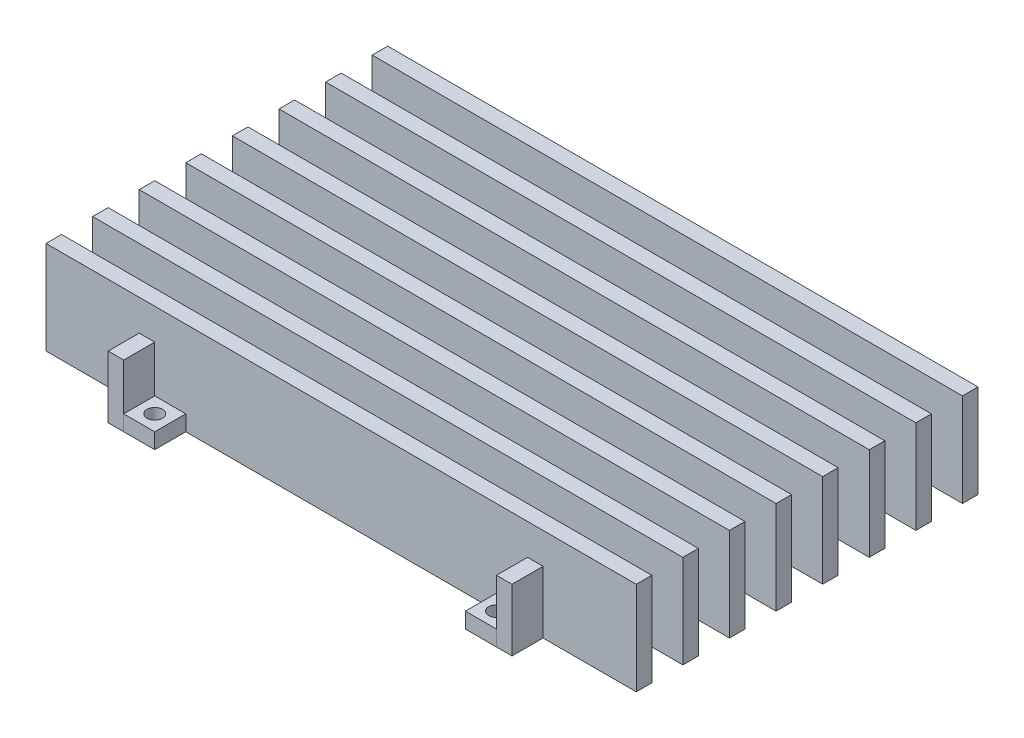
ISO-10303-21;
HEADER;
FILE_DESCRIPTION(('STEP AP214'),'2;1');
FILE_NAME('part.step','',(''),(''),'','','');
FILE_SCHEMA(('AUTOMOTIVE_DESIGN { 1 0 10303 214 1 1 1 1 }'));
ENDSEC;
DATA;
#1=APPLICATION_CONTEXT('core data for automotive mechanical design processes');
#2=APPLICATION_PROTOCOL_DEFINITION('international standard','automotive_design',2000,#1);
#3=PRODUCT_CONTEXT('',#1,'mechanical');
#4=PRODUCT('Part','Part','',(#3));
#5=PRODUCT_RELATED_PRODUCT_CATEGORY('part','',(#4));
#6=PRODUCT_DEFINITION_FORMATION('','',#4);
#7=PRODUCT_DEFINITION_CONTEXT('part definition',#1,'design');
#8=PRODUCT_DEFINITION('design','',#6,#7);
#9=PRODUCT_DEFINITION_SHAPE('','',#8);
#10=(LENGTH_UNIT() NAMED_UNIT(*) SI_UNIT(.MILLI.,.METRE.));
#11=(NAMED_UNIT(*) PLANE_ANGLE_UNIT() SI_UNIT($,.RADIAN.));
#12=(NAMED_UNIT(*) SI_UNIT($,.STERADIAN.) SOLID_ANGLE_UNIT());
#13=UNCERTAINTY_MEASURE_WITH_UNIT(LENGTH_MEASURE(1.E-05),#10,'distance_accuracy_value','');
#14=(GEOMETRIC_REPRESENTATION_CONTEXT(3) GLOBAL_UNCERTAINTY_ASSIGNED_CONTEXT((#13)) GLOBAL_UNIT_ASSIGNED_CONTEXT((#10,
#11,#12)) REPRESENTATION_CONTEXT('',''));
#15=CARTESIAN_POINT('',(0.,0.,0.));
#16=DIRECTION('',(0.,0.,1.));
#17=DIRECTION('',(1.,0.,0.));
#18=AXIS2_PLACEMENT_3D('',#15,#16,#17);
#19=CARTESIAN_POINT('',(38.1,-6.35,34.925));
#20=DIRECTION('',(0.,0.,-1.));
#21=DIRECTION('',(-1.,0.,0.));
#22=AXIS2_PLACEMENT_3D('',#19,#20,#21);
#23=PLANE('',#22);
#24=DIRECTION('',(1.,0.,0.));
#25=VECTOR('',#24,1.);
#26=CARTESIAN_POINT('',(38.1,-9.525,34.925));
#27=LINE('',#26,#25);
#28=CARTESIAN_POINT('',(31.75,-9.525,34.925));
#29=VERTEX_POINT('',#28);
#30=CARTESIAN_POINT('',(38.1,-9.525,34.925));
#31=VERTEX_POINT('',#30);
#32=EDGE_CURVE('E109',#29,#31,#27,.T.);
#33=ORIENTED_EDGE('',*,*,#32,.F.);
#34=DIRECTION('',(0.,-1.,0.));
#35=VECTOR('',#34,1.);
#36=CARTESIAN_POINT('',(31.75,-6.35,34.925));
#37=LINE('',#36,#35);
#38=CARTESIAN_POINT('',(31.75,-6.35,34.925));
#39=VERTEX_POINT('',#38);
#40=EDGE_CURVE('E12',#39,#29,#37,.T.);
#41=ORIENTED_EDGE('',*,*,#40,.F.);
#42=DIRECTION('',(1.,0.,0.));
#43=VECTOR('',#42,1.);
#44=CARTESIAN_POINT('',(38.1,-6.35,34.925));
#45=LINE('',#44,#43);
#46=CARTESIAN_POINT('',(38.1,-6.35,34.925));
#47=VERTEX_POINT('',#46);
#48=EDGE_CURVE('E102',#39,#47,#45,.T.);
#49=ORIENTED_EDGE('',*,*,#48,.T.);
#50=DIRECTION('',(0.,-1.,0.));
#51=VECTOR('',#50,1.);
#52=CARTESIAN_POINT('',(38.1,-6.35,34.925));
#53=LINE('',#52,#51);
#54=EDGE_CURVE('E47',#47,#31,#53,.T.);
#55=ORIENTED_EDGE('',*,*,#54,.T.);
#56=EDGE_LOOP('',(#33,#41,#49,#55));
#57=FACE_BOUND('',#56,.T.);
#58=ADVANCED_FACE('F44',(#57),#23,.T.);
#59=CARTESIAN_POINT('',(31.75,-6.35,34.925));
#60=DIRECTION('',(-1.,0.,0.));
#61=DIRECTION('',(0.,0.,1.));
#62=AXIS2_PLACEMENT_3D('',#59,#60,#61);
#63=PLANE('',#62);
#64=DIRECTION('',(0.,0.,-1.));
#65=VECTOR('',#64,1.);
#66=CARTESIAN_POINT('',(31.75,-9.525,34.925));
#67=LINE('',#66,#65);
#68=CARTESIAN_POINT('',(31.75,-9.525,41.275));
#69=VERTEX_POINT('',#68);
#70=EDGE_CURVE('E104',#69,#29,#67,.T.);
#71=ORIENTED_EDGE('',*,*,#70,.F.);
#72=DIRECTION('',(0.,-1.,0.));
#73=VECTOR('',#72,1.);
#74=CARTESIAN_POINT('',(31.75,-6.35,41.275));
#75=LINE('',#74,#73);
#76=CARTESIAN_POINT('',(31.75,-6.35,41.275));
#77=VERTEX_POINT('',#76);
#78=EDGE_CURVE('E53',#77,#69,#75,.T.);
#79=ORIENTED_EDGE('',*,*,#78,.F.);
#80=DIRECTION('',(0.,0.,-1.));
#81=VECTOR('',#80,1.);
#82=CARTESIAN_POINT('',(31.75,-6.35,34.925));
#83=LINE('',#82,#81);
#84=EDGE_CURVE('E99',#77,#39,#83,.T.);
#85=ORIENTED_EDGE('',*,*,#84,.T.);
#86=ORIENTED_EDGE('',*,*,#40,.T.);
#87=EDGE_LOOP('',(#71,#79,#85,#86));
#88=FACE_BOUND('',#87,.T.);
#89=ADVANCED_FACE('F120',(#88),#63,.T.);
#90=CARTESIAN_POINT('',(38.1,-6.35,41.275));
#91=DIRECTION('',(0.,0.,1.));
#92=DIRECTION('',(1.,0.,0.));
#93=AXIS2_PLACEMENT_3D('',#90,#91,#92);
#94=PLANE('',#93);
#95=DIRECTION('',(-1.,0.,0.));
#96=VECTOR('',#95,1.);
#97=CARTESIAN_POINT('',(38.1,-9.525,41.275));
#98=LINE('',#97,#96);
#99=CARTESIAN_POINT('',(38.1,-9.525,41.275));
#100=VERTEX_POINT('',#99);
#101=EDGE_CURVE('E94',#100,#69,#98,.T.);
#102=ORIENTED_EDGE('',*,*,#101,.F.);
#103=DIRECTION('',(0.,-1.,0.));
#104=VECTOR('',#103,1.);
#105=CARTESIAN_POINT('',(38.1,-6.35,41.275));
#106=LINE('',#105,#104);
#107=CARTESIAN_POINT('',(38.1,-6.35,41.275));
#108=VERTEX_POINT('',#107);
#109=EDGE_CURVE('E89',#108,#100,#106,.T.);
#110=ORIENTED_EDGE('',*,*,#109,.F.);
#111=DIRECTION('',(-1.,0.,0.));
#112=VECTOR('',#111,1.);
#113=CARTESIAN_POINT('',(38.1,-6.35,41.275));
#114=LINE('',#113,#112);
#115=EDGE_CURVE('E92',#108,#77,#114,.T.);
#116=ORIENTED_EDGE('',*,*,#115,.T.);
#117=ORIENTED_EDGE('',*,*,#78,.T.);
#118=EDGE_LOOP('',(#102,#110,#116,#117));
#119=FACE_BOUND('',#118,.T.);
#120=ADVANCED_FACE('F91',(#119),#94,.T.);
#121=CARTESIAN_POINT('',(38.1,-6.35,34.925));
#122=DIRECTION('',(1.,0.,0.));
#123=DIRECTION('',(0.,0.,-1.));
#124=AXIS2_PLACEMENT_3D('',#121,#122,#123);
#125=PLANE('',#124);
#126=DIRECTION('',(0.,0.,1.));
#127=VECTOR('',#126,1.);
#128=CARTESIAN_POINT('',(38.1,-9.525,34.925));
#129=LINE('',#128,#127);
#130=EDGE_CURVE('E112',#31,#100,#129,.T.);
#131=ORIENTED_EDGE('',*,*,#130,.F.);
#132=ORIENTED_EDGE('',*,*,#54,.F.);
#133=DIRECTION('',(0.,0.,1.));
#134=VECTOR('',#133,1.);
#135=CARTESIAN_POINT('',(38.1,-6.35,34.925));
#136=LINE('',#135,#134);
#137=EDGE_CURVE('E98',#47,#108,#136,.T.);
#138=ORIENTED_EDGE('',*,*,#137,.T.);
#139=ORIENTED_EDGE('',*,*,#109,.T.);
#140=EDGE_LOOP('',(#131,#132,#138,#139));
#141=FACE_BOUND('',#140,.T.);
#142=ADVANCED_FACE('F101',(#141),#125,.T.);
#143=CARTESIAN_POINT('',(0.,-6.35,0.));
#144=DIRECTION('',(0.,1.,0.));
#145=DIRECTION('',(0.,0.,1.));
#146=AXIS2_PLACEMENT_3D('',#143,#144,#145);
#147=PLANE('',#146);
#148=CARTESIAN_POINT('',(34.925,-6.35,38.1));
#149=DIRECTION('',(0.,-1.,0.));
#150=DIRECTION('',(0.,0.,1.));
#151=AXIS2_PLACEMENT_3D('',#148,#149,#150);
#152=CIRCLE('',#151,1.5875);
#153=CARTESIAN_POINT('',(34.925,-6.35,39.6875));
#154=VERTEX_POINT('',#153);
#155=EDGE_CURVE('E113',#154,#154,#152,.T.);
#156=ORIENTED_EDGE('',*,*,#155,.T.);
#157=EDGE_LOOP('',(#156));
#158=FACE_BOUND('',#157,.T.);
#159=ORIENTED_EDGE('',*,*,#48,.F.);
#160=ORIENTED_EDGE('',*,*,#84,.F.);
#161=ORIENTED_EDGE('',*,*,#115,.F.);
#162=ORIENTED_EDGE('',*,*,#137,.F.);
#163=EDGE_LOOP('',(#159,#160,#161,#162));
#164=FACE_BOUND('',#163,.T.);
#165=ADVANCED_FACE('F97',(#158,#164),#147,.T.);
#166=CARTESIAN_POINT('',(0.,-9.525,0.));
#167=DIRECTION('',(0.,1.,0.));
#168=DIRECTION('',(0.,0.,1.));
#169=AXIS2_PLACEMENT_3D('',#166,#167,#168);
#170=PLANE('',#169);
#171=CARTESIAN_POINT('',(34.925,-9.525,38.1));
#172=DIRECTION('',(0.,-1.,0.));
#173=DIRECTION('',(0.,0.,1.));
#174=AXIS2_PLACEMENT_3D('',#171,#172,#173);
#175=CIRCLE('',#174,1.5875);
#176=CARTESIAN_POINT('',(34.925,-9.525,39.6875));
#177=VERTEX_POINT('',#176);
#178=EDGE_CURVE('E150',#177,#177,#175,.T.);
#179=ORIENTED_EDGE('',*,*,#178,.F.);
#180=EDGE_LOOP('',(#179));
#181=FACE_BOUND('',#180,.T.);
#182=ORIENTED_EDGE('',*,*,#32,.T.);
#183=ORIENTED_EDGE('',*,*,#130,.T.);
#184=ORIENTED_EDGE('',*,*,#101,.T.);
#185=ORIENTED_EDGE('',*,*,#70,.T.);
#186=EDGE_LOOP('',(#182,#183,#184,#185));
#187=FACE_BOUND('',#186,.T.);
#188=ADVANCED_FACE('F119',(#181,#187),#170,.F.);
#189=CARTESIAN_POINT('',(34.925,-6.35,38.1));
#190=DIRECTION('',(0.,-1.,0.));
#191=DIRECTION('',(0.,0.,-1.));
#192=AXIS2_PLACEMENT_3D('',#189,#190,#191);
#193=CYLINDRICAL_SURFACE('',#192,1.5875);
#194=ORIENTED_EDGE('',*,*,#155,.F.);
#195=EDGE_LOOP('',(#194));
#196=FACE_BOUND('',#195,.T.);
#197=ORIENTED_EDGE('',*,*,#178,.T.);
#198=EDGE_LOOP('',(#197));
#199=FACE_BOUND('',#198,.T.);
#200=ADVANCED_FACE('F138',(#196,#199),#193,.F.);
#201=CLOSED_SHELL('',(#58,#89,#120,#142,#165,#188,#200));
#202=MANIFOLD_SOLID_BREP('B2',#201);
#203=CARTESIAN_POINT('',(-38.1,-6.35,34.925));
#204=DIRECTION('',(-1.,0.,0.));
#205=DIRECTION('',(0.,0.,1.));
#206=AXIS2_PLACEMENT_3D('',#203,#204,#205);
#207=PLANE('',#206);
#208=DIRECTION('',(0.,0.,-1.));
#209=VECTOR('',#208,1.);
#210=CARTESIAN_POINT('',(-38.1,-9.525,34.925));
#211=LINE('',#210,#209);
#212=CARTESIAN_POINT('',(-38.1,-9.525,41.275));
#213=VERTEX_POINT('',#212);
#214=CARTESIAN_POINT('',(-38.1,-9.525,34.925));
#215=VERTEX_POINT('',#214);
#216=EDGE_CURVE('E264',#213,#215,#211,.T.);
#217=ORIENTED_EDGE('',*,*,#216,.F.);
#218=DIRECTION('',(0.,-1.,0.));
#219=VECTOR('',#218,1.);
#220=CARTESIAN_POINT('',(-38.1,-6.35,41.275));
#221=LINE('',#220,#219);
#222=CARTESIAN_POINT('',(-38.1,-6.35,41.275));
#223=VERTEX_POINT('',#222);
#224=EDGE_CURVE('E42',#223,#213,#221,.T.);
#225=ORIENTED_EDGE('',*,*,#224,.F.);
#226=DIRECTION('',(0.,0.,-1.));
#227=VECTOR('',#226,1.);
#228=CARTESIAN_POINT('',(-38.1,-6.35,34.925));
#229=LINE('',#228,#227);
#230=CARTESIAN_POINT('',(-38.1,-6.35,34.925));
#231=VERTEX_POINT('',#230);
#232=EDGE_CURVE('E257',#223,#231,#229,.T.);
#233=ORIENTED_EDGE('',*,*,#232,.T.);
#234=DIRECTION('',(0.,-1.,0.));
#235=VECTOR('',#234,1.);
#236=CARTESIAN_POINT('',(-38.1,-6.35,34.925));
#237=LINE('',#236,#235);
#238=EDGE_CURVE('E202',#231,#215,#237,.T.);
#239=ORIENTED_EDGE('',*,*,#238,.T.);
#240=EDGE_LOOP('',(#217,#225,#233,#239));
#241=FACE_BOUND('',#240,.T.);
#242=ADVANCED_FACE('F199',(#241),#207,.T.);
#243=CARTESIAN_POINT('',(-38.1,-6.35,41.275));
#244=DIRECTION('',(0.,0.,1.));
#245=DIRECTION('',(1.,0.,0.));
#246=AXIS2_PLACEMENT_3D('',#243,#244,#245);
#247=PLANE('',#246);
#248=DIRECTION('',(-1.,0.,0.));
#249=VECTOR('',#248,1.);
#250=CARTESIAN_POINT('',(-38.1,-9.525,41.275));
#251=LINE('',#250,#249);
#252=CARTESIAN_POINT('',(-31.75,-9.525,41.275));
#253=VERTEX_POINT('',#252);
#254=EDGE_CURVE('E259',#253,#213,#251,.T.);
#255=ORIENTED_EDGE('',*,*,#254,.F.);
#256=DIRECTION('',(0.,-1.,0.));
#257=VECTOR('',#256,1.);
#258=CARTESIAN_POINT('',(-31.75,-6.35,41.275));
#259=LINE('',#258,#257);
#260=CARTESIAN_POINT('',(-31.75,-6.35,41.275));
#261=VERTEX_POINT('',#260);
#262=EDGE_CURVE('E208',#261,#253,#259,.T.);
#263=ORIENTED_EDGE('',*,*,#262,.F.);
#264=DIRECTION('',(-1.,0.,0.));
#265=VECTOR('',#264,1.);
#266=CARTESIAN_POINT('',(-38.1,-6.35,41.275));
#267=LINE('',#266,#265);
#268=EDGE_CURVE('E254',#261,#223,#267,.T.);
#269=ORIENTED_EDGE('',*,*,#268,.T.);
#270=ORIENTED_EDGE('',*,*,#224,.T.);
#271=EDGE_LOOP('',(#255,#263,#269,#270));
#272=FACE_BOUND('',#271,.T.);
#273=ADVANCED_FACE('F275',(#272),#247,.T.);
#274=CARTESIAN_POINT('',(-31.75,-6.35,34.925));
#275=DIRECTION('',(1.,0.,0.));
#276=DIRECTION('',(0.,0.,-1.));
#277=AXIS2_PLACEMENT_3D('',#274,#275,#276);
#278=PLANE('',#277);
#279=DIRECTION('',(0.,0.,1.));
#280=VECTOR('',#279,1.);
#281=CARTESIAN_POINT('',(-31.75,-9.525,34.925));
#282=LINE('',#281,#280);
#283=CARTESIAN_POINT('',(-31.75,-9.525,34.925));
#284=VERTEX_POINT('',#283);
#285=EDGE_CURVE('E249',#284,#253,#282,.T.);
#286=ORIENTED_EDGE('',*,*,#285,.F.);
#287=DIRECTION('',(0.,-1.,0.));
#288=VECTOR('',#287,1.);
#289=CARTESIAN_POINT('',(-31.75,-6.35,34.925));
#290=LINE('',#289,#288);
#291=CARTESIAN_POINT('',(-31.75,-6.35,34.925));
#292=VERTEX_POINT('',#291);
#293=EDGE_CURVE('E244',#292,#284,#290,.T.);
#294=ORIENTED_EDGE('',*,*,#293,.F.);
#295=DIRECTION('',(0.,0.,1.));
#296=VECTOR('',#295,1.);
#297=CARTESIAN_POINT('',(-31.75,-6.35,34.925));
#298=LINE('',#297,#296);
#299=EDGE_CURVE('E247',#292,#261,#298,.T.);
#300=ORIENTED_EDGE('',*,*,#299,.T.);
#301=ORIENTED_EDGE('',*,*,#262,.T.);
#302=EDGE_LOOP('',(#286,#294,#300,#301));
#303=FACE_BOUND('',#302,.T.);
#304=ADVANCED_FACE('F246',(#303),#278,.T.);
#305=CARTESIAN_POINT('',(-38.1,-6.35,34.925));
#306=DIRECTION('',(0.,0.,-1.));
#307=DIRECTION('',(-1.,0.,0.));
#308=AXIS2_PLACEMENT_3D('',#305,#306,#307);
#309=PLANE('',#308);
#310=DIRECTION('',(1.,0.,0.));
#311=VECTOR('',#310,1.);
#312=CARTESIAN_POINT('',(-38.1,-9.525,34.925));
#313=LINE('',#312,#311);
#314=EDGE_CURVE('E267',#215,#284,#313,.T.);
#315=ORIENTED_EDGE('',*,*,#314,.F.);
#316=ORIENTED_EDGE('',*,*,#238,.F.);
#317=DIRECTION('',(1.,0.,0.));
#318=VECTOR('',#317,1.);
#319=CARTESIAN_POINT('',(-38.1,-6.35,34.925));
#320=LINE('',#319,#318);
#321=EDGE_CURVE('E253',#231,#292,#320,.T.);
#322=ORIENTED_EDGE('',*,*,#321,.T.);
#323=ORIENTED_EDGE('',*,*,#293,.T.);
#324=EDGE_LOOP('',(#315,#316,#322,#323));
#325=FACE_BOUND('',#324,.T.);
#326=ADVANCED_FACE('F256',(#325),#309,.T.);
#327=CARTESIAN_POINT('',(0.,-6.35,0.));
#328=DIRECTION('',(0.,1.,0.));
#329=DIRECTION('',(0.,0.,1.));
#330=AXIS2_PLACEMENT_3D('',#327,#328,#329);
#331=PLANE('',#330);
#332=CARTESIAN_POINT('',(-34.925,-6.35,38.1));
#333=DIRECTION('',(0.,-1.,0.));
#334=DIRECTION('',(0.,0.,-1.));
#335=AXIS2_PLACEMENT_3D('',#332,#333,#334);
#336=CIRCLE('',#335,1.5875);
#337=CARTESIAN_POINT('',(-34.925,-6.35,36.5125));
#338=VERTEX_POINT('',#337);
#339=EDGE_CURVE('E268',#338,#338,#336,.T.);
#340=ORIENTED_EDGE('',*,*,#339,.T.);
#341=EDGE_LOOP('',(#340));
#342=FACE_BOUND('',#341,.T.);
#343=ORIENTED_EDGE('',*,*,#232,.F.);
#344=ORIENTED_EDGE('',*,*,#268,.F.);
#345=ORIENTED_EDGE('',*,*,#299,.F.);
#346=ORIENTED_EDGE('',*,*,#321,.F.);
#347=EDGE_LOOP('',(#343,#344,#345,#346));
#348=FACE_BOUND('',#347,.T.);
#349=ADVANCED_FACE('F252',(#342,#348),#331,.T.);
#350=CARTESIAN_POINT('',(0.,-9.525,0.));
#351=DIRECTION('',(0.,1.,0.));
#352=DIRECTION('',(0.,0.,1.));
#353=AXIS2_PLACEMENT_3D('',#350,#351,#352);
#354=PLANE('',#353);
#355=CARTESIAN_POINT('',(-34.925,-9.525,38.1));
#356=DIRECTION('',(0.,-1.,0.));
#357=DIRECTION('',(0.,0.,-1.));
#358=AXIS2_PLACEMENT_3D('',#355,#356,#357);
#359=CIRCLE('',#358,1.5875);
#360=CARTESIAN_POINT('',(-34.925,-9.525,36.5125));
#361=VERTEX_POINT('',#360);
#362=EDGE_CURVE('E305',#361,#361,#359,.T.);
#363=ORIENTED_EDGE('',*,*,#362,.F.);
#364=EDGE_LOOP('',(#363));
#365=FACE_BOUND('',#364,.T.);
#366=ORIENTED_EDGE('',*,*,#216,.T.);
#367=ORIENTED_EDGE('',*,*,#314,.T.);
#368=ORIENTED_EDGE('',*,*,#285,.T.);
#369=ORIENTED_EDGE('',*,*,#254,.T.);
#370=EDGE_LOOP('',(#366,#367,#368,#369));
#371=FACE_BOUND('',#370,.T.);
#372=ADVANCED_FACE('F274',(#365,#371),#354,.F.);
#373=CARTESIAN_POINT('',(-34.925,-6.35,38.1));
#374=DIRECTION('',(0.,-1.,0.));
#375=DIRECTION('',(0.,0.,-1.));
#376=AXIS2_PLACEMENT_3D('',#373,#374,#375);
#377=CYLINDRICAL_SURFACE('',#376,1.5875);
#378=ORIENTED_EDGE('',*,*,#339,.F.);
#379=EDGE_LOOP('',(#378));
#380=FACE_BOUND('',#379,.T.);
#381=ORIENTED_EDGE('',*,*,#362,.T.);
#382=EDGE_LOOP('',(#381));
#383=FACE_BOUND('',#382,.T.);
#384=ADVANCED_FACE('F293',(#380,#383),#377,.F.);
#385=CLOSED_SHELL('',(#242,#273,#304,#326,#349,#372,#384));
#386=MANIFOLD_SOLID_BREP('B6',#385);
#387=CARTESIAN_POINT('',(-38.1,-6.35,-34.925));
#388=DIRECTION('',(0.,0.,1.));
#389=DIRECTION('',(1.,0.,0.));
#390=AXIS2_PLACEMENT_3D('',#387,#388,#389);
#391=PLANE('',#390);
#392=DIRECTION('',(-1.,0.,0.));
#393=VECTOR('',#392,1.);
#394=CARTESIAN_POINT('',(-38.1,-9.525,-34.925));
#395=LINE('',#394,#393);
#396=CARTESIAN_POINT('',(-31.75,-9.525,-34.925));
#397=VERTEX_POINT('',#396);
#398=CARTESIAN_POINT('',(-38.1,-9.525,-34.925));
#399=VERTEX_POINT('',#398);
#400=EDGE_CURVE('E419',#397,#399,#395,.T.);
#401=ORIENTED_EDGE('',*,*,#400,.F.);
#402=DIRECTION('',(0.,-1.,0.));
#403=VECTOR('',#402,1.);
#404=CARTESIAN_POINT('',(-31.75,-6.35,-34.925));
#405=LINE('',#404,#403);
#406=CARTESIAN_POINT('',(-31.75,-6.35,-34.925));
#407=VERTEX_POINT('',#406);
#408=EDGE_CURVE('E197',#407,#397,#405,.T.);
#409=ORIENTED_EDGE('',*,*,#408,.F.);
#410=DIRECTION('',(-1.,0.,0.));
#411=VECTOR('',#410,1.);
#412=CARTESIAN_POINT('',(-38.1,-6.35,-34.925));
#413=LINE('',#412,#411);
#414=CARTESIAN_POINT('',(-38.1,-6.35,-34.925));
#415=VERTEX_POINT('',#414);
#416=EDGE_CURVE('E412',#407,#415,#413,.T.);
#417=ORIENTED_EDGE('',*,*,#416,.T.);
#418=DIRECTION('',(0.,-1.,0.));
#419=VECTOR('',#418,1.);
#420=CARTESIAN_POINT('',(-38.1,-6.35,-34.925));
#421=LINE('',#420,#419);
#422=EDGE_CURVE('E357',#415,#399,#421,.T.);
#423=ORIENTED_EDGE('',*,*,#422,.T.);
#424=EDGE_LOOP('',(#401,#409,#417,#423));
#425=FACE_BOUND('',#424,.T.);
#426=ADVANCED_FACE('F354',(#425),#391,.T.);
#427=CARTESIAN_POINT('',(-31.75,-6.35,-34.925));
#428=DIRECTION('',(1.,0.,0.));
#429=DIRECTION('',(0.,0.,-1.));
#430=AXIS2_PLACEMENT_3D('',#427,#428,#429);
#431=PLANE('',#430);
#432=DIRECTION('',(0.,0.,1.));
#433=VECTOR('',#432,1.);
#434=CARTESIAN_POINT('',(-31.75,-9.525,-34.925));
#435=LINE('',#434,#433);
#436=CARTESIAN_POINT('',(-31.75,-9.525,-41.275));
#437=VERTEX_POINT('',#436);
#438=EDGE_CURVE('E414',#437,#397,#435,.T.);
#439=ORIENTED_EDGE('',*,*,#438,.F.);
#440=DIRECTION('',(0.,-1.,0.));
#441=VECTOR('',#440,1.);
#442=CARTESIAN_POINT('',(-31.75,-6.35,-41.275));
#443=LINE('',#442,#441);
#444=CARTESIAN_POINT('',(-31.75,-6.35,-41.275));
#445=VERTEX_POINT('',#444);
#446=EDGE_CURVE('E363',#445,#437,#443,.T.);
#447=ORIENTED_EDGE('',*,*,#446,.F.);
#448=DIRECTION('',(0.,0.,1.));
#449=VECTOR('',#448,1.);
#450=CARTESIAN_POINT('',(-31.75,-6.35,-34.925));
#451=LINE('',#450,#449);
#452=EDGE_CURVE('E409',#445,#407,#451,.T.);
#453=ORIENTED_EDGE('',*,*,#452,.T.);
#454=ORIENTED_EDGE('',*,*,#408,.T.);
#455=EDGE_LOOP('',(#439,#447,#453,#454));
#456=FACE_BOUND('',#455,.T.);
#457=ADVANCED_FACE('F430',(#456),#431,.T.);
#458=CARTESIAN_POINT('',(-38.1,-6.35,-41.275));
#459=DIRECTION('',(0.,0.,-1.));
#460=DIRECTION('',(-1.,0.,0.));
#461=AXIS2_PLACEMENT_3D('',#458,#459,#460);
#462=PLANE('',#461);
#463=DIRECTION('',(1.,0.,0.));
#464=VECTOR('',#463,1.);
#465=CARTESIAN_POINT('',(-38.1,-9.525,-41.275));
#466=LINE('',#465,#464);
#467=CARTESIAN_POINT('',(-38.1,-9.525,-41.275));
#468=VERTEX_POINT('',#467);
#469=EDGE_CURVE('E404',#468,#437,#466,.T.);
#470=ORIENTED_EDGE('',*,*,#469,.F.);
#471=DIRECTION('',(0.,-1.,0.));
#472=VECTOR('',#471,1.);
#473=CARTESIAN_POINT('',(-38.1,-6.35,-41.275));
#474=LINE('',#473,#472);
#475=CARTESIAN_POINT('',(-38.1,-6.35,-41.275));
#476=VERTEX_POINT('',#475);
#477=EDGE_CURVE('E399',#476,#468,#474,.T.);
#478=ORIENTED_EDGE('',*,*,#477,.F.);
#479=DIRECTION('',(1.,0.,0.));
#480=VECTOR('',#479,1.);
#481=CARTESIAN_POINT('',(-38.1,-6.35,-41.275));
#482=LINE('',#481,#480);
#483=EDGE_CURVE('E402',#476,#445,#482,.T.);
#484=ORIENTED_EDGE('',*,*,#483,.T.);
#485=ORIENTED_EDGE('',*,*,#446,.T.);
#486=EDGE_LOOP('',(#470,#478,#484,#485));
#487=FACE_BOUND('',#486,.T.);
#488=ADVANCED_FACE('F401',(#487),#462,.T.);
#489=CARTESIAN_POINT('',(-38.1,-6.35,-34.925));
#490=DIRECTION('',(-1.,0.,0.));
#491=DIRECTION('',(0.,0.,1.));
#492=AXIS2_PLACEMENT_3D('',#489,#490,#491);
#493=PLANE('',#492);
#494=DIRECTION('',(0.,0.,-1.));
#495=VECTOR('',#494,1.);
#496=CARTESIAN_POINT('',(-38.1,-9.525,-34.925));
#497=LINE('',#496,#495);
#498=EDGE_CURVE('E422',#399,#468,#497,.T.);
#499=ORIENTED_EDGE('',*,*,#498,.F.);
#500=ORIENTED_EDGE('',*,*,#422,.F.);
#501=DIRECTION('',(0.,0.,-1.));
#502=VECTOR('',#501,1.);
#503=CARTESIAN_POINT('',(-38.1,-6.35,-34.925));
#504=LINE('',#503,#502);
#505=EDGE_CURVE('E408',#415,#476,#504,.T.);
#506=ORIENTED_EDGE('',*,*,#505,.T.);
#507=ORIENTED_EDGE('',*,*,#477,.T.);
#508=EDGE_LOOP('',(#499,#500,#506,#507));
#509=FACE_BOUND('',#508,.T.);
#510=ADVANCED_FACE('F411',(#509),#493,.T.);
#511=CARTESIAN_POINT('',(0.,-6.35,0.));
#512=DIRECTION('',(0.,1.,0.));
#513=DIRECTION('',(0.,0.,1.));
#514=AXIS2_PLACEMENT_3D('',#511,#512,#513);
#515=PLANE('',#514);
#516=CARTESIAN_POINT('',(-34.925,-6.35,-38.1));
#517=DIRECTION('',(0.,-1.,0.));
#518=DIRECTION('',(0.,0.,1.));
#519=AXIS2_PLACEMENT_3D('',#516,#517,#518);
#520=CIRCLE('',#519,1.5875);
#521=CARTESIAN_POINT('',(-34.925,-6.35,-36.5125));
#522=VERTEX_POINT('',#521);
#523=EDGE_CURVE('E423',#522,#522,#520,.T.);
#524=ORIENTED_EDGE('',*,*,#523,.T.);
#525=EDGE_LOOP('',(#524));
#526=FACE_BOUND('',#525,.T.);
#527=ORIENTED_EDGE('',*,*,#416,.F.);
#528=ORIENTED_EDGE('',*,*,#452,.F.);
#529=ORIENTED_EDGE('',*,*,#483,.F.);
#530=ORIENTED_EDGE('',*,*,#505,.F.);
#531=EDGE_LOOP('',(#527,#528,#529,#530));
#532=FACE_BOUND('',#531,.T.);
#533=ADVANCED_FACE('F407',(#526,#532),#515,.T.);
#534=CARTESIAN_POINT('',(0.,-9.525,0.));
#535=DIRECTION('',(0.,1.,0.));
#536=DIRECTION('',(0.,0.,1.));
#537=AXIS2_PLACEMENT_3D('',#534,#535,#536);
#538=PLANE('',#537);
#539=CARTESIAN_POINT('',(-34.925,-9.525,-38.1));
#540=DIRECTION('',(0.,-1.,0.));
#541=DIRECTION('',(0.,0.,1.));
#542=AXIS2_PLACEMENT_3D('',#539,#540,#541);
#543=CIRCLE('',#542,1.5875);
#544=CARTESIAN_POINT('',(-34.925,-9.525,-36.5125));
#545=VERTEX_POINT('',#544);
#546=EDGE_CURVE('E460',#545,#545,#543,.T.);
#547=ORIENTED_EDGE('',*,*,#546,.F.);
#548=EDGE_LOOP('',(#547));
#549=FACE_BOUND('',#548,.T.);
#550=ORIENTED_EDGE('',*,*,#400,.T.);
#551=ORIENTED_EDGE('',*,*,#498,.T.);
#552=ORIENTED_EDGE('',*,*,#469,.T.);
#553=ORIENTED_EDGE('',*,*,#438,.T.);
#554=EDGE_LOOP('',(#550,#551,#552,#553));
#555=FACE_BOUND('',#554,.T.);
#556=ADVANCED_FACE('F429',(#549,#555),#538,.F.);
#557=CARTESIAN_POINT('',(-34.925,-6.35,-38.1));
#558=DIRECTION('',(0.,-1.,0.));
#559=DIRECTION('',(0.,0.,-1.));
#560=AXIS2_PLACEMENT_3D('',#557,#558,#559);
#561=CYLINDRICAL_SURFACE('',#560,1.5875);
#562=ORIENTED_EDGE('',*,*,#523,.F.);
#563=EDGE_LOOP('',(#562));
#564=FACE_BOUND('',#563,.T.);
#565=ORIENTED_EDGE('',*,*,#546,.T.);
#566=EDGE_LOOP('',(#565));
#567=FACE_BOUND('',#566,.T.);
#568=ADVANCED_FACE('F448',(#564,#567),#561,.F.);
#569=CLOSED_SHELL('',(#426,#457,#488,#510,#533,#556,#568));
#570=MANIFOLD_SOLID_BREP('B36',#569);
#571=CARTESIAN_POINT('',(38.1,-6.35,-34.925));
#572=DIRECTION('',(1.,0.,0.));
#573=DIRECTION('',(0.,0.,-1.));
#574=AXIS2_PLACEMENT_3D('',#571,#572,#573);
#575=PLANE('',#574);
#576=DIRECTION('',(0.,0.,1.));
#577=VECTOR('',#576,1.);
#578=CARTESIAN_POINT('',(38.1,-9.525,-34.925));
#579=LINE('',#578,#577);
#580=CARTESIAN_POINT('',(38.1,-9.525,-41.275));
#581=VERTEX_POINT('',#580);
#582=CARTESIAN_POINT('',(38.1,-9.525,-34.925));
#583=VERTEX_POINT('',#582);
#584=EDGE_CURVE('E573',#581,#583,#579,.T.);
#585=ORIENTED_EDGE('',*,*,#584,.F.);
#586=DIRECTION('',(0.,-1.,0.));
#587=VECTOR('',#586,1.);
#588=CARTESIAN_POINT('',(38.1,-6.35,-41.275));
#589=LINE('',#588,#587);
#590=CARTESIAN_POINT('',(38.1,-6.35,-41.275));
#591=VERTEX_POINT('',#590);
#592=EDGE_CURVE('E352',#591,#581,#589,.T.);
#593=ORIENTED_EDGE('',*,*,#592,.F.);
#594=DIRECTION('',(0.,0.,1.));
#595=VECTOR('',#594,1.);
#596=CARTESIAN_POINT('',(38.1,-6.35,-34.925));
#597=LINE('',#596,#595);
#598=CARTESIAN_POINT('',(38.1,-6.35,-34.925));
#599=VERTEX_POINT('',#598);
#600=EDGE_CURVE('E566',#591,#599,#597,.T.);
#601=ORIENTED_EDGE('',*,*,#600,.T.);
#602=DIRECTION('',(0.,-1.,0.));
#603=VECTOR('',#602,1.);
#604=CARTESIAN_POINT('',(38.1,-6.35,-34.925));
#605=LINE('',#604,#603);
#606=EDGE_CURVE('E511',#599,#583,#605,.T.);
#607=ORIENTED_EDGE('',*,*,#606,.T.);
#608=EDGE_LOOP('',(#585,#593,#601,#607));
#609=FACE_BOUND('',#608,.T.);
#610=ADVANCED_FACE('F508',(#609),#575,.T.);
#611=CARTESIAN_POINT('',(38.1,-6.35,-41.275));
#612=DIRECTION('',(0.,0.,-1.));
#613=DIRECTION('',(-1.,0.,0.));
#614=AXIS2_PLACEMENT_3D('',#611,#612,#613);
#615=PLANE('',#614);
#616=DIRECTION('',(1.,0.,0.));
#617=VECTOR('',#616,1.);
#618=CARTESIAN_POINT('',(38.1,-9.525,-41.275));
#619=LINE('',#618,#617);
#620=CARTESIAN_POINT('',(31.75,-9.525,-41.275));
#621=VERTEX_POINT('',#620);
#622=EDGE_CURVE('E568',#621,#581,#619,.T.);
#623=ORIENTED_EDGE('',*,*,#622,.F.);
#624=DIRECTION('',(0.,-1.,0.));
#625=VECTOR('',#624,1.);
#626=CARTESIAN_POINT('',(31.75,-6.35,-41.275));
#627=LINE('',#626,#625);
#628=CARTESIAN_POINT('',(31.75,-6.35,-41.275));
#629=VERTEX_POINT('',#628);
#630=EDGE_CURVE('E517',#629,#621,#627,.T.);
#631=ORIENTED_EDGE('',*,*,#630,.F.);
#632=DIRECTION('',(1.,0.,0.));
#633=VECTOR('',#632,1.);
#634=CARTESIAN_POINT('',(38.1,-6.35,-41.275));
#635=LINE('',#634,#633);
#636=EDGE_CURVE('E563',#629,#591,#635,.T.);
#637=ORIENTED_EDGE('',*,*,#636,.T.);
#638=ORIENTED_EDGE('',*,*,#592,.T.);
#639=EDGE_LOOP('',(#623,#631,#637,#638));
#640=FACE_BOUND('',#639,.T.);
#641=ADVANCED_FACE('F584',(#640),#615,.T.);
#642=CARTESIAN_POINT('',(31.75,-6.35,-34.925));
#643=DIRECTION('',(-1.,0.,0.));
#644=DIRECTION('',(0.,0.,1.));
#645=AXIS2_PLACEMENT_3D('',#642,#643,#644);
#646=PLANE('',#645);
#647=DIRECTION('',(0.,0.,-1.));
#648=VECTOR('',#647,1.);
#649=CARTESIAN_POINT('',(31.75,-9.525,-34.925));
#650=LINE('',#649,#648);
#651=CARTESIAN_POINT('',(31.75,-9.525,-34.925));
#652=VERTEX_POINT('',#651);
#653=EDGE_CURVE('E558',#652,#621,#650,.T.);
#654=ORIENTED_EDGE('',*,*,#653,.F.);
#655=DIRECTION('',(0.,-1.,0.));
#656=VECTOR('',#655,1.);
#657=CARTESIAN_POINT('',(31.75,-6.35,-34.925));
#658=LINE('',#657,#656);
#659=CARTESIAN_POINT('',(31.75,-6.35,-34.925));
#660=VERTEX_POINT('',#659);
#661=EDGE_CURVE('E553',#660,#652,#658,.T.);
#662=ORIENTED_EDGE('',*,*,#661,.F.);
#663=DIRECTION('',(0.,0.,-1.));
#664=VECTOR('',#663,1.);
#665=CARTESIAN_POINT('',(31.75,-6.35,-34.925));
#666=LINE('',#665,#664);
#667=EDGE_CURVE('E556',#660,#629,#666,.T.);
#668=ORIENTED_EDGE('',*,*,#667,.T.);
#669=ORIENTED_EDGE('',*,*,#630,.T.);
#670=EDGE_LOOP('',(#654,#662,#668,#669));
#671=FACE_BOUND('',#670,.T.);
#672=ADVANCED_FACE('F555',(#671),#646,.T.);
#673=CARTESIAN_POINT('',(38.1,-6.35,-34.925));
#674=DIRECTION('',(0.,0.,1.));
#675=DIRECTION('',(1.,0.,0.));
#676=AXIS2_PLACEMENT_3D('',#673,#674,#675);
#677=PLANE('',#676);
#678=DIRECTION('',(-1.,0.,0.));
#679=VECTOR('',#678,1.);
#680=CARTESIAN_POINT('',(38.1,-9.525,-34.925));
#681=LINE('',#680,#679);
#682=EDGE_CURVE('E576',#583,#652,#681,.T.);
#683=ORIENTED_EDGE('',*,*,#682,.F.);
#684=ORIENTED_EDGE('',*,*,#606,.F.);
#685=DIRECTION('',(-1.,0.,0.));
#686=VECTOR('',#685,1.);
#687=CARTESIAN_POINT('',(38.1,-6.35,-34.925));
#688=LINE('',#687,#686);
#689=EDGE_CURVE('E562',#599,#660,#688,.T.);
#690=ORIENTED_EDGE('',*,*,#689,.T.);
#691=ORIENTED_EDGE('',*,*,#661,.T.);
#692=EDGE_LOOP('',(#683,#684,#690,#691));
#693=FACE_BOUND('',#692,.T.);
#694=ADVANCED_FACE('F565',(#693),#677,.T.);
#695=CARTESIAN_POINT('',(0.,-6.35,0.));
#696=DIRECTION('',(0.,1.,0.));
#697=DIRECTION('',(0.,0.,1.));
#698=AXIS2_PLACEMENT_3D('',#695,#696,#697);
#699=PLANE('',#698);
#700=CARTESIAN_POINT('',(34.925,-6.35,-38.1));
#701=DIRECTION('',(0.,-1.,0.));
#702=DIRECTION('',(0.,0.,-1.));
#703=AXIS2_PLACEMENT_3D('',#700,#701,#702);
#704=CIRCLE('',#703,1.5875);
#705=CARTESIAN_POINT('',(34.925,-6.35,-39.6875));
#706=VERTEX_POINT('',#705);
#707=EDGE_CURVE('E577',#706,#706,#704,.T.);
#708=ORIENTED_EDGE('',*,*,#707,.T.);
#709=EDGE_LOOP('',(#708));
#710=FACE_BOUND('',#709,.T.);
#711=ORIENTED_EDGE('',*,*,#600,.F.);
#712=ORIENTED_EDGE('',*,*,#636,.F.);
#713=ORIENTED_EDGE('',*,*,#667,.F.);
#714=ORIENTED_EDGE('',*,*,#689,.F.);
#715=EDGE_LOOP('',(#711,#712,#713,#714));
#716=FACE_BOUND('',#715,.T.);
#717=ADVANCED_FACE('F561',(#710,#716),#699,.T.);
#718=CARTESIAN_POINT('',(0.,-9.525,0.));
#719=DIRECTION('',(0.,1.,0.));
#720=DIRECTION('',(0.,0.,1.));
#721=AXIS2_PLACEMENT_3D('',#718,#719,#720);
#722=PLANE('',#721);
#723=CARTESIAN_POINT('',(34.925,-9.525,-38.1));
#724=DIRECTION('',(0.,-1.,0.));
#725=DIRECTION('',(0.,0.,-1.));
#726=AXIS2_PLACEMENT_3D('',#723,#724,#725);
#727=CIRCLE('',#726,1.5875);
#728=CARTESIAN_POINT('',(34.925,-9.525,-39.6875));
#729=VERTEX_POINT('',#728);
#730=EDGE_CURVE('E614',#729,#729,#727,.T.);
#731=ORIENTED_EDGE('',*,*,#730,.F.);
#732=EDGE_LOOP('',(#731));
#733=FACE_BOUND('',#732,.T.);
#734=ORIENTED_EDGE('',*,*,#584,.T.);
#735=ORIENTED_EDGE('',*,*,#682,.T.);
#736=ORIENTED_EDGE('',*,*,#653,.T.);
#737=ORIENTED_EDGE('',*,*,#622,.T.);
#738=EDGE_LOOP('',(#734,#735,#736,#737));
#739=FACE_BOUND('',#738,.T.);
#740=ADVANCED_FACE('F583',(#733,#739),#722,.F.);
#741=CARTESIAN_POINT('',(34.925,-6.35,-38.1));
#742=DIRECTION('',(0.,-1.,0.));
#743=DIRECTION('',(0.,0.,-1.));
#744=AXIS2_PLACEMENT_3D('',#741,#742,#743);
#745=CYLINDRICAL_SURFACE('',#744,1.5875);
#746=ORIENTED_EDGE('',*,*,#707,.F.);
#747=EDGE_LOOP('',(#746));
#748=FACE_BOUND('',#747,.T.);
#749=ORIENTED_EDGE('',*,*,#730,.T.);
#750=EDGE_LOOP('',(#749));
#751=FACE_BOUND('',#750,.T.);
#752=ADVANCED_FACE('F602',(#748,#751),#745,.F.);
#753=CLOSED_SHELL('',(#610,#641,#672,#694,#717,#740,#752));
#754=MANIFOLD_SOLID_BREP('B191',#753);
#755=CARTESIAN_POINT('',(0.,3.175,0.));
#756=DIRECTION('',(0.,-1.,0.));
#757=DIRECTION('',(0.,0.,-1.));
#758=AXIS2_PLACEMENT_3D('',#755,#756,#757);
#759=PLANE('',#758);
#760=DIRECTION('',(1.,0.,0.));
#761=VECTOR('',#760,1.);
#762=CARTESIAN_POINT('',(0.,3.175,-31.75));
#763=LINE('',#762,#761);
#764=CARTESIAN_POINT('',(-41.275,3.175,-31.75));
#765=VERTEX_POINT('',#764);
#766=CARTESIAN_POINT('',(-38.1,3.175,-31.75));
#767=VERTEX_POINT('',#766);
#768=EDGE_CURVE('E1508',#765,#767,#763,.T.);
#769=ORIENTED_EDGE('',*,*,#768,.F.);
#770=DIRECTION('',(0.,0.,-1.));
#771=VECTOR('',#770,1.);
#772=CARTESIAN_POINT('',(-41.275,3.175,-41.275));
#773=LINE('',#772,#771);
#774=CARTESIAN_POINT('',(-41.275,3.175,-25.4));
#775=VERTEX_POINT('',#774);
#776=EDGE_CURVE('E2046',#775,#765,#773,.T.);
#777=ORIENTED_EDGE('',*,*,#776,.F.);
#778=DIRECTION('',(-1.,0.,0.));
#779=VECTOR('',#778,1.);
#780=CARTESIAN_POINT('',(0.,3.175,-25.4));
#781=LINE('',#780,#779);
#782=CARTESIAN_POINT('',(-38.1,3.175,-25.4));
#783=VERTEX_POINT('',#782);
#784=EDGE_CURVE('E1549',#783,#775,#781,.T.);
#785=ORIENTED_EDGE('',*,*,#784,.F.);
#786=DIRECTION('',(0.,0.,1.));
#787=VECTOR('',#786,1.);
#788=CARTESIAN_POINT('',(-38.1,3.175,-41.275));
#789=LINE('',#788,#787);
#790=EDGE_CURVE('E1815',#767,#783,#789,.T.);
#791=ORIENTED_EDGE('',*,*,#790,.F.);
#792=EDGE_LOOP('',(#769,#777,#785,#791));
#793=FACE_BOUND('',#792,.T.);
#794=ADVANCED_FACE('F652',(#793),#759,.F.);
#795=DIRECTION('',(-1.,0.,0.));
#796=VECTOR('',#795,1.);
#797=CARTESIAN_POINT('',(0.,3.175,-34.925));
#798=LINE('',#797,#796);
#799=CARTESIAN_POINT('',(-38.1,3.175,-34.925));
#800=VERTEX_POINT('',#799);
#801=CARTESIAN_POINT('',(-41.275,3.175,-34.925));
#802=VERTEX_POINT('',#801);
#803=EDGE_CURVE('E1500',#800,#802,#798,.T.);
#804=ORIENTED_EDGE('',*,*,#803,.F.);
#805=CARTESIAN_POINT('',(-38.1,3.175,-41.275));
#806=VERTEX_POINT('',#805);
#807=EDGE_CURVE('E1811',#806,#800,#789,.T.);
#808=ORIENTED_EDGE('',*,*,#807,.F.);
#809=DIRECTION('',(1.,0.,0.));
#810=VECTOR('',#809,1.);
#811=CARTESIAN_POINT('',(-38.1,3.175,-41.275));
#812=LINE('',#811,#810);
#813=CARTESIAN_POINT('',(-41.275,3.175,-41.275));
#814=VERTEX_POINT('',#813);
#815=EDGE_CURVE('E1805',#814,#806,#812,.T.);
#816=ORIENTED_EDGE('',*,*,#815,.F.);
#817=EDGE_CURVE('E1807',#802,#814,#773,.T.);
#818=ORIENTED_EDGE('',*,*,#817,.F.);
#819=EDGE_LOOP('',(#804,#808,#816,#818));
#820=FACE_BOUND('',#819,.T.);
#821=ADVANCED_FACE('F2045',(#820),#759,.F.);
#822=CARTESIAN_POINT('',(-41.275,3.175,-41.275));
#823=DIRECTION('',(-1.,0.,0.));
#824=DIRECTION('',(0.,0.,1.));
#825=AXIS2_PLACEMENT_3D('',#822,#823,#824);
#826=PLANE('',#825);
#827=ORIENTED_EDGE('',*,*,#776,.T.);
#828=DIRECTION('',(0.,-1.,0.));
#829=VECTOR('',#828,1.);
#830=CARTESIAN_POINT('',(-41.275,3.175,-31.75));
#831=LINE('',#830,#829);
#832=CARTESIAN_POINT('',(-41.275,-9.525,-31.75));
#833=VERTEX_POINT('',#832);
#834=EDGE_CURVE('E1510',#765,#833,#831,.T.);
#835=ORIENTED_EDGE('',*,*,#834,.T.);
#836=DIRECTION('',(0.,0.,-1.));
#837=VECTOR('',#836,1.);
#838=CARTESIAN_POINT('',(-41.275,-9.525,-41.275));
#839=LINE('',#838,#837);
#840=CARTESIAN_POINT('',(-41.275,-9.525,-25.4));
#841=VERTEX_POINT('',#840);
#842=EDGE_CURVE('E2024',#841,#833,#839,.T.);
#843=ORIENTED_EDGE('',*,*,#842,.F.);
#844=DIRECTION('',(0.,1.,0.));
#845=VECTOR('',#844,1.);
#846=CARTESIAN_POINT('',(-41.275,3.175,-25.4));
#847=LINE('',#846,#845);
#848=EDGE_CURVE('E1551',#841,#775,#847,.T.);
#849=ORIENTED_EDGE('',*,*,#848,.T.);
#850=EDGE_LOOP('',(#827,#835,#843,#849));
#851=FACE_BOUND('',#850,.T.);
#852=ADVANCED_FACE('F2240',(#851),#826,.T.);
#853=CARTESIAN_POINT('',(-41.275,-9.525,-34.925));
#854=VERTEX_POINT('',#853);
#855=CARTESIAN_POINT('',(-41.275,-9.525,-41.275));
#856=VERTEX_POINT('',#855);
#857=EDGE_CURVE('E1801',#854,#856,#839,.T.);
#858=ORIENTED_EDGE('',*,*,#857,.F.);
#859=DIRECTION('',(0.,1.,0.));
#860=VECTOR('',#859,1.);
#861=CARTESIAN_POINT('',(-41.275,3.175,-34.925));
#862=LINE('',#861,#860);
#863=EDGE_CURVE('E1502',#854,#802,#862,.T.);
#864=ORIENTED_EDGE('',*,*,#863,.T.);
#865=ORIENTED_EDGE('',*,*,#817,.T.);
#866=DIRECTION('',(0.,-1.,0.));
#867=VECTOR('',#866,1.);
#868=CARTESIAN_POINT('',(-41.275,3.175,-41.275));
#869=LINE('',#868,#867);
#870=EDGE_CURVE('E1818',#814,#856,#869,.T.);
#871=ORIENTED_EDGE('',*,*,#870,.T.);
#872=EDGE_LOOP('',(#858,#864,#865,#871));
#873=FACE_BOUND('',#872,.T.);
#874=ADVANCED_FACE('F2034',(#873),#826,.T.);
#875=CARTESIAN_POINT('',(-38.1,3.175,-41.275));
#876=DIRECTION('',(1.,0.,0.));
#877=DIRECTION('',(0.,0.,-1.));
#878=AXIS2_PLACEMENT_3D('',#875,#876,#877);
#879=PLANE('',#878);
#880=DIRECTION('',(0.,0.,1.));
#881=VECTOR('',#880,1.);
#882=CARTESIAN_POINT('',(-38.1,-9.525,-41.275));
#883=LINE('',#882,#881);
#884=CARTESIAN_POINT('',(-38.1,-9.525,-31.75));
#885=VERTEX_POINT('',#884);
#886=CARTESIAN_POINT('',(-38.1,-9.525,-25.4));
#887=VERTEX_POINT('',#886);
#888=EDGE_CURVE('E1831',#885,#887,#883,.T.);
#889=ORIENTED_EDGE('',*,*,#888,.F.);
#890=DIRECTION('',(0.,1.,0.));
#891=VECTOR('',#890,1.);
#892=CARTESIAN_POINT('',(-38.1,3.175,-31.75));
#893=LINE('',#892,#891);
#894=EDGE_CURVE('E1505',#885,#767,#893,.T.);
#895=ORIENTED_EDGE('',*,*,#894,.T.);
#896=ORIENTED_EDGE('',*,*,#790,.T.);
#897=DIRECTION('',(0.,-1.,0.));
#898=VECTOR('',#897,1.);
#899=CARTESIAN_POINT('',(-38.1,3.175,-25.4));
#900=LINE('',#899,#898);
#901=EDGE_CURVE('E1546',#783,#887,#900,.T.);
#902=ORIENTED_EDGE('',*,*,#901,.T.);
#903=EDGE_LOOP('',(#889,#895,#896,#902));
#904=FACE_BOUND('',#903,.T.);
#905=ADVANCED_FACE('F2299',(#904),#879,.T.);
#906=ORIENTED_EDGE('',*,*,#807,.T.);
#907=DIRECTION('',(0.,-1.,0.));
#908=VECTOR('',#907,1.);
#909=CARTESIAN_POINT('',(-38.1,3.175,-34.925));
#910=LINE('',#909,#908);
#911=CARTESIAN_POINT('',(-38.1,-9.525,-34.925));
#912=VERTEX_POINT('',#911);
#913=EDGE_CURVE('E1497',#800,#912,#910,.T.);
#914=ORIENTED_EDGE('',*,*,#913,.T.);
#915=CARTESIAN_POINT('',(-38.1,-9.525,-41.275));
#916=VERTEX_POINT('',#915);
#917=EDGE_CURVE('E1827',#916,#912,#883,.T.);
#918=ORIENTED_EDGE('',*,*,#917,.F.);
#919=DIRECTION('',(0.,-1.,0.));
#920=VECTOR('',#919,1.);
#921=CARTESIAN_POINT('',(-38.1,3.175,-41.275));
#922=LINE('',#921,#920);
#923=EDGE_CURVE('E1840',#806,#916,#922,.T.);
#924=ORIENTED_EDGE('',*,*,#923,.F.);
#925=EDGE_LOOP('',(#906,#914,#918,#924));
#926=FACE_BOUND('',#925,.T.);
#927=ADVANCED_FACE('F2042',(#926),#879,.T.);
#928=DIRECTION('',(1.,0.,0.));
#929=VECTOR('',#928,1.);
#930=CARTESIAN_POINT('',(0.,3.175,-22.225));
#931=LINE('',#930,#929);
#932=CARTESIAN_POINT('',(-41.275,3.175,-22.225));
#933=VERTEX_POINT('',#932);
#934=CARTESIAN_POINT('',(-38.1,3.175,-22.225));
#935=VERTEX_POINT('',#934);
#936=EDGE_CURVE('E1557',#933,#935,#931,.T.);
#937=ORIENTED_EDGE('',*,*,#936,.F.);
#938=CARTESIAN_POINT('',(-41.275,3.175,-15.875));
#939=VERTEX_POINT('',#938);
#940=EDGE_CURVE('E2048',#939,#933,#773,.T.);
#941=ORIENTED_EDGE('',*,*,#940,.F.);
#942=DIRECTION('',(-1.,0.,0.));
#943=VECTOR('',#942,1.);
#944=CARTESIAN_POINT('',(0.,3.175,-15.875));
#945=LINE('',#944,#943);
#946=CARTESIAN_POINT('',(-38.1,3.175,-15.875));
#947=VERTEX_POINT('',#946);
#948=EDGE_CURVE('E1598',#947,#939,#945,.T.);
#949=ORIENTED_EDGE('',*,*,#948,.F.);
#950=EDGE_CURVE('E2151',#935,#947,#789,.T.);
#951=ORIENTED_EDGE('',*,*,#950,.F.);
#952=EDGE_LOOP('',(#937,#941,#949,#951));
#953=FACE_BOUND('',#952,.T.);
#954=ADVANCED_FACE('F2241',(#953),#759,.F.);
#955=ORIENTED_EDGE('',*,*,#940,.T.);
#956=DIRECTION('',(0.,-1.,0.));
#957=VECTOR('',#956,1.);
#958=CARTESIAN_POINT('',(-41.275,3.175,-22.225));
#959=LINE('',#958,#957);
#960=CARTESIAN_POINT('',(-41.275,-9.525,-22.225));
#961=VERTEX_POINT('',#960);
#962=EDGE_CURVE('E1559',#933,#961,#959,.T.);
#963=ORIENTED_EDGE('',*,*,#962,.T.);
#964=CARTESIAN_POINT('',(-41.275,-9.525,-15.875));
#965=VERTEX_POINT('',#964);
#966=EDGE_CURVE('E2027',#965,#961,#839,.T.);
#967=ORIENTED_EDGE('',*,*,#966,.F.);
#968=DIRECTION('',(0.,1.,0.));
#969=VECTOR('',#968,1.);
#970=CARTESIAN_POINT('',(-41.275,3.175,-15.875));
#971=LINE('',#970,#969);
#972=EDGE_CURVE('E1600',#965,#939,#971,.T.);
#973=ORIENTED_EDGE('',*,*,#972,.T.);
#974=EDGE_LOOP('',(#955,#963,#967,#973));
#975=FACE_BOUND('',#974,.T.);
#976=ADVANCED_FACE('F2291',(#975),#826,.T.);
#977=CARTESIAN_POINT('',(-38.1,-9.525,-22.225));
#978=VERTEX_POINT('',#977);
#979=CARTESIAN_POINT('',(-38.1,-9.525,-15.875));
#980=VERTEX_POINT('',#979);
#981=EDGE_CURVE('E2309',#978,#980,#883,.T.);
#982=ORIENTED_EDGE('',*,*,#981,.F.);
#983=DIRECTION('',(0.,1.,0.));
#984=VECTOR('',#983,1.);
#985=CARTESIAN_POINT('',(-38.1,3.175,-22.225));
#986=LINE('',#985,#984);
#987=EDGE_CURVE('E1554',#978,#935,#986,.T.);
#988=ORIENTED_EDGE('',*,*,#987,.T.);
#989=ORIENTED_EDGE('',*,*,#950,.T.);
#990=DIRECTION('',(0.,-1.,0.));
#991=VECTOR('',#990,1.);
#992=CARTESIAN_POINT('',(-38.1,3.175,-15.875));
#993=LINE('',#992,#991);
#994=EDGE_CURVE('E1595',#947,#980,#993,.T.);
#995=ORIENTED_EDGE('',*,*,#994,.T.);
#996=EDGE_LOOP('',(#982,#988,#989,#995));
#997=FACE_BOUND('',#996,.T.);
#998=ADVANCED_FACE('F2284',(#997),#879,.T.);
#999=DIRECTION('',(1.,0.,0.));
#1000=VECTOR('',#999,1.);
#1001=CARTESIAN_POINT('',(0.,3.175,-12.7));
#1002=LINE('',#1001,#1000);
#1003=CARTESIAN_POINT('',(-41.275,3.175,-12.7));
#1004=VERTEX_POINT('',#1003);
#1005=CARTESIAN_POINT('',(-38.1,3.175,-12.7));
#1006=VERTEX_POINT('',#1005);
#1007=EDGE_CURVE('E1606',#1004,#1006,#1002,.T.);
#1008=ORIENTED_EDGE('',*,*,#1007,.F.);
#1009=CARTESIAN_POINT('',(-41.275,3.175,-6.34999999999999));
#1010=VERTEX_POINT('',#1009);
#1011=EDGE_CURVE('E2051',#1010,#1004,#773,.T.);
#1012=ORIENTED_EDGE('',*,*,#1011,.F.);
#1013=DIRECTION('',(-1.,0.,0.));
#1014=VECTOR('',#1013,1.);
#1015=CARTESIAN_POINT('',(0.,3.175,-6.34999999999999));
#1016=LINE('',#1015,#1014);
#1017=CARTESIAN_POINT('',(-38.1,3.175,-6.34999999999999));
#1018=VERTEX_POINT('',#1017);
#1019=EDGE_CURVE('E1647',#1018,#1010,#1016,.T.);
#1020=ORIENTED_EDGE('',*,*,#1019,.F.);
#1021=EDGE_CURVE('E2148',#1006,#1018,#789,.T.);
#1022=ORIENTED_EDGE('',*,*,#1021,.F.);
#1023=EDGE_LOOP('',(#1008,#1012,#1020,#1022));
#1024=FACE_BOUND('',#1023,.T.);
#1025=ADVANCED_FACE('F2146',(#1024),#759,.F.);
#1026=ORIENTED_EDGE('',*,*,#1011,.T.);
#1027=DIRECTION('',(0.,-1.,0.));
#1028=VECTOR('',#1027,1.);
#1029=CARTESIAN_POINT('',(-41.275,3.175,-12.7));
#1030=LINE('',#1029,#1028);
#1031=CARTESIAN_POINT('',(-41.275,-9.525,-12.7));
#1032=VERTEX_POINT('',#1031);
#1033=EDGE_CURVE('E1608',#1004,#1032,#1030,.T.);
#1034=ORIENTED_EDGE('',*,*,#1033,.T.);
#1035=CARTESIAN_POINT('',(-41.275,-9.525,-6.34999999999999));
#1036=VERTEX_POINT('',#1035);
#1037=EDGE_CURVE('E2029',#1036,#1032,#839,.T.);
#1038=ORIENTED_EDGE('',*,*,#1037,.F.);
#1039=DIRECTION('',(0.,1.,0.));
#1040=VECTOR('',#1039,1.);
#1041=CARTESIAN_POINT('',(-41.275,3.175,-6.34999999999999));
#1042=LINE('',#1041,#1040);
#1043=EDGE_CURVE('E1649',#1036,#1010,#1042,.T.);
#1044=ORIENTED_EDGE('',*,*,#1043,.T.);
#1045=EDGE_LOOP('',(#1026,#1034,#1038,#1044));
#1046=FACE_BOUND('',#1045,.T.);
#1047=ADVANCED_FACE('F2139',(#1046),#826,.T.);
#1048=CARTESIAN_POINT('',(-38.1,-9.525,-12.7));
#1049=VERTEX_POINT('',#1048);
#1050=CARTESIAN_POINT('',(-38.1,-9.525,-6.34999999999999));
#1051=VERTEX_POINT('',#1050);
#1052=EDGE_CURVE('E2310',#1049,#1051,#883,.T.);
#1053=ORIENTED_EDGE('',*,*,#1052,.F.);
#1054=DIRECTION('',(0.,1.,0.));
#1055=VECTOR('',#1054,1.);
#1056=CARTESIAN_POINT('',(-38.1,3.175,-12.7));
#1057=LINE('',#1056,#1055);
#1058=EDGE_CURVE('E1603',#1049,#1006,#1057,.T.);
#1059=ORIENTED_EDGE('',*,*,#1058,.T.);
#1060=ORIENTED_EDGE('',*,*,#1021,.T.);
#1061=DIRECTION('',(0.,-1.,0.));
#1062=VECTOR('',#1061,1.);
#1063=CARTESIAN_POINT('',(-38.1,3.175,-6.34999999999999));
#1064=LINE('',#1063,#1062);
#1065=EDGE_CURVE('E1644',#1018,#1051,#1064,.T.);
#1066=ORIENTED_EDGE('',*,*,#1065,.T.);
#1067=EDGE_LOOP('',(#1053,#1059,#1060,#1066));
#1068=FACE_BOUND('',#1067,.T.);
#1069=ADVANCED_FACE('F2276',(#1068),#879,.T.);
#1070=DIRECTION('',(1.,0.,0.));
#1071=VECTOR('',#1070,1.);
#1072=CARTESIAN_POINT('',(0.,3.175,-3.175));
#1073=LINE('',#1072,#1071);
#1074=CARTESIAN_POINT('',(-41.275,3.175,-3.175));
#1075=VERTEX_POINT('',#1074);
#1076=CARTESIAN_POINT('',(-38.1,3.175,-3.175));
#1077=VERTEX_POINT('',#1076);
#1078=EDGE_CURVE('E1655',#1075,#1077,#1073,.T.);
#1079=ORIENTED_EDGE('',*,*,#1078,.F.);
#1080=CARTESIAN_POINT('',(-41.275,3.175,3.175));
#1081=VERTEX_POINT('',#1080);
#1082=EDGE_CURVE('E2055',#1081,#1075,#773,.T.);
#1083=ORIENTED_EDGE('',*,*,#1082,.F.);
#1084=DIRECTION('',(-1.,0.,0.));
#1085=VECTOR('',#1084,1.);
#1086=CARTESIAN_POINT('',(0.,3.175,3.175));
#1087=LINE('',#1086,#1085);
#1088=CARTESIAN_POINT('',(-38.1,3.175,3.175));
#1089=VERTEX_POINT('',#1088);
#1090=EDGE_CURVE('E1696',#1089,#1081,#1087,.T.);
#1091=ORIENTED_EDGE('',*,*,#1090,.F.);
#1092=EDGE_CURVE('E2152',#1077,#1089,#789,.T.);
#1093=ORIENTED_EDGE('',*,*,#1092,.F.);
#1094=EDGE_LOOP('',(#1079,#1083,#1091,#1093));
#1095=FACE_BOUND('',#1094,.T.);
#1096=ADVANCED_FACE('F2270',(#1095),#759,.F.);
#1097=ORIENTED_EDGE('',*,*,#1082,.T.);
#1098=DIRECTION('',(0.,-1.,0.));
#1099=VECTOR('',#1098,1.);
#1100=CARTESIAN_POINT('',(-41.275,3.175,-3.175));
#1101=LINE('',#1100,#1099);
#1102=CARTESIAN_POINT('',(-41.275,-9.525,-3.175));
#1103=VERTEX_POINT('',#1102);
#1104=EDGE_CURVE('E1657',#1075,#1103,#1101,.T.);
#1105=ORIENTED_EDGE('',*,*,#1104,.T.);
#1106=CARTESIAN_POINT('',(-41.275,-9.525,3.175));
#1107=VERTEX_POINT('',#1106);
#1108=EDGE_CURVE('E2125',#1107,#1103,#839,.T.);
#1109=ORIENTED_EDGE('',*,*,#1108,.F.);
#1110=DIRECTION('',(0.,1.,0.));
#1111=VECTOR('',#1110,1.);
#1112=CARTESIAN_POINT('',(-41.275,3.175,3.175));
#1113=LINE('',#1112,#1111);
#1114=EDGE_CURVE('E1698',#1107,#1081,#1113,.T.);
#1115=ORIENTED_EDGE('',*,*,#1114,.T.);
#1116=EDGE_LOOP('',(#1097,#1105,#1109,#1115));
#1117=FACE_BOUND('',#1116,.T.);
#1118=ADVANCED_FACE('F2275',(#1117),#826,.T.);
#1119=CARTESIAN_POINT('',(-38.1,-9.525,-3.175));
#1120=VERTEX_POINT('',#1119);
#1121=CARTESIAN_POINT('',(-38.1,-9.525,3.175));
#1122=VERTEX_POINT('',#1121);
#1123=EDGE_CURVE('E2312',#1120,#1122,#883,.T.);
#1124=ORIENTED_EDGE('',*,*,#1123,.F.);
#1125=DIRECTION('',(0.,1.,0.));
#1126=VECTOR('',#1125,1.);
#1127=CARTESIAN_POINT('',(-38.1,3.175,-3.175));
#1128=LINE('',#1127,#1126);
#1129=EDGE_CURVE('E1652',#1120,#1077,#1128,.T.);
#1130=ORIENTED_EDGE('',*,*,#1129,.T.);
#1131=ORIENTED_EDGE('',*,*,#1092,.T.);
#1132=DIRECTION('',(0.,-1.,0.));
#1133=VECTOR('',#1132,1.);
#1134=CARTESIAN_POINT('',(-38.1,3.175,3.175));
#1135=LINE('',#1134,#1133);
#1136=EDGE_CURVE('E1693',#1089,#1122,#1135,.T.);
#1137=ORIENTED_EDGE('',*,*,#1136,.T.);
#1138=EDGE_LOOP('',(#1124,#1130,#1131,#1137));
#1139=FACE_BOUND('',#1138,.T.);
#1140=ADVANCED_FACE('F2267',(#1139),#879,.T.);
#1141=DIRECTION('',(1.,0.,0.));
#1142=VECTOR('',#1141,1.);
#1143=CARTESIAN_POINT('',(0.,3.175,6.35));
#1144=LINE('',#1143,#1142);
#1145=CARTESIAN_POINT('',(-41.275,3.175,6.35));
#1146=VERTEX_POINT('',#1145);
#1147=CARTESIAN_POINT('',(-38.1,3.175,6.35));
#1148=VERTEX_POINT('',#1147);
#1149=EDGE_CURVE('E1704',#1146,#1148,#1144,.T.);
#1150=ORIENTED_EDGE('',*,*,#1149,.F.);
#1151=CARTESIAN_POINT('',(-41.275,3.175,12.7));
#1152=VERTEX_POINT('',#1151);
#1153=EDGE_CURVE('E2059',#1152,#1146,#773,.T.);
#1154=ORIENTED_EDGE('',*,*,#1153,.F.);
#1155=DIRECTION('',(-1.,0.,0.));
#1156=VECTOR('',#1155,1.);
#1157=CARTESIAN_POINT('',(0.,3.175,12.7));
#1158=LINE('',#1157,#1156);
#1159=CARTESIAN_POINT('',(-38.1,3.175,12.7));
#1160=VERTEX_POINT('',#1159);
#1161=EDGE_CURVE('E1745',#1160,#1152,#1158,.T.);
#1162=ORIENTED_EDGE('',*,*,#1161,.F.);
#1163=EDGE_CURVE('E2153',#1148,#1160,#789,.T.);
#1164=ORIENTED_EDGE('',*,*,#1163,.F.);
#1165=EDGE_LOOP('',(#1150,#1154,#1162,#1164));
#1166=FACE_BOUND('',#1165,.T.);
#1167=ADVANCED_FACE('F2261',(#1166),#759,.F.);
#1168=ORIENTED_EDGE('',*,*,#1153,.T.);
#1169=DIRECTION('',(0.,-1.,0.));
#1170=VECTOR('',#1169,1.);
#1171=CARTESIAN_POINT('',(-41.275,3.175,6.35));
#1172=LINE('',#1171,#1170);
#1173=CARTESIAN_POINT('',(-41.275,-9.525,6.35));
#1174=VERTEX_POINT('',#1173);
#1175=EDGE_CURVE('E1706',#1146,#1174,#1172,.T.);
#1176=ORIENTED_EDGE('',*,*,#1175,.T.);
#1177=CARTESIAN_POINT('',(-41.275,-9.525,12.7));
#1178=VERTEX_POINT('',#1177);
#1179=EDGE_CURVE('E2120',#1178,#1174,#839,.T.);
#1180=ORIENTED_EDGE('',*,*,#1179,.F.);
#1181=DIRECTION('',(0.,1.,0.));
#1182=VECTOR('',#1181,1.);
#1183=CARTESIAN_POINT('',(-41.275,3.175,12.7));
#1184=LINE('',#1183,#1182);
#1185=EDGE_CURVE('E1747',#1178,#1152,#1184,.T.);
#1186=ORIENTED_EDGE('',*,*,#1185,.T.);
#1187=EDGE_LOOP('',(#1168,#1176,#1180,#1186));
#1188=FACE_BOUND('',#1187,.T.);
#1189=ADVANCED_FACE('F2266',(#1188),#826,.T.);
#1190=CARTESIAN_POINT('',(-38.1,-9.525,6.35));
#1191=VERTEX_POINT('',#1190);
#1192=CARTESIAN_POINT('',(-38.1,-9.525,12.7));
#1193=VERTEX_POINT('',#1192);
#1194=EDGE_CURVE('E2088',#1191,#1193,#883,.T.);
#1195=ORIENTED_EDGE('',*,*,#1194,.F.);
#1196=DIRECTION('',(0.,1.,0.));
#1197=VECTOR('',#1196,1.);
#1198=CARTESIAN_POINT('',(-38.1,3.175,6.35));
#1199=LINE('',#1198,#1197);
#1200=EDGE_CURVE('E1701',#1191,#1148,#1199,.T.);
#1201=ORIENTED_EDGE('',*,*,#1200,.T.);
#1202=ORIENTED_EDGE('',*,*,#1163,.T.);
#1203=DIRECTION('',(0.,-1.,0.));
#1204=VECTOR('',#1203,1.);
#1205=CARTESIAN_POINT('',(-38.1,3.175,12.7));
#1206=LINE('',#1205,#1204);
#1207=EDGE_CURVE('E1742',#1160,#1193,#1206,.T.);
#1208=ORIENTED_EDGE('',*,*,#1207,.T.);
#1209=EDGE_LOOP('',(#1195,#1201,#1202,#1208));
#1210=FACE_BOUND('',#1209,.T.);
#1211=ADVANCED_FACE('F2253',(#1210),#879,.T.);
#1212=DIRECTION('',(1.,0.,0.));
#1213=VECTOR('',#1212,1.);
#1214=CARTESIAN_POINT('',(0.,3.175,15.875));
#1215=LINE('',#1214,#1213);
#1216=CARTESIAN_POINT('',(-41.275,3.175,15.875));
#1217=VERTEX_POINT('',#1216);
#1218=CARTESIAN_POINT('',(-38.1,3.175,15.875));
#1219=VERTEX_POINT('',#1218);
#1220=EDGE_CURVE('E1753',#1217,#1219,#1215,.T.);
#1221=ORIENTED_EDGE('',*,*,#1220,.F.);
#1222=CARTESIAN_POINT('',(-41.275,3.175,22.225));
#1223=VERTEX_POINT('',#1222);
#1224=EDGE_CURVE('E2063',#1223,#1217,#773,.T.);
#1225=ORIENTED_EDGE('',*,*,#1224,.F.);
#1226=DIRECTION('',(-1.,0.,0.));
#1227=VECTOR('',#1226,1.);
#1228=CARTESIAN_POINT('',(0.,3.175,22.225));
#1229=LINE('',#1228,#1227);
#1230=CARTESIAN_POINT('',(-38.1,3.175,22.225));
#1231=VERTEX_POINT('',#1230);
#1232=EDGE_CURVE('E1791',#1231,#1223,#1229,.T.);
#1233=ORIENTED_EDGE('',*,*,#1232,.F.);
#1234=EDGE_CURVE('E2157',#1219,#1231,#789,.T.);
#1235=ORIENTED_EDGE('',*,*,#1234,.F.);
#1236=EDGE_LOOP('',(#1221,#1225,#1233,#1235));
#1237=FACE_BOUND('',#1236,.T.);
#1238=ADVANCED_FACE('F2172',(#1237),#759,.F.);
#1239=ORIENTED_EDGE('',*,*,#1224,.T.);
#1240=DIRECTION('',(0.,-1.,0.));
#1241=VECTOR('',#1240,1.);
#1242=CARTESIAN_POINT('',(-41.275,3.175,15.875));
#1243=LINE('',#1242,#1241);
#1244=CARTESIAN_POINT('',(-41.275,-9.525,15.875));
#1245=VERTEX_POINT('',#1244);
#1246=EDGE_CURVE('E1755',#1217,#1245,#1243,.T.);
#1247=ORIENTED_EDGE('',*,*,#1246,.T.);
#1248=CARTESIAN_POINT('',(-41.275,-9.525,22.225));
#1249=VERTEX_POINT('',#1248);
#1250=EDGE_CURVE('E2118',#1249,#1245,#839,.T.);
#1251=ORIENTED_EDGE('',*,*,#1250,.F.);
#1252=DIRECTION('',(0.,1.,0.));
#1253=VECTOR('',#1252,1.);
#1254=CARTESIAN_POINT('',(-41.275,3.175,22.225));
#1255=LINE('',#1254,#1253);
#1256=EDGE_CURVE('E1793',#1249,#1223,#1255,.T.);
#1257=ORIENTED_EDGE('',*,*,#1256,.T.);
#1258=EDGE_LOOP('',(#1239,#1247,#1251,#1257));
#1259=FACE_BOUND('',#1258,.T.);
#1260=ADVANCED_FACE('F2175',(#1259),#826,.T.);
#1261=CARTESIAN_POINT('',(-38.1,-9.525,15.875));
#1262=VERTEX_POINT('',#1261);
#1263=CARTESIAN_POINT('',(-38.1,-9.525,22.225));
#1264=VERTEX_POINT('',#1263);
#1265=EDGE_CURVE('E2086',#1262,#1264,#883,.T.);
#1266=ORIENTED_EDGE('',*,*,#1265,.F.);
#1267=DIRECTION('',(0.,1.,0.));
#1268=VECTOR('',#1267,1.);
#1269=CARTESIAN_POINT('',(-38.1,3.175,15.875));
#1270=LINE('',#1269,#1268);
#1271=EDGE_CURVE('E1750',#1262,#1219,#1270,.T.);
#1272=ORIENTED_EDGE('',*,*,#1271,.T.);
#1273=ORIENTED_EDGE('',*,*,#1234,.T.);
#1274=DIRECTION('',(0.,-1.,0.));
#1275=VECTOR('',#1274,1.);
#1276=CARTESIAN_POINT('',(-38.1,3.175,22.225));
#1277=LINE('',#1276,#1275);
#1278=EDGE_CURVE('E1894',#1231,#1264,#1277,.T.);
#1279=ORIENTED_EDGE('',*,*,#1278,.T.);
#1280=EDGE_LOOP('',(#1266,#1272,#1273,#1279));
#1281=FACE_BOUND('',#1280,.T.);
#1282=ADVANCED_FACE('F2165',(#1281),#879,.T.);
#1283=DIRECTION('',(1.,0.,0.));
#1284=VECTOR('',#1283,1.);
#1285=CARTESIAN_POINT('',(0.,3.175,25.4));
#1286=LINE('',#1285,#1284);
#1287=CARTESIAN_POINT('',(-41.275,3.175,25.4));
#1288=VERTEX_POINT('',#1287);
#1289=CARTESIAN_POINT('',(-38.1,3.175,25.4));
#1290=VERTEX_POINT('',#1289);
#1291=EDGE_CURVE('E1796',#1288,#1290,#1286,.T.);
#1292=ORIENTED_EDGE('',*,*,#1291,.F.);
#1293=CARTESIAN_POINT('',(-41.275,3.175,31.75));
#1294=VERTEX_POINT('',#1293);
#1295=EDGE_CURVE('E1806',#1294,#1288,#773,.T.);
#1296=ORIENTED_EDGE('',*,*,#1295,.F.);
#1297=DIRECTION('',(1.,0.,0.));
#1298=VECTOR('',#1297,1.);
#1299=CARTESIAN_POINT('',(-60.325,3.175,31.75));
#1300=LINE('',#1299,#1298);
#1301=CARTESIAN_POINT('',(-38.1,3.175,31.75));
#1302=VERTEX_POINT('',#1301);
#1303=EDGE_CURVE('E1854',#1294,#1302,#1300,.T.);
#1304=ORIENTED_EDGE('',*,*,#1303,.T.);
#1305=EDGE_CURVE('E2080',#1290,#1302,#789,.T.);
#1306=ORIENTED_EDGE('',*,*,#1305,.F.);
#1307=EDGE_LOOP('',(#1292,#1296,#1304,#1306));
#1308=FACE_BOUND('',#1307,.T.);
#1309=ADVANCED_FACE('F2078',(#1308),#759,.F.);
#1310=ORIENTED_EDGE('',*,*,#1295,.T.);
#1311=DIRECTION('',(0.,-1.,0.));
#1312=VECTOR('',#1311,1.);
#1313=CARTESIAN_POINT('',(-41.275,3.175,25.4));
#1314=LINE('',#1313,#1312);
#1315=CARTESIAN_POINT('',(-41.275,-9.525,25.4));
#1316=VERTEX_POINT('',#1315);
#1317=EDGE_CURVE('E1798',#1288,#1316,#1314,.T.);
#1318=ORIENTED_EDGE('',*,*,#1317,.T.);
#1319=CARTESIAN_POINT('',(-41.275,-9.525,31.75));
#1320=VERTEX_POINT('',#1319);
#1321=EDGE_CURVE('E1823',#1320,#1316,#839,.T.);
#1322=ORIENTED_EDGE('',*,*,#1321,.F.);
#1323=DIRECTION('',(0.,-1.,0.));
#1324=VECTOR('',#1323,1.);
#1325=CARTESIAN_POINT('',(-41.275,9.525,31.75));
#1326=LINE('',#1325,#1324);
#1327=EDGE_CURVE('E1851',#1294,#1320,#1326,.T.);
#1328=ORIENTED_EDGE('',*,*,#1327,.F.);
#1329=EDGE_LOOP('',(#1310,#1318,#1322,#1328));
#1330=FACE_BOUND('',#1329,.T.);
#1331=ADVANCED_FACE('F2073',(#1330),#826,.T.);
#1332=CARTESIAN_POINT('',(-38.1,-9.525,25.4));
#1333=VERTEX_POINT('',#1332);
#1334=CARTESIAN_POINT('',(-38.1,-9.525,31.75));
#1335=VERTEX_POINT('',#1334);
#1336=EDGE_CURVE('E2085',#1333,#1335,#883,.T.);
#1337=ORIENTED_EDGE('',*,*,#1336,.F.);
#1338=DIRECTION('',(0.,1.,0.));
#1339=VECTOR('',#1338,1.);
#1340=CARTESIAN_POINT('',(-38.1,3.175,25.4));
#1341=LINE('',#1340,#1339);
#1342=EDGE_CURVE('E1897',#1333,#1290,#1341,.T.);
#1343=ORIENTED_EDGE('',*,*,#1342,.T.);
#1344=ORIENTED_EDGE('',*,*,#1305,.T.);
#1345=DIRECTION('',(0.,1.,0.));
#1346=VECTOR('',#1345,1.);
#1347=CARTESIAN_POINT('',(-38.1,9.525,31.75));
#1348=LINE('',#1347,#1346);
#1349=EDGE_CURVE('E1846',#1335,#1302,#1348,.T.);
#1350=ORIENTED_EDGE('',*,*,#1349,.F.);
#1351=EDGE_LOOP('',(#1337,#1343,#1344,#1350));
#1352=FACE_BOUND('',#1351,.T.);
#1353=ADVANCED_FACE('F2083',(#1352),#879,.T.);
#1354=CARTESIAN_POINT('',(60.325,9.525,31.75));
#1355=DIRECTION('',(-1.,0.,0.));
#1356=DIRECTION('',(0.,0.,1.));
#1357=AXIS2_PLACEMENT_3D('',#1354,#1355,#1356);
#1358=PLANE('',#1357);
#1359=DIRECTION('',(0.,0.,-1.));
#1360=VECTOR('',#1359,1.);
#1361=CARTESIAN_POINT('',(60.325,-9.525,31.75));
#1362=LINE('',#1361,#1360);
#1363=CARTESIAN_POINT('',(60.325,-9.525,34.925));
#1364=VERTEX_POINT('',#1363);
#1365=CARTESIAN_POINT('',(60.325,-9.525,31.75));
#1366=VERTEX_POINT('',#1365);
#1367=EDGE_CURVE('E1857',#1364,#1366,#1362,.T.);
#1368=ORIENTED_EDGE('',*,*,#1367,.T.);
#1369=DIRECTION('',(0.,-1.,0.));
#1370=VECTOR('',#1369,1.);
#1371=CARTESIAN_POINT('',(60.325,9.525,31.75));
#1372=LINE('',#1371,#1370);
#1373=CARTESIAN_POINT('',(60.325,9.525,31.75));
#1374=VERTEX_POINT('',#1373);
#1375=EDGE_CURVE('E1888',#1374,#1366,#1372,.T.);
#1376=ORIENTED_EDGE('',*,*,#1375,.F.);
#1377=DIRECTION('',(0.,0.,-1.));
#1378=VECTOR('',#1377,1.);
#1379=CARTESIAN_POINT('',(60.325,9.525,31.75));
#1380=LINE('',#1379,#1378);
#1381=CARTESIAN_POINT('',(60.325,9.525,34.925));
#1382=VERTEX_POINT('',#1381);
#1383=EDGE_CURVE('E1858',#1382,#1374,#1380,.T.);
#1384=ORIENTED_EDGE('',*,*,#1383,.F.);
#1385=DIRECTION('',(0.,-1.,0.));
#1386=VECTOR('',#1385,1.);
#1387=CARTESIAN_POINT('',(60.325,9.525,34.925));
#1388=LINE('',#1387,#1386);
#1389=EDGE_CURVE('E1868',#1382,#1364,#1388,.T.);
#1390=ORIENTED_EDGE('',*,*,#1389,.T.);
#1391=EDGE_LOOP('',(#1368,#1376,#1384,#1390));
#1392=FACE_BOUND('',#1391,.T.);
#1393=ADVANCED_FACE('F654',(#1392),#1358,.F.);
#1394=CARTESIAN_POINT('',(-60.325,9.525,31.75));
#1395=DIRECTION('',(0.,0.,1.));
#1396=DIRECTION('',(1.,0.,0.));
#1397=AXIS2_PLACEMENT_3D('',#1394,#1395,#1396);
#1398=PLANE('',#1397);
#1399=DIRECTION('',(1.,0.,0.));
#1400=VECTOR('',#1399,1.);
#1401=CARTESIAN_POINT('',(-60.325,3.175,31.75));
#1402=LINE('',#1401,#1400);
#1403=CARTESIAN_POINT('',(38.1,3.175,31.75));
#1404=VERTEX_POINT('',#1403);
#1405=CARTESIAN_POINT('',(41.275,3.175,31.75));
#1406=VERTEX_POINT('',#1405);
#1407=EDGE_CURVE('E671',#1404,#1406,#1402,.T.);
#1408=ORIENTED_EDGE('',*,*,#1407,.F.);
#1409=DIRECTION('',(0.,-1.,0.));
#1410=VECTOR('',#1409,1.);
#1411=CARTESIAN_POINT('',(38.1,9.525,31.75));
#1412=LINE('',#1411,#1410);
#1413=CARTESIAN_POINT('',(38.1,-9.525,31.75));
#1414=VERTEX_POINT('',#1413);
#1415=EDGE_CURVE('E1462',#1404,#1414,#1412,.T.);
#1416=ORIENTED_EDGE('',*,*,#1415,.T.);
#1417=DIRECTION('',(-1.,0.,0.));
#1418=VECTOR('',#1417,1.);
#1419=CARTESIAN_POINT('',(-60.325,-9.525,31.75));
#1420=LINE('',#1419,#1418);
#1421=EDGE_CURVE('E1875',#1414,#1335,#1420,.T.);
#1422=ORIENTED_EDGE('',*,*,#1421,.T.);
#1423=ORIENTED_EDGE('',*,*,#1349,.T.);
#1424=ORIENTED_EDGE('',*,*,#1303,.F.);
#1425=ORIENTED_EDGE('',*,*,#1327,.T.);
#1426=CARTESIAN_POINT('',(-60.325,-9.525,31.75));
#1427=VERTEX_POINT('',#1426);
#1428=EDGE_CURVE('E1871',#1320,#1427,#1420,.T.);
#1429=ORIENTED_EDGE('',*,*,#1428,.T.);
#1430=DIRECTION('',(0.,-1.,0.));
#1431=VECTOR('',#1430,1.);
#1432=CARTESIAN_POINT('',(-60.325,9.525,31.75));
#1433=LINE('',#1432,#1431);
#1434=CARTESIAN_POINT('',(-60.325,9.525,31.75));
#1435=VERTEX_POINT('',#1434);
#1436=EDGE_CURVE('E1885',#1435,#1427,#1433,.T.);
#1437=ORIENTED_EDGE('',*,*,#1436,.F.);
#1438=DIRECTION('',(-1.,0.,0.));
#1439=VECTOR('',#1438,1.);
#1440=CARTESIAN_POINT('',(-60.325,9.525,31.75));
#1441=LINE('',#1440,#1439);
#1442=EDGE_CURVE('E1861',#1374,#1435,#1441,.T.);
#1443=ORIENTED_EDGE('',*,*,#1442,.F.);
#1444=ORIENTED_EDGE('',*,*,#1375,.T.);
#1445=CARTESIAN_POINT('',(41.275,-9.525,31.75));
#1446=VERTEX_POINT('',#1445);
#1447=EDGE_CURVE('E1872',#1366,#1446,#1420,.T.);
#1448=ORIENTED_EDGE('',*,*,#1447,.T.);
#1449=DIRECTION('',(0.,1.,0.));
#1450=VECTOR('',#1449,1.);
#1451=CARTESIAN_POINT('',(41.275,9.525,31.75));
#1452=LINE('',#1451,#1450);
#1453=EDGE_CURVE('E667',#1446,#1406,#1452,.T.);
#1454=ORIENTED_EDGE('',*,*,#1453,.T.);
#1455=EDGE_LOOP('',(#1408,#1416,#1422,#1423,#1424,#1425,#1429,#1437,#1443,#1444,#1448,#1454));
#1456=FACE_BOUND('',#1455,.T.);
#1457=ADVANCED_FACE('F2115',(#1456),#1398,.F.);
#1458=CARTESIAN_POINT('',(-60.325,9.525,31.75));
#1459=DIRECTION('',(1.,0.,0.));
#1460=DIRECTION('',(0.,0.,-1.));
#1461=AXIS2_PLACEMENT_3D('',#1458,#1459,#1460);
#1462=PLANE('',#1461);
#1463=DIRECTION('',(0.,0.,1.));
#1464=VECTOR('',#1463,1.);
#1465=CARTESIAN_POINT('',(-60.325,-9.525,31.75));
#1466=LINE('',#1465,#1464);
#1467=CARTESIAN_POINT('',(-60.325,-9.525,34.925));
#1468=VERTEX_POINT('',#1467);
#1469=EDGE_CURVE('E1874',#1427,#1468,#1466,.T.);
#1470=ORIENTED_EDGE('',*,*,#1469,.T.);
#1471=DIRECTION('',(0.,-1.,0.));
#1472=VECTOR('',#1471,1.);
#1473=CARTESIAN_POINT('',(-60.325,9.525,34.925));
#1474=LINE('',#1473,#1472);
#1475=CARTESIAN_POINT('',(-60.325,9.525,34.925));
#1476=VERTEX_POINT('',#1475);
#1477=EDGE_CURVE('E1882',#1476,#1468,#1474,.T.);
#1478=ORIENTED_EDGE('',*,*,#1477,.F.);
#1479=DIRECTION('',(0.,0.,1.));
#1480=VECTOR('',#1479,1.);
#1481=CARTESIAN_POINT('',(-60.325,9.525,31.75));
#1482=LINE('',#1481,#1480);
#1483=EDGE_CURVE('E1864',#1435,#1476,#1482,.T.);
#1484=ORIENTED_EDGE('',*,*,#1483,.F.);
#1485=ORIENTED_EDGE('',*,*,#1436,.T.);
#1486=EDGE_LOOP('',(#1470,#1478,#1484,#1485));
#1487=FACE_BOUND('',#1486,.T.);
#1488=ADVANCED_FACE('F2113',(#1487),#1462,.F.);
#1489=CARTESIAN_POINT('',(-60.325,9.525,34.925));
#1490=DIRECTION('',(0.,0.,-1.));
#1491=DIRECTION('',(-1.,0.,0.));
#1492=AXIS2_PLACEMENT_3D('',#1489,#1490,#1491);
#1493=PLANE('',#1492);
#1494=DIRECTION('',(1.,0.,0.));
#1495=VECTOR('',#1494,1.);
#1496=CARTESIAN_POINT('',(-60.325,-9.525,34.925));
#1497=LINE('',#1496,#1495);
#1498=CARTESIAN_POINT('',(-38.1,-9.525,34.925));
#1499=VERTEX_POINT('',#1498);
#1500=CARTESIAN_POINT('',(38.1,-9.525,34.925));
#1501=VERTEX_POINT('',#1500);
#1502=EDGE_CURVE('E1879',#1499,#1501,#1497,.T.);
#1503=ORIENTED_EDGE('',*,*,#1502,.T.);
#1504=DIRECTION('',(0.,1.,0.));
#1505=VECTOR('',#1504,1.);
#1506=CARTESIAN_POINT('',(38.1,9.525,34.925));
#1507=LINE('',#1506,#1505);
#1508=CARTESIAN_POINT('',(38.1,3.175,34.925));
#1509=VERTEX_POINT('',#1508);
#1510=EDGE_CURVE('E1460',#1501,#1509,#1507,.T.);
#1511=ORIENTED_EDGE('',*,*,#1510,.T.);
#1512=DIRECTION('',(-1.,0.,0.));
#1513=VECTOR('',#1512,1.);
#1514=CARTESIAN_POINT('',(-60.325,3.175,34.925));
#1515=LINE('',#1514,#1513);
#1516=CARTESIAN_POINT('',(41.275,3.175,34.925));
#1517=VERTEX_POINT('',#1516);
#1518=EDGE_CURVE('E1387',#1517,#1509,#1515,.T.);
#1519=ORIENTED_EDGE('',*,*,#1518,.F.);
#1520=DIRECTION('',(0.,-1.,0.));
#1521=VECTOR('',#1520,1.);
#1522=CARTESIAN_POINT('',(41.275,9.525,34.925));
#1523=LINE('',#1522,#1521);
#1524=CARTESIAN_POINT('',(41.275,-9.525,34.925));
#1525=VERTEX_POINT('',#1524);
#1526=EDGE_CURVE('E1424',#1517,#1525,#1523,.T.);
#1527=ORIENTED_EDGE('',*,*,#1526,.T.);
#1528=EDGE_CURVE('E1877',#1525,#1364,#1497,.T.);
#1529=ORIENTED_EDGE('',*,*,#1528,.T.);
#1530=ORIENTED_EDGE('',*,*,#1389,.F.);
#1531=DIRECTION('',(1.,0.,0.));
#1532=VECTOR('',#1531,1.);
#1533=CARTESIAN_POINT('',(-60.325,9.525,34.925));
#1534=LINE('',#1533,#1532);
#1535=EDGE_CURVE('E1866',#1476,#1382,#1534,.T.);
#1536=ORIENTED_EDGE('',*,*,#1535,.F.);
#1537=ORIENTED_EDGE('',*,*,#1477,.T.);
#1538=CARTESIAN_POINT('',(-41.275,-9.525,34.925));
#1539=VERTEX_POINT('',#1538);
#1540=EDGE_CURVE('E1862',#1468,#1539,#1497,.T.);
#1541=ORIENTED_EDGE('',*,*,#1540,.T.);
#1542=DIRECTION('',(0.,1.,0.));
#1543=VECTOR('',#1542,1.);
#1544=CARTESIAN_POINT('',(-41.275,9.525,34.925));
#1545=LINE('',#1544,#1543);
#1546=CARTESIAN_POINT('',(-41.275,3.175,34.925));
#1547=VERTEX_POINT('',#1546);
#1548=EDGE_CURVE('E1849',#1539,#1547,#1545,.T.);
#1549=ORIENTED_EDGE('',*,*,#1548,.T.);
#1550=DIRECTION('',(-1.,0.,0.));
#1551=VECTOR('',#1550,1.);
#1552=CARTESIAN_POINT('',(-60.325,3.175,34.925));
#1553=LINE('',#1552,#1551);
#1554=CARTESIAN_POINT('',(-38.1,3.175,34.925));
#1555=VERTEX_POINT('',#1554);
#1556=EDGE_CURVE('E1891',#1555,#1547,#1553,.T.);
#1557=ORIENTED_EDGE('',*,*,#1556,.F.);
#1558=DIRECTION('',(0.,-1.,0.));
#1559=VECTOR('',#1558,1.);
#1560=CARTESIAN_POINT('',(-38.1,9.525,34.925));
#1561=LINE('',#1560,#1559);
#1562=EDGE_CURVE('E1836',#1555,#1499,#1561,.T.);
#1563=ORIENTED_EDGE('',*,*,#1562,.T.);
#1564=EDGE_LOOP('',(#1503,#1511,#1519,#1527,#1529,#1530,#1536,#1537,#1541,#1549,#1557,#1563));
#1565=FACE_BOUND('',#1564,.T.);
#1566=ADVANCED_FACE('F2107',(#1565),#1493,.F.);
#1567=CARTESIAN_POINT('',(0.,9.525,0.));
#1568=DIRECTION('',(0.,1.,0.));
#1569=DIRECTION('',(0.,0.,1.));
#1570=AXIS2_PLACEMENT_3D('',#1567,#1568,#1569);
#1571=PLANE('',#1570);
#1572=ORIENTED_EDGE('',*,*,#1383,.T.);
#1573=ORIENTED_EDGE('',*,*,#1442,.T.);
#1574=ORIENTED_EDGE('',*,*,#1483,.T.);
#1575=ORIENTED_EDGE('',*,*,#1535,.T.);
#1576=EDGE_LOOP('',(#1572,#1573,#1574,#1575));
#1577=FACE_BOUND('',#1576,.T.);
#1578=ADVANCED_FACE('F2469',(#1577),#1571,.T.);
#1579=CARTESIAN_POINT('',(0.,-9.525,0.));
#1580=DIRECTION('',(0.,1.,0.));
#1581=DIRECTION('',(0.,0.,1.));
#1582=AXIS2_PLACEMENT_3D('',#1579,#1580,#1581);
#1583=PLANE('',#1582);
#1584=DIRECTION('',(0.,0.,1.));
#1585=VECTOR('',#1584,1.);
#1586=CARTESIAN_POINT('',(41.275,-9.525,-41.275));
#1587=LINE('',#1586,#1585);
#1588=CARTESIAN_POINT('',(41.275,-9.525,25.4));
#1589=VERTEX_POINT('',#1588);
#1590=EDGE_CURVE('E2195',#1589,#1446,#1587,.T.);
#1591=ORIENTED_EDGE('',*,*,#1590,.T.);
#1592=ORIENTED_EDGE('',*,*,#1447,.F.);
#1593=ORIENTED_EDGE('',*,*,#1367,.F.);
#1594=ORIENTED_EDGE('',*,*,#1528,.F.);
#1595=CARTESIAN_POINT('',(41.275,-9.525,41.275));
#1596=VERTEX_POINT('',#1595);
#1597=EDGE_CURVE('E1335',#1525,#1596,#1587,.T.);
#1598=ORIENTED_EDGE('',*,*,#1597,.T.);
#1599=DIRECTION('',(-1.,0.,0.));
#1600=VECTOR('',#1599,1.);
#1601=CARTESIAN_POINT('',(41.275,-9.525,41.275));
#1602=LINE('',#1601,#1600);
#1603=CARTESIAN_POINT('',(38.1,-9.525,41.275));
#1604=VERTEX_POINT('',#1603);
#1605=EDGE_CURVE('E1303',#1596,#1604,#1602,.T.);
#1606=ORIENTED_EDGE('',*,*,#1605,.T.);
#1607=DIRECTION('',(0.,0.,-1.));
#1608=VECTOR('',#1607,1.);
#1609=CARTESIAN_POINT('',(38.1,-9.525,-41.275));
#1610=LINE('',#1609,#1608);
#1611=EDGE_CURVE('E1329',#1604,#1501,#1610,.T.);
#1612=ORIENTED_EDGE('',*,*,#1611,.T.);
#1613=ORIENTED_EDGE('',*,*,#1502,.F.);
#1614=CARTESIAN_POINT('',(-38.1,-9.525,41.275));
#1615=VERTEX_POINT('',#1614);
#1616=EDGE_CURVE('E1826',#1499,#1615,#883,.T.);
#1617=ORIENTED_EDGE('',*,*,#1616,.T.);
#1618=DIRECTION('',(-1.,0.,0.));
#1619=VECTOR('',#1618,1.);
#1620=CARTESIAN_POINT('',(-38.1,-9.525,41.275));
#1621=LINE('',#1620,#1619);
#1622=CARTESIAN_POINT('',(-41.275,-9.525,41.275));
#1623=VERTEX_POINT('',#1622);
#1624=EDGE_CURVE('E1830',#1615,#1623,#1621,.T.);
#1625=ORIENTED_EDGE('',*,*,#1624,.T.);
#1626=EDGE_CURVE('E1819',#1623,#1539,#839,.T.);
#1627=ORIENTED_EDGE('',*,*,#1626,.T.);
#1628=ORIENTED_EDGE('',*,*,#1540,.F.);
#1629=ORIENTED_EDGE('',*,*,#1469,.F.);
#1630=ORIENTED_EDGE('',*,*,#1428,.F.);
#1631=ORIENTED_EDGE('',*,*,#1321,.T.);
#1632=DIRECTION('',(1.,0.,0.));
#1633=VECTOR('',#1632,1.);
#1634=CARTESIAN_POINT('',(-60.325,-9.525,25.4));
#1635=LINE('',#1634,#1633);
#1636=CARTESIAN_POINT('',(-60.325,-9.525,25.4));
#1637=VERTEX_POINT('',#1636);
#1638=EDGE_CURVE('E1770',#1637,#1316,#1635,.T.);
#1639=ORIENTED_EDGE('',*,*,#1638,.F.);
#1640=DIRECTION('',(0.,0.,1.));
#1641=VECTOR('',#1640,1.);
#1642=CARTESIAN_POINT('',(-60.325,-9.525,22.225));
#1643=LINE('',#1642,#1641);
#1644=CARTESIAN_POINT('',(-60.325,-9.525,22.225));
#1645=VERTEX_POINT('',#1644);
#1646=EDGE_CURVE('E1763',#1645,#1637,#1643,.T.);
#1647=ORIENTED_EDGE('',*,*,#1646,.F.);
#1648=DIRECTION('',(-1.,0.,0.));
#1649=VECTOR('',#1648,1.);
#1650=CARTESIAN_POINT('',(-60.325,-9.525,22.225));
#1651=LINE('',#1650,#1649);
#1652=EDGE_CURVE('E1775',#1249,#1645,#1651,.T.);
#1653=ORIENTED_EDGE('',*,*,#1652,.F.);
#1654=ORIENTED_EDGE('',*,*,#1250,.T.);
#1655=DIRECTION('',(1.,0.,0.));
#1656=VECTOR('',#1655,1.);
#1657=CARTESIAN_POINT('',(-60.3250000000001,-9.525,15.875));
#1658=LINE('',#1657,#1656);
#1659=CARTESIAN_POINT('',(-60.3250000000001,-9.525,15.875));
#1660=VERTEX_POINT('',#1659);
#1661=EDGE_CURVE('E1721',#1660,#1245,#1658,.T.);
#1662=ORIENTED_EDGE('',*,*,#1661,.F.);
#1663=DIRECTION('',(0.,0.,1.));
#1664=VECTOR('',#1663,1.);
#1665=CARTESIAN_POINT('',(-60.3250000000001,-9.525,12.7));
#1666=LINE('',#1665,#1664);
#1667=CARTESIAN_POINT('',(-60.3250000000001,-9.525,12.7));
#1668=VERTEX_POINT('',#1667);
#1669=EDGE_CURVE('E1714',#1668,#1660,#1666,.T.);
#1670=ORIENTED_EDGE('',*,*,#1669,.F.);
#1671=DIRECTION('',(-1.,0.,0.));
#1672=VECTOR('',#1671,1.);
#1673=CARTESIAN_POINT('',(-60.3250000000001,-9.525,12.7));
#1674=LINE('',#1673,#1672);
#1675=EDGE_CURVE('E1726',#1178,#1668,#1674,.T.);
#1676=ORIENTED_EDGE('',*,*,#1675,.F.);
#1677=ORIENTED_EDGE('',*,*,#1179,.T.);
#1678=DIRECTION('',(1.,0.,0.));
#1679=VECTOR('',#1678,1.);
#1680=CARTESIAN_POINT('',(-60.3250000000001,-9.525,6.35));
#1681=LINE('',#1680,#1679);
#1682=CARTESIAN_POINT('',(-60.3250000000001,-9.525,6.35));
#1683=VERTEX_POINT('',#1682);
#1684=EDGE_CURVE('E1672',#1683,#1174,#1681,.T.);
#1685=ORIENTED_EDGE('',*,*,#1684,.F.);
#1686=DIRECTION('',(0.,0.,1.));
#1687=VECTOR('',#1686,1.);
#1688=CARTESIAN_POINT('',(-60.3250000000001,-9.525,3.175));
#1689=LINE('',#1688,#1687);
#1690=CARTESIAN_POINT('',(-60.3250000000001,-9.525,3.175));
#1691=VERTEX_POINT('',#1690);
#1692=EDGE_CURVE('E1665',#1691,#1683,#1689,.T.);
#1693=ORIENTED_EDGE('',*,*,#1692,.F.);
#1694=DIRECTION('',(-1.,0.,0.));
#1695=VECTOR('',#1694,1.);
#1696=CARTESIAN_POINT('',(-60.3250000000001,-9.525,3.175));
#1697=LINE('',#1696,#1695);
#1698=EDGE_CURVE('E1677',#1107,#1691,#1697,.T.);
#1699=ORIENTED_EDGE('',*,*,#1698,.F.);
#1700=ORIENTED_EDGE('',*,*,#1108,.T.);
#1701=DIRECTION('',(1.,0.,0.));
#1702=VECTOR('',#1701,1.);
#1703=CARTESIAN_POINT('',(-60.325,-9.525,-3.175));
#1704=LINE('',#1703,#1702);
#1705=CARTESIAN_POINT('',(-60.325,-9.525,-3.175));
#1706=VERTEX_POINT('',#1705);
#1707=EDGE_CURVE('E1623',#1706,#1103,#1704,.T.);
#1708=ORIENTED_EDGE('',*,*,#1707,.F.);
#1709=DIRECTION('',(0.,0.,1.));
#1710=VECTOR('',#1709,1.);
#1711=CARTESIAN_POINT('',(-60.3250000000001,-9.525,-6.34999999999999));
#1712=LINE('',#1711,#1710);
#1713=CARTESIAN_POINT('',(-60.3250000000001,-9.525,-6.34999999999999));
#1714=VERTEX_POINT('',#1713);
#1715=EDGE_CURVE('E1616',#1714,#1706,#1712,.T.);
#1716=ORIENTED_EDGE('',*,*,#1715,.F.);
#1717=DIRECTION('',(-1.,0.,0.));
#1718=VECTOR('',#1717,1.);
#1719=CARTESIAN_POINT('',(-60.3250000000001,-9.525,-6.34999999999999));
#1720=LINE('',#1719,#1718);
#1721=EDGE_CURVE('E1628',#1036,#1714,#1720,.T.);
#1722=ORIENTED_EDGE('',*,*,#1721,.F.);
#1723=ORIENTED_EDGE('',*,*,#1037,.T.);
#1724=DIRECTION('',(1.,0.,0.));
#1725=VECTOR('',#1724,1.);
#1726=CARTESIAN_POINT('',(-60.3250000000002,-9.525,-12.7));
#1727=LINE('',#1726,#1725);
#1728=CARTESIAN_POINT('',(-60.3250000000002,-9.525,-12.7));
#1729=VERTEX_POINT('',#1728);
#1730=EDGE_CURVE('E1574',#1729,#1032,#1727,.T.);
#1731=ORIENTED_EDGE('',*,*,#1730,.F.);
#1732=DIRECTION('',(0.,0.,1.));
#1733=VECTOR('',#1732,1.);
#1734=CARTESIAN_POINT('',(-60.3250000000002,-9.525,-15.875));
#1735=LINE('',#1734,#1733);
#1736=CARTESIAN_POINT('',(-60.3250000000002,-9.525,-15.875));
#1737=VERTEX_POINT('',#1736);
#1738=EDGE_CURVE('E1567',#1737,#1729,#1735,.T.);
#1739=ORIENTED_EDGE('',*,*,#1738,.F.);
#1740=DIRECTION('',(-1.,0.,0.));
#1741=VECTOR('',#1740,1.);
#1742=CARTESIAN_POINT('',(-60.3250000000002,-9.525,-15.875));
#1743=LINE('',#1742,#1741);
#1744=EDGE_CURVE('E1579',#965,#1737,#1743,.T.);
#1745=ORIENTED_EDGE('',*,*,#1744,.F.);
#1746=ORIENTED_EDGE('',*,*,#966,.T.);
#1747=DIRECTION('',(1.,0.,0.));
#1748=VECTOR('',#1747,1.);
#1749=CARTESIAN_POINT('',(-60.3250000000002,-9.525,-22.225));
#1750=LINE('',#1749,#1748);
#1751=CARTESIAN_POINT('',(-60.3250000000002,-9.525,-22.225));
#1752=VERTEX_POINT('',#1751);
#1753=EDGE_CURVE('E1525',#1752,#961,#1750,.T.);
#1754=ORIENTED_EDGE('',*,*,#1753,.F.);
#1755=DIRECTION('',(0.,0.,1.));
#1756=VECTOR('',#1755,1.);
#1757=CARTESIAN_POINT('',(-60.3250000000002,-9.525,-25.4));
#1758=LINE('',#1757,#1756);
#1759=CARTESIAN_POINT('',(-60.3250000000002,-9.525,-25.4));
#1760=VERTEX_POINT('',#1759);
#1761=EDGE_CURVE('E1518',#1760,#1752,#1758,.T.);
#1762=ORIENTED_EDGE('',*,*,#1761,.F.);
#1763=DIRECTION('',(-1.,0.,0.));
#1764=VECTOR('',#1763,1.);
#1765=CARTESIAN_POINT('',(-60.3250000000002,-9.525,-25.4));
#1766=LINE('',#1765,#1764);
#1767=EDGE_CURVE('E1530',#841,#1760,#1766,.T.);
#1768=ORIENTED_EDGE('',*,*,#1767,.F.);
#1769=ORIENTED_EDGE('',*,*,#842,.T.);
#1770=DIRECTION('',(1.,0.,0.));
#1771=VECTOR('',#1770,1.);
#1772=CARTESIAN_POINT('',(-60.3250000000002,-9.525,-31.75));
#1773=LINE('',#1772,#1771);
#1774=CARTESIAN_POINT('',(-60.3250000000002,-9.525,-31.75));
#1775=VERTEX_POINT('',#1774);
#1776=EDGE_CURVE('E1476',#1775,#833,#1773,.T.);
#1777=ORIENTED_EDGE('',*,*,#1776,.F.);
#1778=DIRECTION('',(0.,0.,1.));
#1779=VECTOR('',#1778,1.);
#1780=CARTESIAN_POINT('',(-60.3250000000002,-9.525,-34.925));
#1781=LINE('',#1780,#1779);
#1782=CARTESIAN_POINT('',(-60.3250000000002,-9.525,-34.925));
#1783=VERTEX_POINT('',#1782);
#1784=EDGE_CURVE('E1469',#1783,#1775,#1781,.T.);
#1785=ORIENTED_EDGE('',*,*,#1784,.F.);
#1786=DIRECTION('',(-1.,0.,0.));
#1787=VECTOR('',#1786,1.);
#1788=CARTESIAN_POINT('',(-60.3250000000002,-9.525,-34.925));
#1789=LINE('',#1788,#1787);
#1790=EDGE_CURVE('E1481',#854,#1783,#1789,.T.);
#1791=ORIENTED_EDGE('',*,*,#1790,.F.);
#1792=ORIENTED_EDGE('',*,*,#857,.T.);
#1793=DIRECTION('',(1.,0.,0.));
#1794=VECTOR('',#1793,1.);
#1795=CARTESIAN_POINT('',(-38.1,-9.525,-41.275));
#1796=LINE('',#1795,#1794);
#1797=EDGE_CURVE('E1822',#856,#916,#1796,.T.);
#1798=ORIENTED_EDGE('',*,*,#1797,.T.);
#1799=ORIENTED_EDGE('',*,*,#917,.T.);
#1800=CARTESIAN_POINT('',(38.1,-9.525,-34.925));
#1801=VERTEX_POINT('',#1800);
#1802=EDGE_CURVE('E1484',#1801,#912,#1789,.T.);
#1803=ORIENTED_EDGE('',*,*,#1802,.F.);
#1804=CARTESIAN_POINT('',(38.1,-9.525,-41.275));
#1805=VERTEX_POINT('',#1804);
#1806=EDGE_CURVE('E1333',#1801,#1805,#1610,.T.);
#1807=ORIENTED_EDGE('',*,*,#1806,.T.);
#1808=DIRECTION('',(1.,0.,0.));
#1809=VECTOR('',#1808,1.);
#1810=CARTESIAN_POINT('',(41.275,-9.525,-41.275));
#1811=LINE('',#1810,#1809);
#1812=CARTESIAN_POINT('',(41.275,-9.525,-41.275));
#1813=VERTEX_POINT('',#1812);
#1814=EDGE_CURVE('E1311',#1805,#1813,#1811,.T.);
#1815=ORIENTED_EDGE('',*,*,#1814,.T.);
#1816=CARTESIAN_POINT('',(41.275,-9.525,-34.925));
#1817=VERTEX_POINT('',#1816);
#1818=EDGE_CURVE('E1336',#1813,#1817,#1587,.T.);
#1819=ORIENTED_EDGE('',*,*,#1818,.T.);
#1820=CARTESIAN_POINT('',(60.3249999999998,-9.525,-34.925));
#1821=VERTEX_POINT('',#1820);
#1822=EDGE_CURVE('E1482',#1821,#1817,#1789,.T.);
#1823=ORIENTED_EDGE('',*,*,#1822,.F.);
#1824=DIRECTION('',(0.,0.,-1.));
#1825=VECTOR('',#1824,1.);
#1826=CARTESIAN_POINT('',(60.3249999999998,-9.525,-34.925));
#1827=LINE('',#1826,#1825);
#1828=CARTESIAN_POINT('',(60.3249999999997,-9.525,-31.75));
#1829=VERTEX_POINT('',#1828);
#1830=EDGE_CURVE('E1478',#1829,#1821,#1827,.T.);
#1831=ORIENTED_EDGE('',*,*,#1830,.F.);
#1832=CARTESIAN_POINT('',(41.275,-9.525,-31.75));
#1833=VERTEX_POINT('',#1832);
#1834=EDGE_CURVE('E1464',#1833,#1829,#1773,.T.);
#1835=ORIENTED_EDGE('',*,*,#1834,.F.);
#1836=CARTESIAN_POINT('',(41.275,-9.525,-25.4));
#1837=VERTEX_POINT('',#1836);
#1838=EDGE_CURVE('E1339',#1833,#1837,#1587,.T.);
#1839=ORIENTED_EDGE('',*,*,#1838,.T.);
#1840=CARTESIAN_POINT('',(60.3249999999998,-9.525,-25.4));
#1841=VERTEX_POINT('',#1840);
#1842=EDGE_CURVE('E1531',#1841,#1837,#1766,.T.);
#1843=ORIENTED_EDGE('',*,*,#1842,.F.);
#1844=DIRECTION('',(0.,0.,-1.));
#1845=VECTOR('',#1844,1.);
#1846=CARTESIAN_POINT('',(60.3249999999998,-9.525,-25.4));
#1847=LINE('',#1846,#1845);
#1848=CARTESIAN_POINT('',(60.3249999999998,-9.525,-22.225));
#1849=VERTEX_POINT('',#1848);
#1850=EDGE_CURVE('E1527',#1849,#1841,#1847,.T.);
#1851=ORIENTED_EDGE('',*,*,#1850,.F.);
#1852=CARTESIAN_POINT('',(41.275,-9.525,-22.225));
#1853=VERTEX_POINT('',#1852);
#1854=EDGE_CURVE('E1513',#1853,#1849,#1750,.T.);
#1855=ORIENTED_EDGE('',*,*,#1854,.F.);
#1856=CARTESIAN_POINT('',(41.275,-9.525,-15.875));
#1857=VERTEX_POINT('',#1856);
#1858=EDGE_CURVE('E2374',#1853,#1857,#1587,.T.);
#1859=ORIENTED_EDGE('',*,*,#1858,.T.);
#1860=CARTESIAN_POINT('',(60.3249999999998,-9.525,-15.875));
#1861=VERTEX_POINT('',#1860);
#1862=EDGE_CURVE('E1580',#1861,#1857,#1743,.T.);
#1863=ORIENTED_EDGE('',*,*,#1862,.F.);
#1864=DIRECTION('',(0.,0.,-1.));
#1865=VECTOR('',#1864,1.);
#1866=CARTESIAN_POINT('',(60.3249999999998,-9.525,-15.875));
#1867=LINE('',#1866,#1865);
#1868=CARTESIAN_POINT('',(60.3249999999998,-9.525,-12.7));
#1869=VERTEX_POINT('',#1868);
#1870=EDGE_CURVE('E1576',#1869,#1861,#1867,.T.);
#1871=ORIENTED_EDGE('',*,*,#1870,.F.);
#1872=CARTESIAN_POINT('',(41.275,-9.525,-12.7));
#1873=VERTEX_POINT('',#1872);
#1874=EDGE_CURVE('E1562',#1873,#1869,#1727,.T.);
#1875=ORIENTED_EDGE('',*,*,#1874,.F.);
#1876=CARTESIAN_POINT('',(41.275,-9.525,-6.34999999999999));
#1877=VERTEX_POINT('',#1876);
#1878=EDGE_CURVE('E2376',#1873,#1877,#1587,.T.);
#1879=ORIENTED_EDGE('',*,*,#1878,.T.);
#1880=CARTESIAN_POINT('',(60.3249999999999,-9.525,-6.34999999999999));
#1881=VERTEX_POINT('',#1880);
#1882=EDGE_CURVE('E1629',#1881,#1877,#1720,.T.);
#1883=ORIENTED_EDGE('',*,*,#1882,.F.);
#1884=DIRECTION('',(0.,0.,-1.));
#1885=VECTOR('',#1884,1.);
#1886=CARTESIAN_POINT('',(60.3249999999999,-9.525,-6.34999999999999));
#1887=LINE('',#1886,#1885);
#1888=CARTESIAN_POINT('',(60.325,-9.525,-3.175));
#1889=VERTEX_POINT('',#1888);
#1890=EDGE_CURVE('E1625',#1889,#1881,#1887,.T.);
#1891=ORIENTED_EDGE('',*,*,#1890,.F.);
#1892=CARTESIAN_POINT('',(41.275,-9.525,-3.175));
#1893=VERTEX_POINT('',#1892);
#1894=EDGE_CURVE('E1611',#1893,#1889,#1704,.T.);
#1895=ORIENTED_EDGE('',*,*,#1894,.F.);
#1896=CARTESIAN_POINT('',(41.275,-9.525,3.175));
#1897=VERTEX_POINT('',#1896);
#1898=EDGE_CURVE('E2197',#1893,#1897,#1587,.T.);
#1899=ORIENTED_EDGE('',*,*,#1898,.T.);
#1900=CARTESIAN_POINT('',(60.3249999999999,-9.525,3.175));
#1901=VERTEX_POINT('',#1900);
#1902=EDGE_CURVE('E1678',#1901,#1897,#1697,.T.);
#1903=ORIENTED_EDGE('',*,*,#1902,.F.);
#1904=DIRECTION('',(0.,0.,-1.));
#1905=VECTOR('',#1904,1.);
#1906=CARTESIAN_POINT('',(60.3249999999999,-9.525,3.175));
#1907=LINE('',#1906,#1905);
#1908=CARTESIAN_POINT('',(60.3249999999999,-9.525,6.35));
#1909=VERTEX_POINT('',#1908);
#1910=EDGE_CURVE('E1674',#1909,#1901,#1907,.T.);
#1911=ORIENTED_EDGE('',*,*,#1910,.F.);
#1912=CARTESIAN_POINT('',(41.275,-9.525,6.35));
#1913=VERTEX_POINT('',#1912);
#1914=EDGE_CURVE('E1660',#1913,#1909,#1681,.T.);
#1915=ORIENTED_EDGE('',*,*,#1914,.F.);
#1916=CARTESIAN_POINT('',(41.275,-9.525,12.7));
#1917=VERTEX_POINT('',#1916);
#1918=EDGE_CURVE('E2194',#1913,#1917,#1587,.T.);
#1919=ORIENTED_EDGE('',*,*,#1918,.T.);
#1920=CARTESIAN_POINT('',(60.3249999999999,-9.525,12.7));
#1921=VERTEX_POINT('',#1920);
#1922=EDGE_CURVE('E1727',#1921,#1917,#1674,.T.);
#1923=ORIENTED_EDGE('',*,*,#1922,.F.);
#1924=DIRECTION('',(0.,0.,-1.));
#1925=VECTOR('',#1924,1.);
#1926=CARTESIAN_POINT('',(60.3249999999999,-9.525,12.7));
#1927=LINE('',#1926,#1925);
#1928=CARTESIAN_POINT('',(60.3249999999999,-9.525,15.875));
#1929=VERTEX_POINT('',#1928);
#1930=EDGE_CURVE('E1723',#1929,#1921,#1927,.T.);
#1931=ORIENTED_EDGE('',*,*,#1930,.F.);
#1932=CARTESIAN_POINT('',(41.275,-9.525,15.875));
#1933=VERTEX_POINT('',#1932);
#1934=EDGE_CURVE('E1709',#1933,#1929,#1658,.T.);
#1935=ORIENTED_EDGE('',*,*,#1934,.F.);
#1936=CARTESIAN_POINT('',(41.275,-9.525,22.225));
#1937=VERTEX_POINT('',#1936);
#1938=EDGE_CURVE('E2192',#1933,#1937,#1587,.T.);
#1939=ORIENTED_EDGE('',*,*,#1938,.T.);
#1940=CARTESIAN_POINT('',(60.325,-9.525,22.225));
#1941=VERTEX_POINT('',#1940);
#1942=EDGE_CURVE('E1776',#1941,#1937,#1651,.T.);
#1943=ORIENTED_EDGE('',*,*,#1942,.F.);
#1944=DIRECTION('',(0.,0.,-1.));
#1945=VECTOR('',#1944,1.);
#1946=CARTESIAN_POINT('',(60.325,-9.525,22.225));
#1947=LINE('',#1946,#1945);
#1948=CARTESIAN_POINT('',(60.3249999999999,-9.525,25.4));
#1949=VERTEX_POINT('',#1948);
#1950=EDGE_CURVE('E1772',#1949,#1941,#1947,.T.);
#1951=ORIENTED_EDGE('',*,*,#1950,.F.);
#1952=EDGE_CURVE('E1758',#1589,#1949,#1635,.T.);
#1953=ORIENTED_EDGE('',*,*,#1952,.F.);
#1954=EDGE_LOOP('',(#1591,#1592,#1593,#1594,#1598,#1606,#1612,#1613,#1617,#1625,#1627,#1628,
#1629,#1630,#1631,#1639,#1647,#1653,#1654,#1662,#1670,#1676,#1677,#1685,#1693,#1699,#1700,#1708,
#1716,#1722,#1723,#1731,#1739,#1745,#1746,#1754,#1762,#1768,#1769,#1777,#1785,#1791,#1792,#1798,
#1799,#1803,#1807,#1815,#1819,#1823,#1831,#1835,#1839,#1843,#1851,#1855,#1859,#1863,#1871,#1875,
#1879,#1883,#1891,#1895,#1899,#1903,#1911,#1915,#1919,#1923,#1931,#1935,#1939,#1943,#1951,#1953));
#1955=FACE_BOUND('',#1954,.T.);
#1956=CARTESIAN_POINT('',(38.1,-9.525,-25.4));
#1957=VERTEX_POINT('',#1956);
#1958=CARTESIAN_POINT('',(38.1,-9.525,-31.75));
#1959=VERTEX_POINT('',#1958);
#1960=EDGE_CURVE('E1912',#1957,#1959,#1610,.T.);
#1961=ORIENTED_EDGE('',*,*,#1960,.T.);
#1962=EDGE_CURVE('E1479',#885,#1959,#1773,.T.);
#1963=ORIENTED_EDGE('',*,*,#1962,.F.);
#1964=ORIENTED_EDGE('',*,*,#888,.T.);
#1965=EDGE_CURVE('E1533',#1957,#887,#1766,.T.);
#1966=ORIENTED_EDGE('',*,*,#1965,.F.);
#1967=EDGE_LOOP('',(#1961,#1963,#1964,#1966));
#1968=FACE_BOUND('',#1967,.T.);
#1969=CARTESIAN_POINT('',(38.1,-9.525,-15.875));
#1970=VERTEX_POINT('',#1969);
#1971=CARTESIAN_POINT('',(38.1,-9.525,-22.225));
#1972=VERTEX_POINT('',#1971);
#1973=EDGE_CURVE('E1914',#1970,#1972,#1610,.T.);
#1974=ORIENTED_EDGE('',*,*,#1973,.T.);
#1975=EDGE_CURVE('E1528',#978,#1972,#1750,.T.);
#1976=ORIENTED_EDGE('',*,*,#1975,.F.);
#1977=ORIENTED_EDGE('',*,*,#981,.T.);
#1978=EDGE_CURVE('E1582',#1970,#980,#1743,.T.);
#1979=ORIENTED_EDGE('',*,*,#1978,.F.);
#1980=EDGE_LOOP('',(#1974,#1976,#1977,#1979));
#1981=FACE_BOUND('',#1980,.T.);
#1982=CARTESIAN_POINT('',(38.1,-9.525,-6.34999999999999));
#1983=VERTEX_POINT('',#1982);
#1984=CARTESIAN_POINT('',(38.1,-9.525,-12.7));
#1985=VERTEX_POINT('',#1984);
#1986=EDGE_CURVE('E1917',#1983,#1985,#1610,.T.);
#1987=ORIENTED_EDGE('',*,*,#1986,.T.);
#1988=EDGE_CURVE('E1577',#1049,#1985,#1727,.T.);
#1989=ORIENTED_EDGE('',*,*,#1988,.F.);
#1990=ORIENTED_EDGE('',*,*,#1052,.T.);
#1991=EDGE_CURVE('E1631',#1983,#1051,#1720,.T.);
#1992=ORIENTED_EDGE('',*,*,#1991,.F.);
#1993=EDGE_LOOP('',(#1987,#1989,#1990,#1992));
#1994=FACE_BOUND('',#1993,.T.);
#1995=CARTESIAN_POINT('',(38.1,-9.525,3.175));
#1996=VERTEX_POINT('',#1995);
#1997=CARTESIAN_POINT('',(38.1,-9.525,-3.175));
#1998=VERTEX_POINT('',#1997);
#1999=EDGE_CURVE('E1921',#1996,#1998,#1610,.T.);
#2000=ORIENTED_EDGE('',*,*,#1999,.T.);
#2001=EDGE_CURVE('E1626',#1120,#1998,#1704,.T.);
#2002=ORIENTED_EDGE('',*,*,#2001,.F.);
#2003=ORIENTED_EDGE('',*,*,#1123,.T.);
#2004=EDGE_CURVE('E1680',#1996,#1122,#1697,.T.);
#2005=ORIENTED_EDGE('',*,*,#2004,.F.);
#2006=EDGE_LOOP('',(#2000,#2002,#2003,#2005));
#2007=FACE_BOUND('',#2006,.T.);
#2008=CARTESIAN_POINT('',(38.1,-9.525,12.7));
#2009=VERTEX_POINT('',#2008);
#2010=CARTESIAN_POINT('',(38.1,-9.525,6.35));
#2011=VERTEX_POINT('',#2010);
#2012=EDGE_CURVE('E1925',#2009,#2011,#1610,.T.);
#2013=ORIENTED_EDGE('',*,*,#2012,.T.);
#2014=EDGE_CURVE('E1675',#1191,#2011,#1681,.T.);
#2015=ORIENTED_EDGE('',*,*,#2014,.F.);
#2016=ORIENTED_EDGE('',*,*,#1194,.T.);
#2017=EDGE_CURVE('E1729',#2009,#1193,#1674,.T.);
#2018=ORIENTED_EDGE('',*,*,#2017,.F.);
#2019=EDGE_LOOP('',(#2013,#2015,#2016,#2018));
#2020=FACE_BOUND('',#2019,.T.);
#2021=CARTESIAN_POINT('',(38.1,-9.525,22.225));
#2022=VERTEX_POINT('',#2021);
#2023=CARTESIAN_POINT('',(38.1,-9.525,15.875));
#2024=VERTEX_POINT('',#2023);
#2025=EDGE_CURVE('E1929',#2022,#2024,#1610,.T.);
#2026=ORIENTED_EDGE('',*,*,#2025,.T.);
#2027=EDGE_CURVE('E1724',#1262,#2024,#1658,.T.);
#2028=ORIENTED_EDGE('',*,*,#2027,.F.);
#2029=ORIENTED_EDGE('',*,*,#1265,.T.);
#2030=EDGE_CURVE('E1778',#2022,#1264,#1651,.T.);
#2031=ORIENTED_EDGE('',*,*,#2030,.F.);
#2032=EDGE_LOOP('',(#2026,#2028,#2029,#2031));
#2033=FACE_BOUND('',#2032,.T.);
#2034=ORIENTED_EDGE('',*,*,#1421,.F.);
#2035=CARTESIAN_POINT('',(38.1,-9.525,25.4));
#2036=VERTEX_POINT('',#2035);
#2037=EDGE_CURVE('E1332',#1414,#2036,#1610,.T.);
#2038=ORIENTED_EDGE('',*,*,#2037,.T.);
#2039=EDGE_CURVE('E1773',#1333,#2036,#1635,.T.);
#2040=ORIENTED_EDGE('',*,*,#2039,.F.);
#2041=ORIENTED_EDGE('',*,*,#1336,.T.);
#2042=EDGE_LOOP('',(#2034,#2038,#2040,#2041));
#2043=FACE_BOUND('',#2042,.T.);
#2044=ADVANCED_FACE('F1910',(#1955,#1968,#1981,#1994,#2007,#2020,#2033,#2043),#1583,.F.);
#2045=CARTESIAN_POINT('',(-38.1,3.175,41.275));
#2046=DIRECTION('',(0.,0.,1.));
#2047=DIRECTION('',(1.,0.,0.));
#2048=AXIS2_PLACEMENT_3D('',#2045,#2046,#2047);
#2049=PLANE('',#2048);
#2050=ORIENTED_EDGE('',*,*,#1624,.F.);
#2051=DIRECTION('',(0.,-1.,0.));
#2052=VECTOR('',#2051,1.);
#2053=CARTESIAN_POINT('',(-38.1,3.175,41.275));
#2054=LINE('',#2053,#2052);
#2055=CARTESIAN_POINT('',(-38.1,3.175,41.275));
#2056=VERTEX_POINT('',#2055);
#2057=EDGE_CURVE('E1837',#2056,#1615,#2054,.T.);
#2058=ORIENTED_EDGE('',*,*,#2057,.F.);
#2059=DIRECTION('',(-1.,0.,0.));
#2060=VECTOR('',#2059,1.);
#2061=CARTESIAN_POINT('',(-38.1,3.175,41.275));
#2062=LINE('',#2061,#2060);
#2063=CARTESIAN_POINT('',(-41.275,3.175,41.275));
#2064=VERTEX_POINT('',#2063);
#2065=EDGE_CURVE('E1814',#2056,#2064,#2062,.T.);
#2066=ORIENTED_EDGE('',*,*,#2065,.T.);
#2067=DIRECTION('',(0.,-1.,0.));
#2068=VECTOR('',#2067,1.);
#2069=CARTESIAN_POINT('',(-41.275,3.175,41.275));
#2070=LINE('',#2069,#2068);
#2071=EDGE_CURVE('E1834',#2064,#1623,#2070,.T.);
#2072=ORIENTED_EDGE('',*,*,#2071,.T.);
#2073=EDGE_LOOP('',(#2050,#2058,#2066,#2072));
#2074=FACE_BOUND('',#2073,.T.);
#2075=ADVANCED_FACE('F2098',(#2074),#2049,.T.);
#2076=EDGE_CURVE('E1810',#1555,#2056,#789,.T.);
#2077=ORIENTED_EDGE('',*,*,#2076,.F.);
#2078=ORIENTED_EDGE('',*,*,#1556,.T.);
#2079=EDGE_CURVE('E1802',#2064,#1547,#773,.T.);
#2080=ORIENTED_EDGE('',*,*,#2079,.F.);
#2081=ORIENTED_EDGE('',*,*,#2065,.F.);
#2082=EDGE_LOOP('',(#2077,#2078,#2080,#2081));
#2083=FACE_BOUND('',#2082,.T.);
#2084=ADVANCED_FACE('F2246',(#2083),#759,.F.);
#2085=ORIENTED_EDGE('',*,*,#1562,.F.);
#2086=ORIENTED_EDGE('',*,*,#2076,.T.);
#2087=ORIENTED_EDGE('',*,*,#2057,.T.);
#2088=ORIENTED_EDGE('',*,*,#1616,.F.);
#2089=EDGE_LOOP('',(#2085,#2086,#2087,#2088));
#2090=FACE_BOUND('',#2089,.T.);
#2091=ADVANCED_FACE('F2094',(#2090),#879,.T.);
#2092=ORIENTED_EDGE('',*,*,#1548,.F.);
#2093=ORIENTED_EDGE('',*,*,#1626,.F.);
#2094=ORIENTED_EDGE('',*,*,#2071,.F.);
#2095=ORIENTED_EDGE('',*,*,#2079,.T.);
#2096=EDGE_LOOP('',(#2092,#2093,#2094,#2095));
#2097=FACE_BOUND('',#2096,.T.);
#2098=ADVANCED_FACE('F2103',(#2097),#826,.T.);
#2099=CARTESIAN_POINT('',(-38.1,3.175,-41.275));
#2100=DIRECTION('',(0.,0.,-1.));
#2101=DIRECTION('',(-1.,0.,0.));
#2102=AXIS2_PLACEMENT_3D('',#2099,#2100,#2101);
#2103=PLANE('',#2102);
#2104=ORIENTED_EDGE('',*,*,#1797,.F.);
#2105=ORIENTED_EDGE('',*,*,#870,.F.);
#2106=ORIENTED_EDGE('',*,*,#815,.T.);
#2107=ORIENTED_EDGE('',*,*,#923,.T.);
#2108=EDGE_LOOP('',(#2104,#2105,#2106,#2107));
#2109=FACE_BOUND('',#2108,.T.);
#2110=ADVANCED_FACE('F2038',(#2109),#2103,.T.);
#2111=CARTESIAN_POINT('',(-60.325,9.525,25.4));
#2112=DIRECTION('',(0.,0.,-1.));
#2113=DIRECTION('',(-1.,0.,0.));
#2114=AXIS2_PLACEMENT_3D('',#2111,#2112,#2113);
#2115=PLANE('',#2114);
#2116=ORIENTED_EDGE('',*,*,#2039,.T.);
#2117=DIRECTION('',(0.,1.,0.));
#2118=VECTOR('',#2117,1.);
#2119=CARTESIAN_POINT('',(38.1,9.525,25.4));
#2120=LINE('',#2119,#2118);
#2121=CARTESIAN_POINT('',(38.1,3.175,25.4));
#2122=VERTEX_POINT('',#2121);
#2123=EDGE_CURVE('E1458',#2036,#2122,#2120,.T.);
#2124=ORIENTED_EDGE('',*,*,#2123,.T.);
#2125=DIRECTION('',(-1.,0.,0.));
#2126=VECTOR('',#2125,1.);
#2127=CARTESIAN_POINT('',(-60.325,3.175,25.4));
#2128=LINE('',#2127,#2126);
#2129=CARTESIAN_POINT('',(41.275,3.175,25.4));
#2130=VERTEX_POINT('',#2129);
#2131=EDGE_CURVE('E1384',#2130,#2122,#2128,.T.);
#2132=ORIENTED_EDGE('',*,*,#2131,.F.);
#2133=DIRECTION('',(0.,-1.,0.));
#2134=VECTOR('',#2133,1.);
#2135=CARTESIAN_POINT('',(41.275,9.525,25.4));
#2136=LINE('',#2135,#2134);
#2137=EDGE_CURVE('E1421',#2130,#1589,#2136,.T.);
#2138=ORIENTED_EDGE('',*,*,#2137,.T.);
#2139=ORIENTED_EDGE('',*,*,#1952,.T.);
#2140=DIRECTION('',(0.,-1.,0.));
#2141=VECTOR('',#2140,1.);
#2142=CARTESIAN_POINT('',(60.3249999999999,9.525,25.4));
#2143=LINE('',#2142,#2141);
#2144=CARTESIAN_POINT('',(60.3249999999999,9.525,25.4));
#2145=VERTEX_POINT('',#2144);
#2146=EDGE_CURVE('E1788',#2145,#1949,#2143,.T.);
#2147=ORIENTED_EDGE('',*,*,#2146,.F.);
#2148=DIRECTION('',(1.,0.,0.));
#2149=VECTOR('',#2148,1.);
#2150=CARTESIAN_POINT('',(-60.325,9.525,25.4));
#2151=LINE('',#2150,#2149);
#2152=CARTESIAN_POINT('',(-60.325,9.525,25.4));
#2153=VERTEX_POINT('',#2152);
#2154=EDGE_CURVE('E1759',#2153,#2145,#2151,.T.);
#2155=ORIENTED_EDGE('',*,*,#2154,.F.);
#2156=DIRECTION('',(0.,-1.,0.));
#2157=VECTOR('',#2156,1.);
#2158=CARTESIAN_POINT('',(-60.325,9.525,25.4));
#2159=LINE('',#2158,#2157);
#2160=EDGE_CURVE('E1769',#2153,#1637,#2159,.T.);
#2161=ORIENTED_EDGE('',*,*,#2160,.T.);
#2162=ORIENTED_EDGE('',*,*,#1638,.T.);
#2163=ORIENTED_EDGE('',*,*,#1317,.F.);
#2164=ORIENTED_EDGE('',*,*,#1291,.T.);
#2165=ORIENTED_EDGE('',*,*,#1342,.F.);
#2166=EDGE_LOOP('',(#2116,#2124,#2132,#2138,#2139,#2147,#2155,#2161,#2162,#2163,#2164,#2165));
#2167=FACE_BOUND('',#2166,.T.);
#2168=ADVANCED_FACE('F1946',(#2167),#2115,.F.);
#2169=CARTESIAN_POINT('',(60.325,9.525,22.225));
#2170=DIRECTION('',(-1.,0.,0.));
#2171=DIRECTION('',(0.,0.,1.));
#2172=AXIS2_PLACEMENT_3D('',#2169,#2170,#2171);
#2173=PLANE('',#2172);
#2174=ORIENTED_EDGE('',*,*,#1950,.T.);
#2175=DIRECTION('',(0.,-1.,0.));
#2176=VECTOR('',#2175,1.);
#2177=CARTESIAN_POINT('',(60.325,9.525,22.225));
#2178=LINE('',#2177,#2176);
#2179=CARTESIAN_POINT('',(60.325,9.525,22.225));
#2180=VERTEX_POINT('',#2179);
#2181=EDGE_CURVE('E1785',#2180,#1941,#2178,.T.);
#2182=ORIENTED_EDGE('',*,*,#2181,.F.);
#2183=DIRECTION('',(0.,0.,-1.));
#2184=VECTOR('',#2183,1.);
#2185=CARTESIAN_POINT('',(60.325,9.525,22.225));
#2186=LINE('',#2185,#2184);
#2187=EDGE_CURVE('E1762',#2145,#2180,#2186,.T.);
#2188=ORIENTED_EDGE('',*,*,#2187,.F.);
#2189=ORIENTED_EDGE('',*,*,#2146,.T.);
#2190=EDGE_LOOP('',(#2174,#2182,#2188,#2189));
#2191=FACE_BOUND('',#2190,.T.);
#2192=ADVANCED_FACE('F2577',(#2191),#2173,.F.);
#2193=CARTESIAN_POINT('',(-60.325,9.525,22.225));
#2194=DIRECTION('',(0.,0.,1.));
#2195=DIRECTION('',(1.,0.,0.));
#2196=AXIS2_PLACEMENT_3D('',#2193,#2194,#2195);
#2197=PLANE('',#2196);
#2198=DIRECTION('',(1.,0.,0.));
#2199=VECTOR('',#2198,1.);
#2200=CARTESIAN_POINT('',(-60.325,3.175,22.225));
#2201=LINE('',#2200,#2199);
#2202=CARTESIAN_POINT('',(38.1,3.175,22.225));
#2203=VERTEX_POINT('',#2202);
#2204=CARTESIAN_POINT('',(41.275,3.175,22.225));
#2205=VERTEX_POINT('',#2204);
#2206=EDGE_CURVE('E1381',#2203,#2205,#2201,.T.);
#2207=ORIENTED_EDGE('',*,*,#2206,.F.);
#2208=DIRECTION('',(0.,-1.,0.));
#2209=VECTOR('',#2208,1.);
#2210=CARTESIAN_POINT('',(38.1,9.525,22.225));
#2211=LINE('',#2210,#2209);
#2212=EDGE_CURVE('E1455',#2203,#2022,#2211,.T.);
#2213=ORIENTED_EDGE('',*,*,#2212,.T.);
#2214=ORIENTED_EDGE('',*,*,#2030,.T.);
#2215=ORIENTED_EDGE('',*,*,#1278,.F.);
#2216=ORIENTED_EDGE('',*,*,#1232,.T.);
#2217=ORIENTED_EDGE('',*,*,#1256,.F.);
#2218=ORIENTED_EDGE('',*,*,#1652,.T.);
#2219=DIRECTION('',(0.,-1.,0.));
#2220=VECTOR('',#2219,1.);
#2221=CARTESIAN_POINT('',(-60.325,9.525,22.225));
#2222=LINE('',#2221,#2220);
#2223=CARTESIAN_POINT('',(-60.325,9.525,22.225));
#2224=VERTEX_POINT('',#2223);
#2225=EDGE_CURVE('E1782',#2224,#1645,#2222,.T.);
#2226=ORIENTED_EDGE('',*,*,#2225,.F.);
#2227=DIRECTION('',(-1.,0.,0.));
#2228=VECTOR('',#2227,1.);
#2229=CARTESIAN_POINT('',(-60.325,9.525,22.225));
#2230=LINE('',#2229,#2228);
#2231=EDGE_CURVE('E1765',#2180,#2224,#2230,.T.);
#2232=ORIENTED_EDGE('',*,*,#2231,.F.);
#2233=ORIENTED_EDGE('',*,*,#2181,.T.);
#2234=ORIENTED_EDGE('',*,*,#1942,.T.);
#2235=DIRECTION('',(0.,1.,0.));
#2236=VECTOR('',#2235,1.);
#2237=CARTESIAN_POINT('',(41.275,9.525,22.225));
#2238=LINE('',#2237,#2236);
#2239=EDGE_CURVE('E1419',#1937,#2205,#2238,.T.);
#2240=ORIENTED_EDGE('',*,*,#2239,.T.);
#2241=EDGE_LOOP('',(#2207,#2213,#2214,#2215,#2216,#2217,#2218,#2226,#2232,#2233,#2234,#2240));
#2242=FACE_BOUND('',#2241,.T.);
#2243=ADVANCED_FACE('F2171',(#2242),#2197,.F.);
#2244=CARTESIAN_POINT('',(-60.325,9.525,22.225));
#2245=DIRECTION('',(1.,0.,0.));
#2246=DIRECTION('',(0.,0.,-1.));
#2247=AXIS2_PLACEMENT_3D('',#2244,#2245,#2246);
#2248=PLANE('',#2247);
#2249=ORIENTED_EDGE('',*,*,#1646,.T.);
#2250=ORIENTED_EDGE('',*,*,#2160,.F.);
#2251=DIRECTION('',(0.,0.,1.));
#2252=VECTOR('',#2251,1.);
#2253=CARTESIAN_POINT('',(-60.325,9.525,22.225));
#2254=LINE('',#2253,#2252);
#2255=EDGE_CURVE('E1767',#2224,#2153,#2254,.T.);
#2256=ORIENTED_EDGE('',*,*,#2255,.F.);
#2257=ORIENTED_EDGE('',*,*,#2225,.T.);
#2258=EDGE_LOOP('',(#2249,#2250,#2256,#2257));
#2259=FACE_BOUND('',#2258,.T.);
#2260=ADVANCED_FACE('F2179',(#2259),#2248,.F.);
#2261=CARTESIAN_POINT('',(0.,9.525,0.));
#2262=DIRECTION('',(0.,-1.,0.));
#2263=DIRECTION('',(0.,0.,-1.));
#2264=AXIS2_PLACEMENT_3D('',#2261,#2262,#2263);
#2265=PLANE('',#2264);
#2266=ORIENTED_EDGE('',*,*,#2154,.T.);
#2267=ORIENTED_EDGE('',*,*,#2187,.T.);
#2268=ORIENTED_EDGE('',*,*,#2231,.T.);
#2269=ORIENTED_EDGE('',*,*,#2255,.T.);
#2270=EDGE_LOOP('',(#2266,#2267,#2268,#2269));
#2271=FACE_BOUND('',#2270,.T.);
#2272=ADVANCED_FACE('F2184',(#2271),#2265,.F.);
#2273=CARTESIAN_POINT('',(-60.3250000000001,9.525,15.875));
#2274=DIRECTION('',(0.,0.,-1.));
#2275=DIRECTION('',(-1.,0.,0.));
#2276=AXIS2_PLACEMENT_3D('',#2273,#2274,#2275);
#2277=PLANE('',#2276);
#2278=ORIENTED_EDGE('',*,*,#2027,.T.);
#2279=DIRECTION('',(0.,1.,0.));
#2280=VECTOR('',#2279,1.);
#2281=CARTESIAN_POINT('',(38.1,9.525,15.875));
#2282=LINE('',#2281,#2280);
#2283=CARTESIAN_POINT('',(38.1,3.175,15.875));
#2284=VERTEX_POINT('',#2283);
#2285=EDGE_CURVE('E1453',#2024,#2284,#2282,.T.);
#2286=ORIENTED_EDGE('',*,*,#2285,.T.);
#2287=DIRECTION('',(-1.,0.,0.));
#2288=VECTOR('',#2287,1.);
#2289=CARTESIAN_POINT('',(-60.3250000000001,3.175,15.875));
#2290=LINE('',#2289,#2288);
#2291=CARTESIAN_POINT('',(41.275,3.175,15.875));
#2292=VERTEX_POINT('',#2291);
#2293=EDGE_CURVE('E1378',#2292,#2284,#2290,.T.);
#2294=ORIENTED_EDGE('',*,*,#2293,.F.);
#2295=DIRECTION('',(0.,-1.,0.));
#2296=VECTOR('',#2295,1.);
#2297=CARTESIAN_POINT('',(41.275,9.525,15.875));
#2298=LINE('',#2297,#2296);
#2299=EDGE_CURVE('E1416',#2292,#1933,#2298,.T.);
#2300=ORIENTED_EDGE('',*,*,#2299,.T.);
#2301=ORIENTED_EDGE('',*,*,#1934,.T.);
#2302=DIRECTION('',(0.,-1.,0.));
#2303=VECTOR('',#2302,1.);
#2304=CARTESIAN_POINT('',(60.3249999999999,9.525,15.875));
#2305=LINE('',#2304,#2303);
#2306=CARTESIAN_POINT('',(60.3249999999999,9.525,15.875));
#2307=VERTEX_POINT('',#2306);
#2308=EDGE_CURVE('E1739',#2307,#1929,#2305,.T.);
#2309=ORIENTED_EDGE('',*,*,#2308,.F.);
#2310=DIRECTION('',(1.,0.,0.));
#2311=VECTOR('',#2310,1.);
#2312=CARTESIAN_POINT('',(-60.3250000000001,9.525,15.875));
#2313=LINE('',#2312,#2311);
#2314=CARTESIAN_POINT('',(-60.3250000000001,9.525,15.875));
#2315=VERTEX_POINT('',#2314);
#2316=EDGE_CURVE('E1710',#2315,#2307,#2313,.T.);
#2317=ORIENTED_EDGE('',*,*,#2316,.F.);
#2318=DIRECTION('',(0.,-1.,0.));
#2319=VECTOR('',#2318,1.);
#2320=CARTESIAN_POINT('',(-60.3250000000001,9.525,15.875));
#2321=LINE('',#2320,#2319);
#2322=EDGE_CURVE('E1720',#2315,#1660,#2321,.T.);
#2323=ORIENTED_EDGE('',*,*,#2322,.T.);
#2324=ORIENTED_EDGE('',*,*,#1661,.T.);
#2325=ORIENTED_EDGE('',*,*,#1246,.F.);
#2326=ORIENTED_EDGE('',*,*,#1220,.T.);
#2327=ORIENTED_EDGE('',*,*,#1271,.F.);
#2328=EDGE_LOOP('',(#2278,#2286,#2294,#2300,#2301,#2309,#2317,#2323,#2324,#2325,#2326,#2327));
#2329=FACE_BOUND('',#2328,.T.);
#2330=ADVANCED_FACE('F2174',(#2329),#2277,.F.);
#2331=CARTESIAN_POINT('',(60.3249999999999,9.525,12.7));
#2332=DIRECTION('',(-1.,0.,0.));
#2333=DIRECTION('',(0.,0.,1.));
#2334=AXIS2_PLACEMENT_3D('',#2331,#2332,#2333);
#2335=PLANE('',#2334);
#2336=ORIENTED_EDGE('',*,*,#1930,.T.);
#2337=DIRECTION('',(0.,-1.,0.));
#2338=VECTOR('',#2337,1.);
#2339=CARTESIAN_POINT('',(60.3249999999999,9.525,12.7));
#2340=LINE('',#2339,#2338);
#2341=CARTESIAN_POINT('',(60.3249999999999,9.525,12.7));
#2342=VERTEX_POINT('',#2341);
#2343=EDGE_CURVE('E1736',#2342,#1921,#2340,.T.);
#2344=ORIENTED_EDGE('',*,*,#2343,.F.);
#2345=DIRECTION('',(0.,0.,-1.));
#2346=VECTOR('',#2345,1.);
#2347=CARTESIAN_POINT('',(60.3249999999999,9.525,12.7));
#2348=LINE('',#2347,#2346);
#2349=EDGE_CURVE('E1713',#2307,#2342,#2348,.T.);
#2350=ORIENTED_EDGE('',*,*,#2349,.F.);
#2351=ORIENTED_EDGE('',*,*,#2308,.T.);
#2352=EDGE_LOOP('',(#2336,#2344,#2350,#2351));
#2353=FACE_BOUND('',#2352,.T.);
#2354=ADVANCED_FACE('F2566',(#2353),#2335,.F.);
#2355=CARTESIAN_POINT('',(-60.3250000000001,9.525,12.7));
#2356=DIRECTION('',(0.,0.,1.));
#2357=DIRECTION('',(1.,0.,0.));
#2358=AXIS2_PLACEMENT_3D('',#2355,#2356,#2357);
#2359=PLANE('',#2358);
#2360=DIRECTION('',(1.,0.,0.));
#2361=VECTOR('',#2360,1.);
#2362=CARTESIAN_POINT('',(-60.3250000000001,3.175,12.7));
#2363=LINE('',#2362,#2361);
#2364=CARTESIAN_POINT('',(38.1,3.175,12.7));
#2365=VERTEX_POINT('',#2364);
#2366=CARTESIAN_POINT('',(41.275,3.175,12.7));
#2367=VERTEX_POINT('',#2366);
#2368=EDGE_CURVE('E1375',#2365,#2367,#2363,.T.);
#2369=ORIENTED_EDGE('',*,*,#2368,.F.);
#2370=DIRECTION('',(0.,-1.,0.));
#2371=VECTOR('',#2370,1.);
#2372=CARTESIAN_POINT('',(38.1,9.525,12.7));
#2373=LINE('',#2372,#2371);
#2374=EDGE_CURVE('E1450',#2365,#2009,#2373,.T.);
#2375=ORIENTED_EDGE('',*,*,#2374,.T.);
#2376=ORIENTED_EDGE('',*,*,#2017,.T.);
#2377=ORIENTED_EDGE('',*,*,#1207,.F.);
#2378=ORIENTED_EDGE('',*,*,#1161,.T.);
#2379=ORIENTED_EDGE('',*,*,#1185,.F.);
#2380=ORIENTED_EDGE('',*,*,#1675,.T.);
#2381=DIRECTION('',(0.,-1.,0.));
#2382=VECTOR('',#2381,1.);
#2383=CARTESIAN_POINT('',(-60.3250000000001,9.525,12.7));
#2384=LINE('',#2383,#2382);
#2385=CARTESIAN_POINT('',(-60.3250000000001,9.525,12.7));
#2386=VERTEX_POINT('',#2385);
#2387=EDGE_CURVE('E1733',#2386,#1668,#2384,.T.);
#2388=ORIENTED_EDGE('',*,*,#2387,.F.);
#2389=DIRECTION('',(-1.,0.,0.));
#2390=VECTOR('',#2389,1.);
#2391=CARTESIAN_POINT('',(-60.3250000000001,9.525,12.7));
#2392=LINE('',#2391,#2390);
#2393=EDGE_CURVE('E1716',#2342,#2386,#2392,.T.);
#2394=ORIENTED_EDGE('',*,*,#2393,.F.);
#2395=ORIENTED_EDGE('',*,*,#2343,.T.);
#2396=ORIENTED_EDGE('',*,*,#1922,.T.);
#2397=DIRECTION('',(0.,1.,0.));
#2398=VECTOR('',#2397,1.);
#2399=CARTESIAN_POINT('',(41.275,9.525,12.7));
#2400=LINE('',#2399,#2398);
#2401=EDGE_CURVE('E1414',#1917,#2367,#2400,.T.);
#2402=ORIENTED_EDGE('',*,*,#2401,.T.);
#2403=EDGE_LOOP('',(#2369,#2375,#2376,#2377,#2378,#2379,#2380,#2388,#2394,#2395,#2396,#2402));
#2404=FACE_BOUND('',#2403,.T.);
#2405=ADVANCED_FACE('F2321',(#2404),#2359,.F.);
#2406=CARTESIAN_POINT('',(-60.3250000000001,9.525,12.7));
#2407=DIRECTION('',(1.,0.,0.));
#2408=DIRECTION('',(0.,0.,-1.));
#2409=AXIS2_PLACEMENT_3D('',#2406,#2407,#2408);
#2410=PLANE('',#2409);
#2411=ORIENTED_EDGE('',*,*,#1669,.T.);
#2412=ORIENTED_EDGE('',*,*,#2322,.F.);
#2413=DIRECTION('',(0.,0.,1.));
#2414=VECTOR('',#2413,1.);
#2415=CARTESIAN_POINT('',(-60.3250000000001,9.525,12.7));
#2416=LINE('',#2415,#2414);
#2417=EDGE_CURVE('E1718',#2386,#2315,#2416,.T.);
#2418=ORIENTED_EDGE('',*,*,#2417,.F.);
#2419=ORIENTED_EDGE('',*,*,#2387,.T.);
#2420=EDGE_LOOP('',(#2411,#2412,#2418,#2419));
#2421=FACE_BOUND('',#2420,.T.);
#2422=ADVANCED_FACE('F2328',(#2421),#2410,.F.);
#2423=CARTESIAN_POINT('',(0.,9.525,0.));
#2424=DIRECTION('',(0.,-1.,0.));
#2425=DIRECTION('',(0.,0.,-1.));
#2426=AXIS2_PLACEMENT_3D('',#2423,#2424,#2425);
#2427=PLANE('',#2426);
#2428=ORIENTED_EDGE('',*,*,#2316,.T.);
#2429=ORIENTED_EDGE('',*,*,#2349,.T.);
#2430=ORIENTED_EDGE('',*,*,#2393,.T.);
#2431=ORIENTED_EDGE('',*,*,#2417,.T.);
#2432=EDGE_LOOP('',(#2428,#2429,#2430,#2431));
#2433=FACE_BOUND('',#2432,.T.);
#2434=ADVANCED_FACE('F2333',(#2433),#2427,.F.);
#2435=CARTESIAN_POINT('',(-60.3250000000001,9.525,6.35));
#2436=DIRECTION('',(0.,0.,-1.));
#2437=DIRECTION('',(-1.,0.,0.));
#2438=AXIS2_PLACEMENT_3D('',#2435,#2436,#2437);
#2439=PLANE('',#2438);
#2440=ORIENTED_EDGE('',*,*,#2014,.T.);
#2441=DIRECTION('',(0.,1.,0.));
#2442=VECTOR('',#2441,1.);
#2443=CARTESIAN_POINT('',(38.1,9.525,6.35));
#2444=LINE('',#2443,#2442);
#2445=CARTESIAN_POINT('',(38.1,3.175,6.35));
#2446=VERTEX_POINT('',#2445);
#2447=EDGE_CURVE('E1448',#2011,#2446,#2444,.T.);
#2448=ORIENTED_EDGE('',*,*,#2447,.T.);
#2449=DIRECTION('',(-1.,0.,0.));
#2450=VECTOR('',#2449,1.);
#2451=CARTESIAN_POINT('',(-60.3250000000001,3.175,6.35));
#2452=LINE('',#2451,#2450);
#2453=CARTESIAN_POINT('',(41.275,3.175,6.35));
#2454=VERTEX_POINT('',#2453);
#2455=EDGE_CURVE('E1372',#2454,#2446,#2452,.T.);
#2456=ORIENTED_EDGE('',*,*,#2455,.F.);
#2457=DIRECTION('',(0.,-1.,0.));
#2458=VECTOR('',#2457,1.);
#2459=CARTESIAN_POINT('',(41.275,9.525,6.35));
#2460=LINE('',#2459,#2458);
#2461=EDGE_CURVE('E1411',#2454,#1913,#2460,.T.);
#2462=ORIENTED_EDGE('',*,*,#2461,.T.);
#2463=ORIENTED_EDGE('',*,*,#1914,.T.);
#2464=DIRECTION('',(0.,-1.,0.));
#2465=VECTOR('',#2464,1.);
#2466=CARTESIAN_POINT('',(60.3249999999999,9.525,6.35));
#2467=LINE('',#2466,#2465);
#2468=CARTESIAN_POINT('',(60.3249999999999,9.525,6.35));
#2469=VERTEX_POINT('',#2468);
#2470=EDGE_CURVE('E1690',#2469,#1909,#2467,.T.);
#2471=ORIENTED_EDGE('',*,*,#2470,.F.);
#2472=DIRECTION('',(1.,0.,0.));
#2473=VECTOR('',#2472,1.);
#2474=CARTESIAN_POINT('',(-60.3250000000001,9.525,6.35));
#2475=LINE('',#2474,#2473);
#2476=CARTESIAN_POINT('',(-60.3250000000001,9.525,6.35));
#2477=VERTEX_POINT('',#2476);
#2478=EDGE_CURVE('E1661',#2477,#2469,#2475,.T.);
#2479=ORIENTED_EDGE('',*,*,#2478,.F.);
#2480=DIRECTION('',(0.,-1.,0.));
#2481=VECTOR('',#2480,1.);
#2482=CARTESIAN_POINT('',(-60.3250000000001,9.525,6.35));
#2483=LINE('',#2482,#2481);
#2484=EDGE_CURVE('E1671',#2477,#1683,#2483,.T.);
#2485=ORIENTED_EDGE('',*,*,#2484,.T.);
#2486=ORIENTED_EDGE('',*,*,#1684,.T.);
#2487=ORIENTED_EDGE('',*,*,#1175,.F.);
#2488=ORIENTED_EDGE('',*,*,#1149,.T.);
#2489=ORIENTED_EDGE('',*,*,#1200,.F.);
#2490=EDGE_LOOP('',(#2440,#2448,#2456,#2462,#2463,#2471,#2479,#2485,#2486,#2487,#2488,#2489));
#2491=FACE_BOUND('',#2490,.T.);
#2492=ADVANCED_FACE('F2323',(#2491),#2439,.F.);
#2493=CARTESIAN_POINT('',(60.3249999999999,9.525,3.175));
#2494=DIRECTION('',(-1.,0.,0.));
#2495=DIRECTION('',(0.,0.,1.));
#2496=AXIS2_PLACEMENT_3D('',#2493,#2494,#2495);
#2497=PLANE('',#2496);
#2498=ORIENTED_EDGE('',*,*,#1910,.T.);
#2499=DIRECTION('',(0.,-1.,0.));
#2500=VECTOR('',#2499,1.);
#2501=CARTESIAN_POINT('',(60.3249999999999,9.525,3.175));
#2502=LINE('',#2501,#2500);
#2503=CARTESIAN_POINT('',(60.3249999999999,9.525,3.175));
#2504=VERTEX_POINT('',#2503);
#2505=EDGE_CURVE('E1687',#2504,#1901,#2502,.T.);
#2506=ORIENTED_EDGE('',*,*,#2505,.F.);
#2507=DIRECTION('',(0.,0.,-1.));
#2508=VECTOR('',#2507,1.);
#2509=CARTESIAN_POINT('',(60.3249999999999,9.525,3.175));
#2510=LINE('',#2509,#2508);
#2511=EDGE_CURVE('E1664',#2469,#2504,#2510,.T.);
#2512=ORIENTED_EDGE('',*,*,#2511,.F.);
#2513=ORIENTED_EDGE('',*,*,#2470,.T.);
#2514=EDGE_LOOP('',(#2498,#2506,#2512,#2513));
#2515=FACE_BOUND('',#2514,.T.);
#2516=ADVANCED_FACE('F2407',(#2515),#2497,.F.);
#2517=CARTESIAN_POINT('',(-60.3250000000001,9.525,3.175));
#2518=DIRECTION('',(0.,0.,1.));
#2519=DIRECTION('',(1.,0.,0.));
#2520=AXIS2_PLACEMENT_3D('',#2517,#2518,#2519);
#2521=PLANE('',#2520);
#2522=DIRECTION('',(1.,0.,0.));
#2523=VECTOR('',#2522,1.);
#2524=CARTESIAN_POINT('',(-60.3250000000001,3.175,3.175));
#2525=LINE('',#2524,#2523);
#2526=CARTESIAN_POINT('',(38.1,3.175,3.175));
#2527=VERTEX_POINT('',#2526);
#2528=CARTESIAN_POINT('',(41.275,3.175,3.175));
#2529=VERTEX_POINT('',#2528);
#2530=EDGE_CURVE('E1369',#2527,#2529,#2525,.T.);
#2531=ORIENTED_EDGE('',*,*,#2530,.F.);
#2532=DIRECTION('',(0.,-1.,0.));
#2533=VECTOR('',#2532,1.);
#2534=CARTESIAN_POINT('',(38.1,9.525,3.175));
#2535=LINE('',#2534,#2533);
#2536=EDGE_CURVE('E1445',#2527,#1996,#2535,.T.);
#2537=ORIENTED_EDGE('',*,*,#2536,.T.);
#2538=ORIENTED_EDGE('',*,*,#2004,.T.);
#2539=ORIENTED_EDGE('',*,*,#1136,.F.);
#2540=ORIENTED_EDGE('',*,*,#1090,.T.);
#2541=ORIENTED_EDGE('',*,*,#1114,.F.);
#2542=ORIENTED_EDGE('',*,*,#1698,.T.);
#2543=DIRECTION('',(0.,-1.,0.));
#2544=VECTOR('',#2543,1.);
#2545=CARTESIAN_POINT('',(-60.3250000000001,9.525,3.175));
#2546=LINE('',#2545,#2544);
#2547=CARTESIAN_POINT('',(-60.3250000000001,9.525,3.175));
#2548=VERTEX_POINT('',#2547);
#2549=EDGE_CURVE('E1684',#2548,#1691,#2546,.T.);
#2550=ORIENTED_EDGE('',*,*,#2549,.F.);
#2551=DIRECTION('',(-1.,0.,0.));
#2552=VECTOR('',#2551,1.);
#2553=CARTESIAN_POINT('',(-60.3250000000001,9.525,3.175));
#2554=LINE('',#2553,#2552);
#2555=EDGE_CURVE('E1667',#2504,#2548,#2554,.T.);
#2556=ORIENTED_EDGE('',*,*,#2555,.F.);
#2557=ORIENTED_EDGE('',*,*,#2505,.T.);
#2558=ORIENTED_EDGE('',*,*,#1902,.T.);
#2559=DIRECTION('',(0.,1.,0.));
#2560=VECTOR('',#2559,1.);
#2561=CARTESIAN_POINT('',(41.275,9.525,3.175));
#2562=LINE('',#2561,#2560);
#2563=EDGE_CURVE('E1409',#1897,#2529,#2562,.T.);
#2564=ORIENTED_EDGE('',*,*,#2563,.T.);
#2565=EDGE_LOOP('',(#2531,#2537,#2538,#2539,#2540,#2541,#2542,#2550,#2556,#2557,#2558,#2564));
#2566=FACE_BOUND('',#2565,.T.);
#2567=ADVANCED_FACE('F2386',(#2566),#2521,.F.);
#2568=CARTESIAN_POINT('',(-60.3250000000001,9.525,3.175));
#2569=DIRECTION('',(1.,0.,0.));
#2570=DIRECTION('',(0.,0.,-1.));
#2571=AXIS2_PLACEMENT_3D('',#2568,#2569,#2570);
#2572=PLANE('',#2571);
#2573=ORIENTED_EDGE('',*,*,#1692,.T.);
#2574=ORIENTED_EDGE('',*,*,#2484,.F.);
#2575=DIRECTION('',(0.,0.,1.));
#2576=VECTOR('',#2575,1.);
#2577=CARTESIAN_POINT('',(-60.3250000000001,9.525,3.175));
#2578=LINE('',#2577,#2576);
#2579=EDGE_CURVE('E1669',#2548,#2477,#2578,.T.);
#2580=ORIENTED_EDGE('',*,*,#2579,.F.);
#2581=ORIENTED_EDGE('',*,*,#2549,.T.);
#2582=EDGE_LOOP('',(#2573,#2574,#2580,#2581));
#2583=FACE_BOUND('',#2582,.T.);
#2584=ADVANCED_FACE('F2399',(#2583),#2572,.F.);
#2585=CARTESIAN_POINT('',(0.,9.525,0.));
#2586=DIRECTION('',(0.,-1.,0.));
#2587=DIRECTION('',(0.,0.,-1.));
#2588=AXIS2_PLACEMENT_3D('',#2585,#2586,#2587);
#2589=PLANE('',#2588);
#2590=ORIENTED_EDGE('',*,*,#2478,.T.);
#2591=ORIENTED_EDGE('',*,*,#2511,.T.);
#2592=ORIENTED_EDGE('',*,*,#2555,.T.);
#2593=ORIENTED_EDGE('',*,*,#2579,.T.);
#2594=EDGE_LOOP('',(#2590,#2591,#2592,#2593));
#2595=FACE_BOUND('',#2594,.T.);
#2596=ADVANCED_FACE('F2403',(#2595),#2589,.F.);
#2597=CARTESIAN_POINT('',(-60.325,9.525,-3.175));
#2598=DIRECTION('',(0.,0.,-1.));
#2599=DIRECTION('',(-1.,0.,0.));
#2600=AXIS2_PLACEMENT_3D('',#2597,#2598,#2599);
#2601=PLANE('',#2600);
#2602=ORIENTED_EDGE('',*,*,#2001,.T.);
#2603=DIRECTION('',(0.,1.,0.));
#2604=VECTOR('',#2603,1.);
#2605=CARTESIAN_POINT('',(38.1,9.525,-3.175));
#2606=LINE('',#2605,#2604);
#2607=CARTESIAN_POINT('',(38.1,3.175,-3.175));
#2608=VERTEX_POINT('',#2607);
#2609=EDGE_CURVE('E1443',#1998,#2608,#2606,.T.);
#2610=ORIENTED_EDGE('',*,*,#2609,.T.);
#2611=DIRECTION('',(-1.,0.,0.));
#2612=VECTOR('',#2611,1.);
#2613=CARTESIAN_POINT('',(-60.325,3.175,-3.175));
#2614=LINE('',#2613,#2612);
#2615=CARTESIAN_POINT('',(41.275,3.175,-3.175));
#2616=VERTEX_POINT('',#2615);
#2617=EDGE_CURVE('E1366',#2616,#2608,#2614,.T.);
#2618=ORIENTED_EDGE('',*,*,#2617,.F.);
#2619=DIRECTION('',(0.,-1.,0.));
#2620=VECTOR('',#2619,1.);
#2621=CARTESIAN_POINT('',(41.275,9.525,-3.175));
#2622=LINE('',#2621,#2620);
#2623=EDGE_CURVE('E1406',#2616,#1893,#2622,.T.);
#2624=ORIENTED_EDGE('',*,*,#2623,.T.);
#2625=ORIENTED_EDGE('',*,*,#1894,.T.);
#2626=DIRECTION('',(0.,-1.,0.));
#2627=VECTOR('',#2626,1.);
#2628=CARTESIAN_POINT('',(60.325,9.525,-3.175));
#2629=LINE('',#2628,#2627);
#2630=CARTESIAN_POINT('',(60.325,9.525,-3.175));
#2631=VERTEX_POINT('',#2630);
#2632=EDGE_CURVE('E1641',#2631,#1889,#2629,.T.);
#2633=ORIENTED_EDGE('',*,*,#2632,.F.);
#2634=DIRECTION('',(1.,0.,0.));
#2635=VECTOR('',#2634,1.);
#2636=CARTESIAN_POINT('',(-60.325,9.525,-3.175));
#2637=LINE('',#2636,#2635);
#2638=CARTESIAN_POINT('',(-60.325,9.525,-3.175));
#2639=VERTEX_POINT('',#2638);
#2640=EDGE_CURVE('E1612',#2639,#2631,#2637,.T.);
#2641=ORIENTED_EDGE('',*,*,#2640,.F.);
#2642=DIRECTION('',(0.,-1.,0.));
#2643=VECTOR('',#2642,1.);
#2644=CARTESIAN_POINT('',(-60.325,9.525,-3.175));
#2645=LINE('',#2644,#2643);
#2646=EDGE_CURVE('E1622',#2639,#1706,#2645,.T.);
#2647=ORIENTED_EDGE('',*,*,#2646,.T.);
#2648=ORIENTED_EDGE('',*,*,#1707,.T.);
#2649=ORIENTED_EDGE('',*,*,#1104,.F.);
#2650=ORIENTED_EDGE('',*,*,#1078,.T.);
#2651=ORIENTED_EDGE('',*,*,#1129,.F.);
#2652=EDGE_LOOP('',(#2602,#2610,#2618,#2624,#2625,#2633,#2641,#2647,#2648,#2649,#2650,#2651));
#2653=FACE_BOUND('',#2652,.T.);
#2654=ADVANCED_FACE('F2390',(#2653),#2601,.F.);
#2655=CARTESIAN_POINT('',(60.3249999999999,9.525,-6.34999999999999));
#2656=DIRECTION('',(-1.,0.,0.));
#2657=DIRECTION('',(0.,0.,1.));
#2658=AXIS2_PLACEMENT_3D('',#2655,#2656,#2657);
#2659=PLANE('',#2658);
#2660=ORIENTED_EDGE('',*,*,#1890,.T.);
#2661=DIRECTION('',(0.,-1.,0.));
#2662=VECTOR('',#2661,1.);
#2663=CARTESIAN_POINT('',(60.3249999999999,9.525,-6.34999999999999));
#2664=LINE('',#2663,#2662);
#2665=CARTESIAN_POINT('',(60.3249999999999,9.525,-6.34999999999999));
#2666=VERTEX_POINT('',#2665);
#2667=EDGE_CURVE('E1638',#2666,#1881,#2664,.T.);
#2668=ORIENTED_EDGE('',*,*,#2667,.F.);
#2669=DIRECTION('',(0.,0.,-1.));
#2670=VECTOR('',#2669,1.);
#2671=CARTESIAN_POINT('',(60.3249999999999,9.525,-6.34999999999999));
#2672=LINE('',#2671,#2670);
#2673=EDGE_CURVE('E1615',#2631,#2666,#2672,.T.);
#2674=ORIENTED_EDGE('',*,*,#2673,.F.);
#2675=ORIENTED_EDGE('',*,*,#2632,.T.);
#2676=EDGE_LOOP('',(#2660,#2668,#2674,#2675));
#2677=FACE_BOUND('',#2676,.T.);
#2678=ADVANCED_FACE('F2459',(#2677),#2659,.F.);
#2679=CARTESIAN_POINT('',(-60.3250000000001,9.525,-6.34999999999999));
#2680=DIRECTION('',(0.,0.,1.));
#2681=DIRECTION('',(1.,0.,0.));
#2682=AXIS2_PLACEMENT_3D('',#2679,#2680,#2681);
#2683=PLANE('',#2682);
#2684=DIRECTION('',(1.,0.,0.));
#2685=VECTOR('',#2684,1.);
#2686=CARTESIAN_POINT('',(-60.3250000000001,3.175,-6.34999999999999));
#2687=LINE('',#2686,#2685);
#2688=CARTESIAN_POINT('',(38.1,3.175,-6.34999999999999));
#2689=VERTEX_POINT('',#2688);
#2690=CARTESIAN_POINT('',(41.275,3.175,-6.34999999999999));
#2691=VERTEX_POINT('',#2690);
#2692=EDGE_CURVE('E1363',#2689,#2691,#2687,.T.);
#2693=ORIENTED_EDGE('',*,*,#2692,.F.);
#2694=DIRECTION('',(0.,-1.,0.));
#2695=VECTOR('',#2694,1.);
#2696=CARTESIAN_POINT('',(38.1,9.525,-6.34999999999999));
#2697=LINE('',#2696,#2695);
#2698=EDGE_CURVE('E1440',#2689,#1983,#2697,.T.);
#2699=ORIENTED_EDGE('',*,*,#2698,.T.);
#2700=ORIENTED_EDGE('',*,*,#1991,.T.);
#2701=ORIENTED_EDGE('',*,*,#1065,.F.);
#2702=ORIENTED_EDGE('',*,*,#1019,.T.);
#2703=ORIENTED_EDGE('',*,*,#1043,.F.);
#2704=ORIENTED_EDGE('',*,*,#1721,.T.);
#2705=DIRECTION('',(0.,-1.,0.));
#2706=VECTOR('',#2705,1.);
#2707=CARTESIAN_POINT('',(-60.3250000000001,9.525,-6.34999999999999));
#2708=LINE('',#2707,#2706);
#2709=CARTESIAN_POINT('',(-60.3250000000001,9.525,-6.34999999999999));
#2710=VERTEX_POINT('',#2709);
#2711=EDGE_CURVE('E1635',#2710,#1714,#2708,.T.);
#2712=ORIENTED_EDGE('',*,*,#2711,.F.);
#2713=DIRECTION('',(-1.,0.,0.));
#2714=VECTOR('',#2713,1.);
#2715=CARTESIAN_POINT('',(-60.3250000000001,9.525,-6.34999999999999));
#2716=LINE('',#2715,#2714);
#2717=EDGE_CURVE('E1618',#2666,#2710,#2716,.T.);
#2718=ORIENTED_EDGE('',*,*,#2717,.F.);
#2719=ORIENTED_EDGE('',*,*,#2667,.T.);
#2720=ORIENTED_EDGE('',*,*,#1882,.T.);
#2721=DIRECTION('',(0.,1.,0.));
#2722=VECTOR('',#2721,1.);
#2723=CARTESIAN_POINT('',(41.275,9.525,-6.34999999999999));
#2724=LINE('',#2723,#2722);
#2725=EDGE_CURVE('E1404',#1877,#2691,#2724,.T.);
#2726=ORIENTED_EDGE('',*,*,#2725,.T.);
#2727=EDGE_LOOP('',(#2693,#2699,#2700,#2701,#2702,#2703,#2704,#2712,#2718,#2719,#2720,#2726));
#2728=FACE_BOUND('',#2727,.T.);
#2729=ADVANCED_FACE('F2454',(#2728),#2683,.F.);
#2730=CARTESIAN_POINT('',(-60.3250000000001,9.525,-6.34999999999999));
#2731=DIRECTION('',(1.,0.,0.));
#2732=DIRECTION('',(0.,0.,-1.));
#2733=AXIS2_PLACEMENT_3D('',#2730,#2731,#2732);
#2734=PLANE('',#2733);
#2735=ORIENTED_EDGE('',*,*,#1715,.T.);
#2736=ORIENTED_EDGE('',*,*,#2646,.F.);
#2737=DIRECTION('',(0.,0.,1.));
#2738=VECTOR('',#2737,1.);
#2739=CARTESIAN_POINT('',(-60.3250000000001,9.525,-6.34999999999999));
#2740=LINE('',#2739,#2738);
#2741=EDGE_CURVE('E1620',#2710,#2639,#2740,.T.);
#2742=ORIENTED_EDGE('',*,*,#2741,.F.);
#2743=ORIENTED_EDGE('',*,*,#2711,.T.);
#2744=EDGE_LOOP('',(#2735,#2736,#2742,#2743));
#2745=FACE_BOUND('',#2744,.T.);
#2746=ADVANCED_FACE('F2467',(#2745),#2734,.F.);
#2747=CARTESIAN_POINT('',(0.,9.525,0.));
#2748=DIRECTION('',(0.,-1.,0.));
#2749=DIRECTION('',(0.,0.,-1.));
#2750=AXIS2_PLACEMENT_3D('',#2747,#2748,#2749);
#2751=PLANE('',#2750);
#2752=ORIENTED_EDGE('',*,*,#2640,.T.);
#2753=ORIENTED_EDGE('',*,*,#2673,.T.);
#2754=ORIENTED_EDGE('',*,*,#2717,.T.);
#2755=ORIENTED_EDGE('',*,*,#2741,.T.);
#2756=EDGE_LOOP('',(#2752,#2753,#2754,#2755));
#2757=FACE_BOUND('',#2756,.T.);
#2758=ADVANCED_FACE('F2463',(#2757),#2751,.F.);
#2759=CARTESIAN_POINT('',(-60.3250000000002,9.525,-12.7));
#2760=DIRECTION('',(0.,0.,-1.));
#2761=DIRECTION('',(-1.,0.,0.));
#2762=AXIS2_PLACEMENT_3D('',#2759,#2760,#2761);
#2763=PLANE('',#2762);
#2764=ORIENTED_EDGE('',*,*,#1988,.T.);
#2765=DIRECTION('',(0.,1.,0.));
#2766=VECTOR('',#2765,1.);
#2767=CARTESIAN_POINT('',(38.1,9.525,-12.7));
#2768=LINE('',#2767,#2766);
#2769=CARTESIAN_POINT('',(38.1,3.175,-12.7));
#2770=VERTEX_POINT('',#2769);
#2771=EDGE_CURVE('E1438',#1985,#2770,#2768,.T.);
#2772=ORIENTED_EDGE('',*,*,#2771,.T.);
#2773=DIRECTION('',(-1.,0.,0.));
#2774=VECTOR('',#2773,1.);
#2775=CARTESIAN_POINT('',(-60.3250000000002,3.175,-12.7));
#2776=LINE('',#2775,#2774);
#2777=CARTESIAN_POINT('',(41.275,3.175,-12.7));
#2778=VERTEX_POINT('',#2777);
#2779=EDGE_CURVE('E1360',#2778,#2770,#2776,.T.);
#2780=ORIENTED_EDGE('',*,*,#2779,.F.);
#2781=DIRECTION('',(0.,-1.,0.));
#2782=VECTOR('',#2781,1.);
#2783=CARTESIAN_POINT('',(41.275,9.525,-12.7));
#2784=LINE('',#2783,#2782);
#2785=EDGE_CURVE('E1401',#2778,#1873,#2784,.T.);
#2786=ORIENTED_EDGE('',*,*,#2785,.T.);
#2787=ORIENTED_EDGE('',*,*,#1874,.T.);
#2788=DIRECTION('',(0.,-1.,0.));
#2789=VECTOR('',#2788,1.);
#2790=CARTESIAN_POINT('',(60.3249999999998,9.525,-12.7));
#2791=LINE('',#2790,#2789);
#2792=CARTESIAN_POINT('',(60.3249999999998,9.525,-12.7));
#2793=VERTEX_POINT('',#2792);
#2794=EDGE_CURVE('E1592',#2793,#1869,#2791,.T.);
#2795=ORIENTED_EDGE('',*,*,#2794,.F.);
#2796=DIRECTION('',(1.,0.,0.));
#2797=VECTOR('',#2796,1.);
#2798=CARTESIAN_POINT('',(-60.3250000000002,9.525,-12.7));
#2799=LINE('',#2798,#2797);
#2800=CARTESIAN_POINT('',(-60.3250000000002,9.525,-12.7));
#2801=VERTEX_POINT('',#2800);
#2802=EDGE_CURVE('E1563',#2801,#2793,#2799,.T.);
#2803=ORIENTED_EDGE('',*,*,#2802,.F.);
#2804=DIRECTION('',(0.,-1.,0.));
#2805=VECTOR('',#2804,1.);
#2806=CARTESIAN_POINT('',(-60.3250000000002,9.525,-12.7));
#2807=LINE('',#2806,#2805);
#2808=EDGE_CURVE('E1573',#2801,#1729,#2807,.T.);
#2809=ORIENTED_EDGE('',*,*,#2808,.T.);
#2810=ORIENTED_EDGE('',*,*,#1730,.T.);
#2811=ORIENTED_EDGE('',*,*,#1033,.F.);
#2812=ORIENTED_EDGE('',*,*,#1007,.T.);
#2813=ORIENTED_EDGE('',*,*,#1058,.F.);
#2814=EDGE_LOOP('',(#2764,#2772,#2780,#2786,#2787,#2795,#2803,#2809,#2810,#2811,#2812,#2813));
#2815=FACE_BOUND('',#2814,.T.);
#2816=ADVANCED_FACE('F2142',(#2815),#2763,.F.);
#2817=CARTESIAN_POINT('',(60.3249999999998,9.525,-15.875));
#2818=DIRECTION('',(-1.,0.,0.));
#2819=DIRECTION('',(0.,0.,1.));
#2820=AXIS2_PLACEMENT_3D('',#2817,#2818,#2819);
#2821=PLANE('',#2820);
#2822=ORIENTED_EDGE('',*,*,#1870,.T.);
#2823=DIRECTION('',(0.,-1.,0.));
#2824=VECTOR('',#2823,1.);
#2825=CARTESIAN_POINT('',(60.3249999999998,9.525,-15.875));
#2826=LINE('',#2825,#2824);
#2827=CARTESIAN_POINT('',(60.3249999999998,9.525,-15.875));
#2828=VERTEX_POINT('',#2827);
#2829=EDGE_CURVE('E1589',#2828,#1861,#2826,.T.);
#2830=ORIENTED_EDGE('',*,*,#2829,.F.);
#2831=DIRECTION('',(0.,0.,-1.));
#2832=VECTOR('',#2831,1.);
#2833=CARTESIAN_POINT('',(60.3249999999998,9.525,-15.875));
#2834=LINE('',#2833,#2832);
#2835=EDGE_CURVE('E1566',#2793,#2828,#2834,.T.);
#2836=ORIENTED_EDGE('',*,*,#2835,.F.);
#2837=ORIENTED_EDGE('',*,*,#2794,.T.);
#2838=EDGE_LOOP('',(#2822,#2830,#2836,#2837));
#2839=FACE_BOUND('',#2838,.T.);
#2840=ADVANCED_FACE('F2518',(#2839),#2821,.F.);
#2841=CARTESIAN_POINT('',(-60.3250000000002,9.525,-15.875));
#2842=DIRECTION('',(0.,0.,1.));
#2843=DIRECTION('',(1.,0.,0.));
#2844=AXIS2_PLACEMENT_3D('',#2841,#2842,#2843);
#2845=PLANE('',#2844);
#2846=DIRECTION('',(1.,0.,0.));
#2847=VECTOR('',#2846,1.);
#2848=CARTESIAN_POINT('',(-60.3250000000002,3.175,-15.875));
#2849=LINE('',#2848,#2847);
#2850=CARTESIAN_POINT('',(38.1,3.175,-15.875));
#2851=VERTEX_POINT('',#2850);
#2852=CARTESIAN_POINT('',(41.275,3.175,-15.875));
#2853=VERTEX_POINT('',#2852);
#2854=EDGE_CURVE('E1357',#2851,#2853,#2849,.T.);
#2855=ORIENTED_EDGE('',*,*,#2854,.F.);
#2856=DIRECTION('',(0.,-1.,0.));
#2857=VECTOR('',#2856,1.);
#2858=CARTESIAN_POINT('',(38.1,9.525,-15.875));
#2859=LINE('',#2858,#2857);
#2860=EDGE_CURVE('E1435',#2851,#1970,#2859,.T.);
#2861=ORIENTED_EDGE('',*,*,#2860,.T.);
#2862=ORIENTED_EDGE('',*,*,#1978,.T.);
#2863=ORIENTED_EDGE('',*,*,#994,.F.);
#2864=ORIENTED_EDGE('',*,*,#948,.T.);
#2865=ORIENTED_EDGE('',*,*,#972,.F.);
#2866=ORIENTED_EDGE('',*,*,#1744,.T.);
#2867=DIRECTION('',(0.,-1.,0.));
#2868=VECTOR('',#2867,1.);
#2869=CARTESIAN_POINT('',(-60.3250000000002,9.525,-15.875));
#2870=LINE('',#2869,#2868);
#2871=CARTESIAN_POINT('',(-60.3250000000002,9.525,-15.875));
#2872=VERTEX_POINT('',#2871);
#2873=EDGE_CURVE('E1586',#2872,#1737,#2870,.T.);
#2874=ORIENTED_EDGE('',*,*,#2873,.F.);
#2875=DIRECTION('',(-1.,0.,0.));
#2876=VECTOR('',#2875,1.);
#2877=CARTESIAN_POINT('',(-60.3250000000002,9.525,-15.875));
#2878=LINE('',#2877,#2876);
#2879=EDGE_CURVE('E1569',#2828,#2872,#2878,.T.);
#2880=ORIENTED_EDGE('',*,*,#2879,.F.);
#2881=ORIENTED_EDGE('',*,*,#2829,.T.);
#2882=ORIENTED_EDGE('',*,*,#1862,.T.);
#2883=DIRECTION('',(0.,1.,0.));
#2884=VECTOR('',#2883,1.);
#2885=CARTESIAN_POINT('',(41.275,9.525,-15.875));
#2886=LINE('',#2885,#2884);
#2887=EDGE_CURVE('E1399',#1857,#2853,#2886,.T.);
#2888=ORIENTED_EDGE('',*,*,#2887,.T.);
#2889=EDGE_LOOP('',(#2855,#2861,#2862,#2863,#2864,#2865,#2866,#2874,#2880,#2881,#2882,#2888));
#2890=FACE_BOUND('',#2889,.T.);
#2891=ADVANCED_FACE('F2511',(#2890),#2845,.F.);
#2892=CARTESIAN_POINT('',(-60.3250000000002,9.525,-15.875));
#2893=DIRECTION('',(1.,0.,0.));
#2894=DIRECTION('',(0.,0.,-1.));
#2895=AXIS2_PLACEMENT_3D('',#2892,#2893,#2894);
#2896=PLANE('',#2895);
#2897=ORIENTED_EDGE('',*,*,#1738,.T.);
#2898=ORIENTED_EDGE('',*,*,#2808,.F.);
#2899=DIRECTION('',(0.,0.,1.));
#2900=VECTOR('',#2899,1.);
#2901=CARTESIAN_POINT('',(-60.3250000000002,9.525,-15.875));
#2902=LINE('',#2901,#2900);
#2903=EDGE_CURVE('E1571',#2872,#2801,#2902,.T.);
#2904=ORIENTED_EDGE('',*,*,#2903,.F.);
#2905=ORIENTED_EDGE('',*,*,#2873,.T.);
#2906=EDGE_LOOP('',(#2897,#2898,#2904,#2905));
#2907=FACE_BOUND('',#2906,.T.);
#2908=ADVANCED_FACE('F2525',(#2907),#2896,.F.);
#2909=CARTESIAN_POINT('',(0.,9.525,0.));
#2910=DIRECTION('',(0.,-1.,0.));
#2911=DIRECTION('',(0.,0.,-1.));
#2912=AXIS2_PLACEMENT_3D('',#2909,#2910,#2911);
#2913=PLANE('',#2912);
#2914=ORIENTED_EDGE('',*,*,#2802,.T.);
#2915=ORIENTED_EDGE('',*,*,#2835,.T.);
#2916=ORIENTED_EDGE('',*,*,#2879,.T.);
#2917=ORIENTED_EDGE('',*,*,#2903,.T.);
#2918=EDGE_LOOP('',(#2914,#2915,#2916,#2917));
#2919=FACE_BOUND('',#2918,.T.);
#2920=ADVANCED_FACE('F2522',(#2919),#2913,.F.);
#2921=CARTESIAN_POINT('',(-60.3250000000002,9.525,-22.225));
#2922=DIRECTION('',(0.,0.,-1.));
#2923=DIRECTION('',(-1.,0.,0.));
#2924=AXIS2_PLACEMENT_3D('',#2921,#2922,#2923);
#2925=PLANE('',#2924);
#2926=ORIENTED_EDGE('',*,*,#1975,.T.);
#2927=DIRECTION('',(0.,1.,0.));
#2928=VECTOR('',#2927,1.);
#2929=CARTESIAN_POINT('',(38.1,9.525,-22.225));
#2930=LINE('',#2929,#2928);
#2931=CARTESIAN_POINT('',(38.1,3.175,-22.225));
#2932=VERTEX_POINT('',#2931);
#2933=EDGE_CURVE('E1433',#1972,#2932,#2930,.T.);
#2934=ORIENTED_EDGE('',*,*,#2933,.T.);
#2935=DIRECTION('',(-1.,0.,0.));
#2936=VECTOR('',#2935,1.);
#2937=CARTESIAN_POINT('',(-60.3250000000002,3.175,-22.225));
#2938=LINE('',#2937,#2936);
#2939=CARTESIAN_POINT('',(41.275,3.175,-22.225));
#2940=VERTEX_POINT('',#2939);
#2941=EDGE_CURVE('E1354',#2940,#2932,#2938,.T.);
#2942=ORIENTED_EDGE('',*,*,#2941,.F.);
#2943=DIRECTION('',(0.,-1.,0.));
#2944=VECTOR('',#2943,1.);
#2945=CARTESIAN_POINT('',(41.275,9.525,-22.225));
#2946=LINE('',#2945,#2944);
#2947=EDGE_CURVE('E1396',#2940,#1853,#2946,.T.);
#2948=ORIENTED_EDGE('',*,*,#2947,.T.);
#2949=ORIENTED_EDGE('',*,*,#1854,.T.);
#2950=DIRECTION('',(0.,-1.,0.));
#2951=VECTOR('',#2950,1.);
#2952=CARTESIAN_POINT('',(60.3249999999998,9.525,-22.225));
#2953=LINE('',#2952,#2951);
#2954=CARTESIAN_POINT('',(60.3249999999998,9.525,-22.225));
#2955=VERTEX_POINT('',#2954);
#2956=EDGE_CURVE('E1543',#2955,#1849,#2953,.T.);
#2957=ORIENTED_EDGE('',*,*,#2956,.F.);
#2958=DIRECTION('',(1.,0.,0.));
#2959=VECTOR('',#2958,1.);
#2960=CARTESIAN_POINT('',(-60.3250000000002,9.525,-22.225));
#2961=LINE('',#2960,#2959);
#2962=CARTESIAN_POINT('',(-60.3250000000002,9.525,-22.225));
#2963=VERTEX_POINT('',#2962);
#2964=EDGE_CURVE('E1514',#2963,#2955,#2961,.T.);
#2965=ORIENTED_EDGE('',*,*,#2964,.F.);
#2966=DIRECTION('',(0.,-1.,0.));
#2967=VECTOR('',#2966,1.);
#2968=CARTESIAN_POINT('',(-60.3250000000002,9.525,-22.225));
#2969=LINE('',#2968,#2967);
#2970=EDGE_CURVE('E1524',#2963,#1752,#2969,.T.);
#2971=ORIENTED_EDGE('',*,*,#2970,.T.);
#2972=ORIENTED_EDGE('',*,*,#1753,.T.);
#2973=ORIENTED_EDGE('',*,*,#962,.F.);
#2974=ORIENTED_EDGE('',*,*,#936,.T.);
#2975=ORIENTED_EDGE('',*,*,#987,.F.);
#2976=EDGE_LOOP('',(#2926,#2934,#2942,#2948,#2949,#2957,#2965,#2971,#2972,#2973,#2974,#2975));
#2977=FACE_BOUND('',#2976,.T.);
#2978=ADVANCED_FACE('F2305',(#2977),#2925,.F.);
#2979=CARTESIAN_POINT('',(60.3249999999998,9.525,-25.4));
#2980=DIRECTION('',(-1.,0.,0.));
#2981=DIRECTION('',(0.,0.,1.));
#2982=AXIS2_PLACEMENT_3D('',#2979,#2980,#2981);
#2983=PLANE('',#2982);
#2984=ORIENTED_EDGE('',*,*,#1850,.T.);
#2985=DIRECTION('',(0.,-1.,0.));
#2986=VECTOR('',#2985,1.);
#2987=CARTESIAN_POINT('',(60.3249999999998,9.525,-25.4));
#2988=LINE('',#2987,#2986);
#2989=CARTESIAN_POINT('',(60.3249999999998,9.525,-25.4));
#2990=VERTEX_POINT('',#2989);
#2991=EDGE_CURVE('E1540',#2990,#1841,#2988,.T.);
#2992=ORIENTED_EDGE('',*,*,#2991,.F.);
#2993=DIRECTION('',(0.,0.,-1.));
#2994=VECTOR('',#2993,1.);
#2995=CARTESIAN_POINT('',(60.3249999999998,9.525,-25.4));
#2996=LINE('',#2995,#2994);
#2997=EDGE_CURVE('E1517',#2955,#2990,#2996,.T.);
#2998=ORIENTED_EDGE('',*,*,#2997,.F.);
#2999=ORIENTED_EDGE('',*,*,#2956,.T.);
#3000=EDGE_LOOP('',(#2984,#2992,#2998,#2999));
#3001=FACE_BOUND('',#3000,.T.);
#3002=ADVANCED_FACE('F2923',(#3001),#2983,.F.);
#3003=CARTESIAN_POINT('',(-60.3250000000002,9.525,-25.4));
#3004=DIRECTION('',(0.,0.,1.));
#3005=DIRECTION('',(1.,0.,0.));
#3006=AXIS2_PLACEMENT_3D('',#3003,#3004,#3005);
#3007=PLANE('',#3006);
#3008=DIRECTION('',(1.,0.,0.));
#3009=VECTOR('',#3008,1.);
#3010=CARTESIAN_POINT('',(-60.3250000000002,3.175,-25.4));
#3011=LINE('',#3010,#3009);
#3012=CARTESIAN_POINT('',(38.1,3.175,-25.4));
#3013=VERTEX_POINT('',#3012);
#3014=CARTESIAN_POINT('',(41.275,3.175,-25.4));
#3015=VERTEX_POINT('',#3014);
#3016=EDGE_CURVE('E1351',#3013,#3015,#3011,.T.);
#3017=ORIENTED_EDGE('',*,*,#3016,.F.);
#3018=DIRECTION('',(0.,-1.,0.));
#3019=VECTOR('',#3018,1.);
#3020=CARTESIAN_POINT('',(38.1,9.525,-25.4));
#3021=LINE('',#3020,#3019);
#3022=EDGE_CURVE('E1430',#3013,#1957,#3021,.T.);
#3023=ORIENTED_EDGE('',*,*,#3022,.T.);
#3024=ORIENTED_EDGE('',*,*,#1965,.T.);
#3025=ORIENTED_EDGE('',*,*,#901,.F.);
#3026=ORIENTED_EDGE('',*,*,#784,.T.);
#3027=ORIENTED_EDGE('',*,*,#848,.F.);
#3028=ORIENTED_EDGE('',*,*,#1767,.T.);
#3029=DIRECTION('',(0.,-1.,0.));
#3030=VECTOR('',#3029,1.);
#3031=CARTESIAN_POINT('',(-60.3250000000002,9.525,-25.4));
#3032=LINE('',#3031,#3030);
#3033=CARTESIAN_POINT('',(-60.3250000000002,9.525,-25.4));
#3034=VERTEX_POINT('',#3033);
#3035=EDGE_CURVE('E1537',#3034,#1760,#3032,.T.);
#3036=ORIENTED_EDGE('',*,*,#3035,.F.);
#3037=DIRECTION('',(-1.,0.,0.));
#3038=VECTOR('',#3037,1.);
#3039=CARTESIAN_POINT('',(-60.3250000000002,9.525,-25.4));
#3040=LINE('',#3039,#3038);
#3041=EDGE_CURVE('E1520',#2990,#3034,#3040,.T.);
#3042=ORIENTED_EDGE('',*,*,#3041,.F.);
#3043=ORIENTED_EDGE('',*,*,#2991,.T.);
#3044=ORIENTED_EDGE('',*,*,#1842,.T.);
#3045=DIRECTION('',(0.,1.,0.));
#3046=VECTOR('',#3045,1.);
#3047=CARTESIAN_POINT('',(41.275,9.525,-25.4));
#3048=LINE('',#3047,#3046);
#3049=EDGE_CURVE('E1394',#1837,#3015,#3048,.T.);
#3050=ORIENTED_EDGE('',*,*,#3049,.T.);
#3051=EDGE_LOOP('',(#3017,#3023,#3024,#3025,#3026,#3027,#3028,#3036,#3042,#3043,#3044,#3050));
#3052=FACE_BOUND('',#3051,.T.);
#3053=ADVANCED_FACE('F1997',(#3052),#3007,.F.);
#3054=CARTESIAN_POINT('',(-60.3250000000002,9.525,-25.4));
#3055=DIRECTION('',(1.,0.,0.));
#3056=DIRECTION('',(0.,0.,-1.));
#3057=AXIS2_PLACEMENT_3D('',#3054,#3055,#3056);
#3058=PLANE('',#3057);
#3059=ORIENTED_EDGE('',*,*,#1761,.T.);
#3060=ORIENTED_EDGE('',*,*,#2970,.F.);
#3061=DIRECTION('',(0.,0.,1.));
#3062=VECTOR('',#3061,1.);
#3063=CARTESIAN_POINT('',(-60.3250000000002,9.525,-25.4));
#3064=LINE('',#3063,#3062);
#3065=EDGE_CURVE('E1522',#3034,#2963,#3064,.T.);
#3066=ORIENTED_EDGE('',*,*,#3065,.F.);
#3067=ORIENTED_EDGE('',*,*,#3035,.T.);
#3068=EDGE_LOOP('',(#3059,#3060,#3066,#3067));
#3069=FACE_BOUND('',#3068,.T.);
#3070=ADVANCED_FACE('F2504',(#3069),#3058,.F.);
#3071=CARTESIAN_POINT('',(0.,9.525,0.));
#3072=DIRECTION('',(0.,-1.,0.));
#3073=DIRECTION('',(0.,0.,-1.));
#3074=AXIS2_PLACEMENT_3D('',#3071,#3072,#3073);
#3075=PLANE('',#3074);
#3076=ORIENTED_EDGE('',*,*,#2964,.T.);
#3077=ORIENTED_EDGE('',*,*,#2997,.T.);
#3078=ORIENTED_EDGE('',*,*,#3041,.T.);
#3079=ORIENTED_EDGE('',*,*,#3065,.T.);
#3080=EDGE_LOOP('',(#3076,#3077,#3078,#3079));
#3081=FACE_BOUND('',#3080,.T.);
#3082=ADVANCED_FACE('F2948',(#3081),#3075,.F.);
#3083=CARTESIAN_POINT('',(-60.3250000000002,9.525,-31.75));
#3084=DIRECTION('',(0.,0.,-1.));
#3085=DIRECTION('',(-1.,0.,0.));
#3086=AXIS2_PLACEMENT_3D('',#3083,#3084,#3085);
#3087=PLANE('',#3086);
#3088=ORIENTED_EDGE('',*,*,#1962,.T.);
#3089=DIRECTION('',(0.,1.,0.));
#3090=VECTOR('',#3089,1.);
#3091=CARTESIAN_POINT('',(38.1,9.525,-31.75));
#3092=LINE('',#3091,#3090);
#3093=CARTESIAN_POINT('',(38.1,3.175,-31.75));
#3094=VERTEX_POINT('',#3093);
#3095=EDGE_CURVE('E1428',#1959,#3094,#3092,.T.);
#3096=ORIENTED_EDGE('',*,*,#3095,.T.);
#3097=DIRECTION('',(-1.,0.,0.));
#3098=VECTOR('',#3097,1.);
#3099=CARTESIAN_POINT('',(-60.3250000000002,3.175,-31.75));
#3100=LINE('',#3099,#3098);
#3101=CARTESIAN_POINT('',(41.275,3.175,-31.75));
#3102=VERTEX_POINT('',#3101);
#3103=EDGE_CURVE('E1344',#3102,#3094,#3100,.T.);
#3104=ORIENTED_EDGE('',*,*,#3103,.F.);
#3105=DIRECTION('',(0.,-1.,0.));
#3106=VECTOR('',#3105,1.);
#3107=CARTESIAN_POINT('',(41.275,9.525,-31.75));
#3108=LINE('',#3107,#3106);
#3109=EDGE_CURVE('E1391',#3102,#1833,#3108,.T.);
#3110=ORIENTED_EDGE('',*,*,#3109,.T.);
#3111=ORIENTED_EDGE('',*,*,#1834,.T.);
#3112=DIRECTION('',(0.,-1.,0.));
#3113=VECTOR('',#3112,1.);
#3114=CARTESIAN_POINT('',(60.3249999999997,9.525,-31.75));
#3115=LINE('',#3114,#3113);
#3116=CARTESIAN_POINT('',(60.3249999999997,9.525,-31.75));
#3117=VERTEX_POINT('',#3116);
#3118=EDGE_CURVE('E1494',#3117,#1829,#3115,.T.);
#3119=ORIENTED_EDGE('',*,*,#3118,.F.);
#3120=DIRECTION('',(1.,0.,0.));
#3121=VECTOR('',#3120,1.);
#3122=CARTESIAN_POINT('',(-60.3250000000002,9.525,-31.75));
#3123=LINE('',#3122,#3121);
#3124=CARTESIAN_POINT('',(-60.3250000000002,9.525,-31.75));
#3125=VERTEX_POINT('',#3124);
#3126=EDGE_CURVE('E1465',#3125,#3117,#3123,.T.);
#3127=ORIENTED_EDGE('',*,*,#3126,.F.);
#3128=DIRECTION('',(0.,-1.,0.));
#3129=VECTOR('',#3128,1.);
#3130=CARTESIAN_POINT('',(-60.3250000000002,9.525,-31.75));
#3131=LINE('',#3130,#3129);
#3132=EDGE_CURVE('E1475',#3125,#1775,#3131,.T.);
#3133=ORIENTED_EDGE('',*,*,#3132,.T.);
#3134=ORIENTED_EDGE('',*,*,#1776,.T.);
#3135=ORIENTED_EDGE('',*,*,#834,.F.);
#3136=ORIENTED_EDGE('',*,*,#768,.T.);
#3137=ORIENTED_EDGE('',*,*,#894,.F.);
#3138=EDGE_LOOP('',(#3088,#3096,#3104,#3110,#3111,#3119,#3127,#3133,#3134,#3135,#3136,#3137));
#3139=FACE_BOUND('',#3138,.T.);
#3140=ADVANCED_FACE('F2002',(#3139),#3087,.F.);
#3141=CARTESIAN_POINT('',(60.3249999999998,9.525,-34.925));
#3142=DIRECTION('',(-1.,0.,0.));
#3143=DIRECTION('',(0.,0.,1.));
#3144=AXIS2_PLACEMENT_3D('',#3141,#3142,#3143);
#3145=PLANE('',#3144);
#3146=ORIENTED_EDGE('',*,*,#1830,.T.);
#3147=DIRECTION('',(0.,-1.,0.));
#3148=VECTOR('',#3147,1.);
#3149=CARTESIAN_POINT('',(60.3249999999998,9.525,-34.925));
#3150=LINE('',#3149,#3148);
#3151=CARTESIAN_POINT('',(60.3249999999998,9.525,-34.925));
#3152=VERTEX_POINT('',#3151);
#3153=EDGE_CURVE('E1491',#3152,#1821,#3150,.T.);
#3154=ORIENTED_EDGE('',*,*,#3153,.F.);
#3155=DIRECTION('',(0.,0.,-1.));
#3156=VECTOR('',#3155,1.);
#3157=CARTESIAN_POINT('',(60.3249999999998,9.525,-34.925));
#3158=LINE('',#3157,#3156);
#3159=EDGE_CURVE('E1468',#3117,#3152,#3158,.T.);
#3160=ORIENTED_EDGE('',*,*,#3159,.F.);
#3161=ORIENTED_EDGE('',*,*,#3118,.T.);
#3162=EDGE_LOOP('',(#3146,#3154,#3160,#3161));
#3163=FACE_BOUND('',#3162,.T.);
#3164=ADVANCED_FACE('F2011',(#3163),#3145,.F.);
#3165=CARTESIAN_POINT('',(-60.3250000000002,9.525,-34.925));
#3166=DIRECTION('',(0.,0.,1.));
#3167=DIRECTION('',(1.,0.,0.));
#3168=AXIS2_PLACEMENT_3D('',#3165,#3166,#3167);
#3169=PLANE('',#3168);
#3170=DIRECTION('',(1.,0.,0.));
#3171=VECTOR('',#3170,1.);
#3172=CARTESIAN_POINT('',(-60.3250000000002,3.175,-34.925));
#3173=LINE('',#3172,#3171);
#3174=CARTESIAN_POINT('',(38.1,3.175,-34.925));
#3175=VERTEX_POINT('',#3174);
#3176=CARTESIAN_POINT('',(41.275,3.175,-34.925));
#3177=VERTEX_POINT('',#3176);
#3178=EDGE_CURVE('E1900',#3175,#3177,#3173,.T.);
#3179=ORIENTED_EDGE('',*,*,#3178,.F.);
#3180=DIRECTION('',(0.,-1.,0.));
#3181=VECTOR('',#3180,1.);
#3182=CARTESIAN_POINT('',(38.1,9.525,-34.925));
#3183=LINE('',#3182,#3181);
#3184=EDGE_CURVE('E506',#3175,#1801,#3183,.T.);
#3185=ORIENTED_EDGE('',*,*,#3184,.T.);
#3186=ORIENTED_EDGE('',*,*,#1802,.T.);
#3187=ORIENTED_EDGE('',*,*,#913,.F.);
#3188=ORIENTED_EDGE('',*,*,#803,.T.);
#3189=ORIENTED_EDGE('',*,*,#863,.F.);
#3190=ORIENTED_EDGE('',*,*,#1790,.T.);
#3191=DIRECTION('',(0.,-1.,0.));
#3192=VECTOR('',#3191,1.);
#3193=CARTESIAN_POINT('',(-60.3250000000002,9.525,-34.925));
#3194=LINE('',#3193,#3192);
#3195=CARTESIAN_POINT('',(-60.3250000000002,9.525,-34.925));
#3196=VERTEX_POINT('',#3195);
#3197=EDGE_CURVE('E1488',#3196,#1783,#3194,.T.);
#3198=ORIENTED_EDGE('',*,*,#3197,.F.);
#3199=DIRECTION('',(-1.,0.,0.));
#3200=VECTOR('',#3199,1.);
#3201=CARTESIAN_POINT('',(-60.3250000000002,9.525,-34.925));
#3202=LINE('',#3201,#3200);
#3203=EDGE_CURVE('E1471',#3152,#3196,#3202,.T.);
#3204=ORIENTED_EDGE('',*,*,#3203,.F.);
#3205=ORIENTED_EDGE('',*,*,#3153,.T.);
#3206=ORIENTED_EDGE('',*,*,#1822,.T.);
#3207=DIRECTION('',(0.,1.,0.));
#3208=VECTOR('',#3207,1.);
#3209=CARTESIAN_POINT('',(41.275,9.525,-34.925));
#3210=LINE('',#3209,#3208);
#3211=EDGE_CURVE('E660',#1817,#3177,#3210,.T.);
#3212=ORIENTED_EDGE('',*,*,#3211,.T.);
#3213=EDGE_LOOP('',(#3179,#3185,#3186,#3187,#3188,#3189,#3190,#3198,#3204,#3205,#3206,#3212));
#3214=FACE_BOUND('',#3213,.T.);
#3215=ADVANCED_FACE('F1903',(#3214),#3169,.F.);
#3216=CARTESIAN_POINT('',(-60.3250000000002,9.525,-34.925));
#3217=DIRECTION('',(1.,0.,0.));
#3218=DIRECTION('',(0.,0.,-1.));
#3219=AXIS2_PLACEMENT_3D('',#3216,#3217,#3218);
#3220=PLANE('',#3219);
#3221=ORIENTED_EDGE('',*,*,#1784,.T.);
#3222=ORIENTED_EDGE('',*,*,#3132,.F.);
#3223=DIRECTION('',(0.,0.,1.));
#3224=VECTOR('',#3223,1.);
#3225=CARTESIAN_POINT('',(-60.3250000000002,9.525,-34.925));
#3226=LINE('',#3225,#3224);
#3227=EDGE_CURVE('E1473',#3196,#3125,#3226,.T.);
#3228=ORIENTED_EDGE('',*,*,#3227,.F.);
#3229=ORIENTED_EDGE('',*,*,#3197,.T.);
#3230=EDGE_LOOP('',(#3221,#3222,#3228,#3229));
#3231=FACE_BOUND('',#3230,.T.);
#3232=ADVANCED_FACE('F2983',(#3231),#3220,.F.);
#3233=CARTESIAN_POINT('',(0.,9.525,0.));
#3234=DIRECTION('',(0.,-1.,0.));
#3235=DIRECTION('',(0.,0.,-1.));
#3236=AXIS2_PLACEMENT_3D('',#3233,#3234,#3235);
#3237=PLANE('',#3236);
#3238=ORIENTED_EDGE('',*,*,#3126,.T.);
#3239=ORIENTED_EDGE('',*,*,#3159,.T.);
#3240=ORIENTED_EDGE('',*,*,#3203,.T.);
#3241=ORIENTED_EDGE('',*,*,#3227,.T.);
#3242=EDGE_LOOP('',(#3238,#3239,#3240,#3241));
#3243=FACE_BOUND('',#3242,.T.);
#3244=ADVANCED_FACE('F2014',(#3243),#3237,.F.);
#3245=CARTESIAN_POINT('',(41.275,3.175,-41.275));
#3246=DIRECTION('',(0.,0.,-1.));
#3247=DIRECTION('',(-1.,0.,0.));
#3248=AXIS2_PLACEMENT_3D('',#3245,#3246,#3247);
#3249=PLANE('',#3248);
#3250=ORIENTED_EDGE('',*,*,#1814,.F.);
#3251=DIRECTION('',(0.,-1.,0.));
#3252=VECTOR('',#3251,1.);
#3253=CARTESIAN_POINT('',(38.1,3.175,-41.275));
#3254=LINE('',#3253,#3252);
#3255=CARTESIAN_POINT('',(38.1,3.175,-41.275));
#3256=VERTEX_POINT('',#3255);
#3257=EDGE_CURVE('E1297',#3256,#1805,#3254,.T.);
#3258=ORIENTED_EDGE('',*,*,#3257,.F.);
#3259=DIRECTION('',(1.,0.,0.));
#3260=VECTOR('',#3259,1.);
#3261=CARTESIAN_POINT('',(41.275,3.175,-41.275));
#3262=LINE('',#3261,#3260);
#3263=CARTESIAN_POINT('',(41.275,3.175,-41.275));
#3264=VERTEX_POINT('',#3263);
#3265=EDGE_CURVE('E1309',#3256,#3264,#3262,.T.);
#3266=ORIENTED_EDGE('',*,*,#3265,.T.);
#3267=DIRECTION('',(0.,-1.,0.));
#3268=VECTOR('',#3267,1.);
#3269=CARTESIAN_POINT('',(41.275,3.175,-41.275));
#3270=LINE('',#3269,#3268);
#3271=EDGE_CURVE('E1312',#3264,#1813,#3270,.T.);
#3272=ORIENTED_EDGE('',*,*,#3271,.T.);
#3273=EDGE_LOOP('',(#3250,#3258,#3266,#3272));
#3274=FACE_BOUND('',#3273,.T.);
#3275=ADVANCED_FACE('F1308',(#3274),#3249,.T.);
#3276=CARTESIAN_POINT('',(0.,3.175,0.));
#3277=DIRECTION('',(0.,-1.,0.));
#3278=DIRECTION('',(0.,0.,-1.));
#3279=AXIS2_PLACEMENT_3D('',#3276,#3277,#3278);
#3280=PLANE('',#3279);
#3281=DIRECTION('',(0.,0.,-1.));
#3282=VECTOR('',#3281,1.);
#3283=CARTESIAN_POINT('',(38.1,3.175,-41.275));
#3284=LINE('',#3283,#3282);
#3285=EDGE_CURVE('E1293',#3175,#3256,#3284,.T.);
#3286=ORIENTED_EDGE('',*,*,#3285,.F.);
#3287=ORIENTED_EDGE('',*,*,#3178,.T.);
#3288=DIRECTION('',(0.,0.,1.));
#3289=VECTOR('',#3288,1.);
#3290=CARTESIAN_POINT('',(41.275,3.175,-41.275));
#3291=LINE('',#3290,#3289);
#3292=EDGE_CURVE('E1318',#3264,#3177,#3291,.T.);
#3293=ORIENTED_EDGE('',*,*,#3292,.F.);
#3294=ORIENTED_EDGE('',*,*,#3265,.F.);
#3295=EDGE_LOOP('',(#3286,#3287,#3293,#3294));
#3296=FACE_BOUND('',#3295,.T.);
#3297=ADVANCED_FACE('F1316',(#3296),#3280,.F.);
#3298=CARTESIAN_POINT('',(41.275,3.175,-41.275));
#3299=DIRECTION('',(1.,0.,0.));
#3300=DIRECTION('',(0.,0.,-1.));
#3301=AXIS2_PLACEMENT_3D('',#3298,#3299,#3300);
#3302=PLANE('',#3301);
#3303=ORIENTED_EDGE('',*,*,#3211,.F.);
#3304=ORIENTED_EDGE('',*,*,#1818,.F.);
#3305=ORIENTED_EDGE('',*,*,#3271,.F.);
#3306=ORIENTED_EDGE('',*,*,#3292,.T.);
#3307=EDGE_LOOP('',(#3303,#3304,#3305,#3306));
#3308=FACE_BOUND('',#3307,.T.);
#3309=ADVANCED_FACE('F1907',(#3308),#3302,.T.);
#3310=CARTESIAN_POINT('',(38.1,3.175,-41.275));
#3311=DIRECTION('',(-1.,0.,0.));
#3312=DIRECTION('',(0.,0.,1.));
#3313=AXIS2_PLACEMENT_3D('',#3310,#3311,#3312);
#3314=PLANE('',#3313);
#3315=ORIENTED_EDGE('',*,*,#3184,.F.);
#3316=ORIENTED_EDGE('',*,*,#3285,.T.);
#3317=ORIENTED_EDGE('',*,*,#3257,.T.);
#3318=ORIENTED_EDGE('',*,*,#1806,.F.);
#3319=EDGE_LOOP('',(#3315,#3316,#3317,#3318));
#3320=FACE_BOUND('',#3319,.T.);
#3321=ADVANCED_FACE('F1295',(#3320),#3314,.T.);
#3322=EDGE_CURVE('E1302',#3013,#3094,#3284,.T.);
#3323=ORIENTED_EDGE('',*,*,#3322,.F.);
#3324=ORIENTED_EDGE('',*,*,#3016,.T.);
#3325=EDGE_CURVE('E1326',#3102,#3015,#3291,.T.);
#3326=ORIENTED_EDGE('',*,*,#3325,.F.);
#3327=ORIENTED_EDGE('',*,*,#3103,.T.);
#3328=EDGE_LOOP('',(#3323,#3324,#3326,#3327));
#3329=FACE_BOUND('',#3328,.T.);
#3330=ADVANCED_FACE('F1993',(#3329),#3280,.F.);
#3331=ORIENTED_EDGE('',*,*,#3049,.F.);
#3332=ORIENTED_EDGE('',*,*,#1838,.F.);
#3333=ORIENTED_EDGE('',*,*,#3109,.F.);
#3334=ORIENTED_EDGE('',*,*,#3325,.T.);
#3335=EDGE_LOOP('',(#3331,#3332,#3333,#3334));
#3336=FACE_BOUND('',#3335,.T.);
#3337=ADVANCED_FACE('F1988',(#3336),#3302,.T.);
#3338=ORIENTED_EDGE('',*,*,#3022,.F.);
#3339=ORIENTED_EDGE('',*,*,#3322,.T.);
#3340=ORIENTED_EDGE('',*,*,#3095,.F.);
#3341=ORIENTED_EDGE('',*,*,#1960,.F.);
#3342=EDGE_LOOP('',(#3338,#3339,#3340,#3341));
#3343=FACE_BOUND('',#3342,.T.);
#3344=ADVANCED_FACE('F1999',(#3343),#3314,.T.);
#3345=EDGE_CURVE('E2358',#2851,#2932,#3284,.T.);
#3346=ORIENTED_EDGE('',*,*,#3345,.F.);
#3347=ORIENTED_EDGE('',*,*,#2854,.T.);
#3348=EDGE_CURVE('E1973',#2940,#2853,#3291,.T.);
#3349=ORIENTED_EDGE('',*,*,#3348,.F.);
#3350=ORIENTED_EDGE('',*,*,#2941,.T.);
#3351=EDGE_LOOP('',(#3346,#3347,#3349,#3350));
#3352=FACE_BOUND('',#3351,.T.);
#3353=ADVANCED_FACE('F2370',(#3352),#3280,.F.);
#3354=ORIENTED_EDGE('',*,*,#2887,.F.);
#3355=ORIENTED_EDGE('',*,*,#1858,.F.);
#3356=ORIENTED_EDGE('',*,*,#2947,.F.);
#3357=ORIENTED_EDGE('',*,*,#3348,.T.);
#3358=EDGE_LOOP('',(#3354,#3355,#3356,#3357));
#3359=FACE_BOUND('',#3358,.T.);
#3360=ADVANCED_FACE('F2372',(#3359),#3302,.T.);
#3361=ORIENTED_EDGE('',*,*,#2860,.F.);
#3362=ORIENTED_EDGE('',*,*,#3345,.T.);
#3363=ORIENTED_EDGE('',*,*,#2933,.F.);
#3364=ORIENTED_EDGE('',*,*,#1973,.F.);
#3365=EDGE_LOOP('',(#3361,#3362,#3363,#3364));
#3366=FACE_BOUND('',#3365,.T.);
#3367=ADVANCED_FACE('F2368',(#3366),#3314,.T.);
#3368=EDGE_CURVE('E2352',#2689,#2770,#3284,.T.);
#3369=ORIENTED_EDGE('',*,*,#3368,.F.);
#3370=ORIENTED_EDGE('',*,*,#2692,.T.);
#3371=EDGE_CURVE('E1967',#2778,#2691,#3291,.T.);
#3372=ORIENTED_EDGE('',*,*,#3371,.F.);
#3373=ORIENTED_EDGE('',*,*,#2779,.T.);
#3374=EDGE_LOOP('',(#3369,#3370,#3372,#3373));
#3375=FACE_BOUND('',#3374,.T.);
#3376=ADVANCED_FACE('F2440',(#3375),#3280,.F.);
#3377=ORIENTED_EDGE('',*,*,#2725,.F.);
#3378=ORIENTED_EDGE('',*,*,#1878,.F.);
#3379=ORIENTED_EDGE('',*,*,#2785,.F.);
#3380=ORIENTED_EDGE('',*,*,#3371,.T.);
#3381=EDGE_LOOP('',(#3377,#3378,#3379,#3380));
#3382=FACE_BOUND('',#3381,.T.);
#3383=ADVANCED_FACE('F2446',(#3382),#3302,.T.);
#3384=ORIENTED_EDGE('',*,*,#2698,.F.);
#3385=ORIENTED_EDGE('',*,*,#3368,.T.);
#3386=ORIENTED_EDGE('',*,*,#2771,.F.);
#3387=ORIENTED_EDGE('',*,*,#1986,.F.);
#3388=EDGE_LOOP('',(#3384,#3385,#3386,#3387));
#3389=FACE_BOUND('',#3388,.T.);
#3390=ADVANCED_FACE('F2416',(#3389),#3314,.T.);
#3391=EDGE_CURVE('E2349',#2527,#2608,#3284,.T.);
#3392=ORIENTED_EDGE('',*,*,#3391,.F.);
#3393=ORIENTED_EDGE('',*,*,#2530,.T.);
#3394=EDGE_CURVE('E1961',#2616,#2529,#3291,.T.);
#3395=ORIENTED_EDGE('',*,*,#3394,.F.);
#3396=ORIENTED_EDGE('',*,*,#2617,.T.);
#3397=EDGE_LOOP('',(#3392,#3393,#3395,#3396));
#3398=FACE_BOUND('',#3397,.T.);
#3399=ADVANCED_FACE('F2388',(#3398),#3280,.F.);
#3400=ORIENTED_EDGE('',*,*,#2563,.F.);
#3401=ORIENTED_EDGE('',*,*,#1898,.F.);
#3402=ORIENTED_EDGE('',*,*,#2623,.F.);
#3403=ORIENTED_EDGE('',*,*,#3394,.T.);
#3404=EDGE_LOOP('',(#3400,#3401,#3402,#3403));
#3405=FACE_BOUND('',#3404,.T.);
#3406=ADVANCED_FACE('F2384',(#3405),#3302,.T.);
#3407=ORIENTED_EDGE('',*,*,#2536,.F.);
#3408=ORIENTED_EDGE('',*,*,#3391,.T.);
#3409=ORIENTED_EDGE('',*,*,#2609,.F.);
#3410=ORIENTED_EDGE('',*,*,#1999,.F.);
#3411=EDGE_LOOP('',(#3407,#3408,#3409,#3410));
#3412=FACE_BOUND('',#3411,.T.);
#3413=ADVANCED_FACE('F2392',(#3412),#3314,.T.);
#3414=EDGE_CURVE('E2345',#2365,#2446,#3284,.T.);
#3415=ORIENTED_EDGE('',*,*,#3414,.F.);
#3416=ORIENTED_EDGE('',*,*,#2368,.T.);
#3417=EDGE_CURVE('E1955',#2454,#2367,#3291,.T.);
#3418=ORIENTED_EDGE('',*,*,#3417,.F.);
#3419=ORIENTED_EDGE('',*,*,#2455,.T.);
#3420=EDGE_LOOP('',(#3415,#3416,#3418,#3419));
#3421=FACE_BOUND('',#3420,.T.);
#3422=ADVANCED_FACE('F2231',(#3421),#3280,.F.);
#3423=ORIENTED_EDGE('',*,*,#2401,.F.);
#3424=ORIENTED_EDGE('',*,*,#1918,.F.);
#3425=ORIENTED_EDGE('',*,*,#2461,.F.);
#3426=ORIENTED_EDGE('',*,*,#3417,.T.);
#3427=EDGE_LOOP('',(#3423,#3424,#3425,#3426));
#3428=FACE_BOUND('',#3427,.T.);
#3429=ADVANCED_FACE('F2340',(#3428),#3302,.T.);
#3430=ORIENTED_EDGE('',*,*,#2374,.F.);
#3431=ORIENTED_EDGE('',*,*,#3414,.T.);
#3432=ORIENTED_EDGE('',*,*,#2447,.F.);
#3433=ORIENTED_EDGE('',*,*,#2012,.F.);
#3434=EDGE_LOOP('',(#3430,#3431,#3432,#3433));
#3435=FACE_BOUND('',#3434,.T.);
#3436=ADVANCED_FACE('F2229',(#3435),#3314,.T.);
#3437=EDGE_CURVE('E2348',#2203,#2284,#3284,.T.);
#3438=ORIENTED_EDGE('',*,*,#3437,.F.);
#3439=ORIENTED_EDGE('',*,*,#2206,.T.);
#3440=EDGE_CURVE('E1953',#2292,#2205,#3291,.T.);
#3441=ORIENTED_EDGE('',*,*,#3440,.F.);
#3442=ORIENTED_EDGE('',*,*,#2293,.T.);
#3443=EDGE_LOOP('',(#3438,#3439,#3441,#3442));
#3444=FACE_BOUND('',#3443,.T.);
#3445=ADVANCED_FACE('F2219',(#3444),#3280,.F.);
#3446=ORIENTED_EDGE('',*,*,#2239,.F.);
#3447=ORIENTED_EDGE('',*,*,#1938,.F.);
#3448=ORIENTED_EDGE('',*,*,#2299,.F.);
#3449=ORIENTED_EDGE('',*,*,#3440,.T.);
#3450=EDGE_LOOP('',(#3446,#3447,#3448,#3449));
#3451=FACE_BOUND('',#3450,.T.);
#3452=ADVANCED_FACE('F2226',(#3451),#3302,.T.);
#3453=ORIENTED_EDGE('',*,*,#2212,.F.);
#3454=ORIENTED_EDGE('',*,*,#3437,.T.);
#3455=ORIENTED_EDGE('',*,*,#2285,.F.);
#3456=ORIENTED_EDGE('',*,*,#2025,.F.);
#3457=EDGE_LOOP('',(#3453,#3454,#3455,#3456));
#3458=FACE_BOUND('',#3457,.T.);
#3459=ADVANCED_FACE('F2233',(#3458),#3314,.T.);
#3460=EDGE_CURVE('E1324',#1404,#2122,#3284,.T.);
#3461=ORIENTED_EDGE('',*,*,#3460,.F.);
#3462=ORIENTED_EDGE('',*,*,#1407,.T.);
#3463=EDGE_CURVE('E1321',#2130,#1406,#3291,.T.);
#3464=ORIENTED_EDGE('',*,*,#3463,.F.);
#3465=ORIENTED_EDGE('',*,*,#2131,.T.);
#3466=EDGE_LOOP('',(#3461,#3462,#3464,#3465));
#3467=FACE_BOUND('',#3466,.T.);
#3468=ADVANCED_FACE('F1950',(#3467),#3280,.F.);
#3469=ORIENTED_EDGE('',*,*,#1453,.F.);
#3470=ORIENTED_EDGE('',*,*,#1590,.F.);
#3471=ORIENTED_EDGE('',*,*,#2137,.F.);
#3472=ORIENTED_EDGE('',*,*,#3463,.T.);
#3473=EDGE_LOOP('',(#3469,#3470,#3471,#3472));
#3474=FACE_BOUND('',#3473,.T.);
#3475=ADVANCED_FACE('F2227',(#3474),#3302,.T.);
#3476=ORIENTED_EDGE('',*,*,#1415,.F.);
#3477=ORIENTED_EDGE('',*,*,#3460,.T.);
#3478=ORIENTED_EDGE('',*,*,#2123,.F.);
#3479=ORIENTED_EDGE('',*,*,#2037,.F.);
#3480=EDGE_LOOP('',(#3476,#3477,#3478,#3479));
#3481=FACE_BOUND('',#3480,.T.);
#3482=ADVANCED_FACE('F1942',(#3481),#3314,.T.);
#3483=ORIENTED_EDGE('',*,*,#1510,.F.);
#3484=ORIENTED_EDGE('',*,*,#1611,.F.);
#3485=DIRECTION('',(0.,-1.,0.));
#3486=VECTOR('',#3485,1.);
#3487=CARTESIAN_POINT('',(38.1,3.175,41.275));
#3488=LINE('',#3487,#3486);
#3489=CARTESIAN_POINT('',(38.1,3.175,41.275));
#3490=VERTEX_POINT('',#3489);
#3491=EDGE_CURVE('E1342',#3490,#1604,#3488,.T.);
#3492=ORIENTED_EDGE('',*,*,#3491,.F.);
#3493=EDGE_CURVE('E1305',#3490,#1509,#3284,.T.);
#3494=ORIENTED_EDGE('',*,*,#3493,.T.);
#3495=EDGE_LOOP('',(#3483,#3484,#3492,#3494));
#3496=FACE_BOUND('',#3495,.T.);
#3497=ADVANCED_FACE('F2214',(#3496),#3314,.T.);
#3498=ORIENTED_EDGE('',*,*,#1526,.F.);
#3499=CARTESIAN_POINT('',(41.275,3.175,41.275));
#3500=VERTEX_POINT('',#3499);
#3501=EDGE_CURVE('E1319',#1517,#3500,#3291,.T.);
#3502=ORIENTED_EDGE('',*,*,#3501,.T.);
#3503=DIRECTION('',(0.,-1.,0.));
#3504=VECTOR('',#3503,1.);
#3505=CARTESIAN_POINT('',(41.275,3.175,41.275));
#3506=LINE('',#3505,#3504);
#3507=EDGE_CURVE('E1345',#3500,#1596,#3506,.T.);
#3508=ORIENTED_EDGE('',*,*,#3507,.T.);
#3509=ORIENTED_EDGE('',*,*,#1597,.F.);
#3510=EDGE_LOOP('',(#3498,#3502,#3508,#3509));
#3511=FACE_BOUND('',#3510,.T.);
#3512=ADVANCED_FACE('F2205',(#3511),#3302,.T.);
#3513=ORIENTED_EDGE('',*,*,#3501,.F.);
#3514=ORIENTED_EDGE('',*,*,#1518,.T.);
#3515=ORIENTED_EDGE('',*,*,#3493,.F.);
#3516=DIRECTION('',(-1.,0.,0.));
#3517=VECTOR('',#3516,1.);
#3518=CARTESIAN_POINT('',(41.275,3.175,41.275));
#3519=LINE('',#3518,#3517);
#3520=EDGE_CURVE('E1313',#3500,#3490,#3519,.T.);
#3521=ORIENTED_EDGE('',*,*,#3520,.F.);
#3522=EDGE_LOOP('',(#3513,#3514,#3515,#3521));
#3523=FACE_BOUND('',#3522,.T.);
#3524=ADVANCED_FACE('F2216',(#3523),#3280,.F.);
#3525=CARTESIAN_POINT('',(41.275,3.175,41.275));
#3526=DIRECTION('',(0.,0.,1.));
#3527=DIRECTION('',(1.,0.,0.));
#3528=AXIS2_PLACEMENT_3D('',#3525,#3526,#3527);
#3529=PLANE('',#3528);
#3530=ORIENTED_EDGE('',*,*,#1605,.F.);
#3531=ORIENTED_EDGE('',*,*,#3507,.F.);
#3532=ORIENTED_EDGE('',*,*,#3520,.T.);
#3533=ORIENTED_EDGE('',*,*,#3491,.T.);
#3534=EDGE_LOOP('',(#3530,#3531,#3532,#3533));
#3535=FACE_BOUND('',#3534,.T.);
#3536=ADVANCED_FACE('F2209',(#3535),#3529,.T.);
#3537=CLOSED_SHELL('',(#794,#821,#852,#874,#905,#927,#954,#976,#998,#1025,#1047,#1069,#1096,
#1118,#1140,#1167,#1189,#1211,#1238,#1260,#1282,#1309,#1331,#1353,#1393,#1457,#1488,#1566,#1578,
#2044,#2075,#2084,#2091,#2098,#2110,#2168,#2192,#2243,#2260,#2272,#2330,#2354,#2405,#2422,#2434,
#2492,#2516,#2567,#2584,#2596,#2654,#2678,#2729,#2746,#2758,#2816,#2840,#2891,#2908,#2920,#2978,
#3002,#3053,#3070,#3082,#3140,#3164,#3215,#3232,#3244,#3275,#3297,#3309,#3321,#3330,#3337,#3344,
#3353,#3360,#3367,#3376,#3383,#3390,#3399,#3406,#3413,#3422,#3429,#3436,#3445,#3452,#3459,#3468,
#3475,#3482,#3497,#3512,#3524,#3536));
#3538=MANIFOLD_SOLID_BREP('B346',#3537);
#3539=ADVANCED_BREP_SHAPE_REPRESENTATION('',(#18,#202,#386,#570,#754,#3538),#14);
#3540=SHAPE_DEFINITION_REPRESENTATION(#9,#3539);
ENDSEC;
END-ISO-10303-21;
